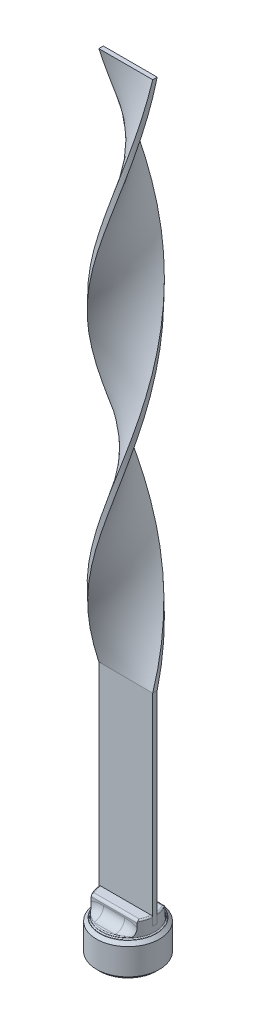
ISO-10303-21;
HEADER;
FILE_DESCRIPTION(('STEP AP214'),'2;1');
FILE_NAME('part.step','',(''),(''),'','','');
FILE_SCHEMA(('AUTOMOTIVE_DESIGN { 1 0 10303 214 1 1 1 1 }'));
ENDSEC;
DATA;
#1=APPLICATION_CONTEXT('core data for automotive mechanical design processes');
#2=APPLICATION_PROTOCOL_DEFINITION('international standard','automotive_design',2000,#1);
#3=PRODUCT_CONTEXT('',#1,'mechanical');
#4=PRODUCT('Part','Part','',(#3));
#5=PRODUCT_RELATED_PRODUCT_CATEGORY('part','',(#4));
#6=PRODUCT_DEFINITION_FORMATION('','',#4);
#7=PRODUCT_DEFINITION_CONTEXT('part definition',#1,'design');
#8=PRODUCT_DEFINITION('design','',#6,#7);
#9=PRODUCT_DEFINITION_SHAPE('','',#8);
#10=(LENGTH_UNIT() NAMED_UNIT(*) SI_UNIT(.MILLI.,.METRE.));
#11=(NAMED_UNIT(*) PLANE_ANGLE_UNIT() SI_UNIT($,.RADIAN.));
#12=(NAMED_UNIT(*) SI_UNIT($,.STERADIAN.) SOLID_ANGLE_UNIT());
#13=UNCERTAINTY_MEASURE_WITH_UNIT(LENGTH_MEASURE(1.E-05),#10,'distance_accuracy_value','');
#14=(GEOMETRIC_REPRESENTATION_CONTEXT(3) GLOBAL_UNCERTAINTY_ASSIGNED_CONTEXT((#13)) GLOBAL_UNIT_ASSIGNED_CONTEXT((#10,
#11,#12)) REPRESENTATION_CONTEXT('',''));
#15=CARTESIAN_POINT('',(0.,0.,0.));
#16=DIRECTION('',(0.,0.,1.));
#17=DIRECTION('',(1.,0.,0.));
#18=AXIS2_PLACEMENT_3D('',#15,#16,#17);
#19=CARTESIAN_POINT('',(0.,16.256,0.));
#20=DIRECTION('',(0.,-1.,0.));
#21=DIRECTION('',(0.,0.,-1.));
#22=AXIS2_PLACEMENT_3D('',#19,#20,#21);
#23=PLANE('',#22);
#24=DIRECTION('',(0.866025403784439,0.,0.5));
#25=VECTOR('',#24,1.);
#26=CARTESIAN_POINT('',(-7.9248,16.256,4.57538541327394));
#27=LINE('',#26,#25);
#28=CARTESIAN_POINT('',(0.,16.256,9.1507708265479));
#29=VERTEX_POINT('',#28);
#30=CARTESIAN_POINT('',(-7.9248,16.256,4.57538541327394));
#31=VERTEX_POINT('',#30);
#32=EDGE_CURVE('E519',#29,#31,#27,.F.);
#33=ORIENTED_EDGE('',*,*,#32,.T.);
#34=DIRECTION('',(0.,0.,1.));
#35=VECTOR('',#34,1.);
#36=CARTESIAN_POINT('',(-7.9248,16.256,-4.57538541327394));
#37=LINE('',#36,#35);
#38=CARTESIAN_POINT('',(-7.92480001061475,16.256,-4.57538540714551));
#39=VERTEX_POINT('',#38);
#40=EDGE_CURVE('E249',#31,#39,#37,.F.);
#41=ORIENTED_EDGE('',*,*,#40,.T.);
#42=DIRECTION('',(-0.866025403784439,0.,0.5));
#43=VECTOR('',#42,1.);
#44=CARTESIAN_POINT('',(0.,16.256,-9.15077082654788));
#45=LINE('',#44,#43);
#46=CARTESIAN_POINT('',(3.06196110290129E-09,16.256,-9.15077082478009));
#47=VERTEX_POINT('',#46);
#48=EDGE_CURVE('E248',#39,#47,#45,.F.);
#49=ORIENTED_EDGE('',*,*,#48,.T.);
#50=DIRECTION('',(-0.866025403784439,0.,-0.5));
#51=VECTOR('',#50,1.);
#52=CARTESIAN_POINT('',(7.9248,16.256,-4.57538541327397));
#53=LINE('',#52,#51);
#54=CARTESIAN_POINT('',(7.9248,16.256,-4.57538540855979));
#55=VERTEX_POINT('',#54);
#56=EDGE_CURVE('E516',#47,#55,#53,.F.);
#57=ORIENTED_EDGE('',*,*,#56,.T.);
#58=DIRECTION('',(0.,0.,-1.));
#59=VECTOR('',#58,1.);
#60=CARTESIAN_POINT('',(7.9248,16.256,4.57538541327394));
#61=LINE('',#60,#59);
#62=CARTESIAN_POINT('',(7.92480001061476,16.256,4.57538540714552));
#63=VERTEX_POINT('',#62);
#64=EDGE_CURVE('E512',#55,#63,#61,.F.);
#65=ORIENTED_EDGE('',*,*,#64,.T.);
#66=DIRECTION('',(0.866025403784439,0.,-0.5));
#67=VECTOR('',#66,1.);
#68=CARTESIAN_POINT('',(0.,16.256,9.15077082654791));
#69=LINE('',#68,#67);
#70=EDGE_CURVE('E508',#63,#29,#69,.F.);
#71=ORIENTED_EDGE('',*,*,#70,.T.);
#72=EDGE_LOOP('',(#33,#41,#49,#57,#65,#71));
#73=FACE_BOUND('',#72,.T.);
#74=ADVANCED_FACE('F15',(#73),#23,.T.);
#75=CARTESIAN_POINT('',(-7.9248,0.,-4.57538541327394));
#76=DIRECTION('',(-1.,0.,0.));
#77=DIRECTION('',(0.,0.,1.));
#78=AXIS2_PLACEMENT_3D('',#75,#76,#77);
#79=PLANE('',#78);
#80=ORIENTED_EDGE('',*,*,#40,.F.);
#81=DIRECTION('',(0.,1.,0.));
#82=VECTOR('',#81,1.);
#83=CARTESIAN_POINT('',(-7.9248,0.,4.57538541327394));
#84=LINE('',#83,#82);
#85=CARTESIAN_POINT('',(-7.92479999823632,0.272629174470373,4.5753854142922));
#86=VERTEX_POINT('',#85);
#87=EDGE_CURVE('E229',#31,#86,#84,.F.);
#88=ORIENTED_EDGE('',*,*,#87,.T.);
#89=CARTESIAN_POINT('',(-7.92479999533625,0.272629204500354,4.57538534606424));
#90=CARTESIAN_POINT('',(-7.92479999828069,0.351283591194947,4.41805296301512));
#91=CARTESIAN_POINT('',(-7.92479999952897,0.427524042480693,4.25951129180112));
#92=CARTESIAN_POINT('',(-7.92480000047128,0.574442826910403,3.93977217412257));
#93=CARTESIAN_POINT('',(-7.92480000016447,0.645118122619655,3.77857333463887));
#94=CARTESIAN_POINT('',(-7.92479999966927,0.848297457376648,3.28913802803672));
#95=CARTESIAN_POINT('',(-7.92479999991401,0.971088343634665,2.95675852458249));
#96=CARTESIAN_POINT('',(-7.92480000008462,1.18135858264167,2.28648889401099));
#97=CARTESIAN_POINT('',(-7.92480000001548,1.26936761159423,1.94877003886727));
#98=CARTESIAN_POINT('',(-7.92479999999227,1.37117191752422,1.43664022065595));
#99=CARTESIAN_POINT('',(-7.9247999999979,1.4000582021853,1.26517636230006));
#100=CARTESIAN_POINT('',(-7.92480000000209,1.44710743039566,0.9207970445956));
#101=CARTESIAN_POINT('',(-7.92480000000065,1.46527197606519,0.747881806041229));
#102=CARTESIAN_POINT('',(-7.92479999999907,1.49572824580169,0.326496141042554));
#103=CARTESIAN_POINT('',(-7.92479999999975,1.5021176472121,0.0775716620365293));
#104=CARTESIAN_POINT('',(-7.92480000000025,1.49138743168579,-0.41982848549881));
#105=CARTESIAN_POINT('',(-7.92480000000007,1.47425957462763,-0.668303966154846));
#106=CARTESIAN_POINT('',(-7.92479999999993,1.41750446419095,-1.16291216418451));
#107=CARTESIAN_POINT('',(-7.92479999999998,1.37785205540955,-1.40904194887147));
#108=CARTESIAN_POINT('',(-7.92480000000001,1.27820356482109,-1.89707108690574));
#109=CARTESIAN_POINT('',(-7.9248,1.21820904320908,-2.1389707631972));
#110=CARTESIAN_POINT('',(-7.9248,1.09479084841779,-2.56835659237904));
#111=CARTESIAN_POINT('',(-7.9248,1.03461488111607,-2.75679411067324));
#112=CARTESIAN_POINT('',(-7.9248,0.904567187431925,-3.13028699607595));
#113=CARTESIAN_POINT('',(-7.9248,0.834695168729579,-3.31534226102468));
#114=CARTESIAN_POINT('',(-7.9248,0.686821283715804,-3.6814877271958));
#115=CARTESIAN_POINT('',(-7.9248,0.60884498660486,-3.86258834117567));
#116=CARTESIAN_POINT('',(-7.9248,0.445785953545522,-4.22143663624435));
#117=CARTESIAN_POINT('',(-7.9248,0.360707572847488,-4.39918629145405));
#118=CARTESIAN_POINT('',(-7.9248,0.27262922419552,-4.57538531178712));
#119=B_SPLINE_CURVE_WITH_KNOTS('',3,(#89,#90,#91,#92,#93,#94,#95,#96,#97,#98,#99,#100,#101,#102,
#103,#104,#105,#106,#107,#108,#109,#110,#111,#112,#113,#114,#115,#116,#117,#118),.UNSPECIFIED.,
.F.,.F.,(4,2,2,2,2,2,2,2,2,2,2,2,2,2,4),(0.,0.527662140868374,1.05561030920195,2.11720536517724,
3.16194588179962,3.68329175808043,4.20455971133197,4.95041842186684,5.69653853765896,
6.44349356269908,7.19039131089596,7.78355094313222,8.3767284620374,8.96808825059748,
9.55908802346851),.UNSPECIFIED.);
#120=CARTESIAN_POINT('',(-7.92480000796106,0.272629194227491,-4.57538535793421));
#121=VERTEX_POINT('',#120);
#122=EDGE_CURVE('E233',#86,#121,#119,.T.);
#123=ORIENTED_EDGE('',*,*,#122,.T.);
#124=DIRECTION('',(0.,1.,0.));
#125=VECTOR('',#124,1.);
#126=CARTESIAN_POINT('',(-7.92480001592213,0.,-4.57538540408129));
#127=LINE('',#126,#125);
#128=EDGE_CURVE('E236',#121,#39,#127,.T.);
#129=ORIENTED_EDGE('',*,*,#128,.T.);
#130=EDGE_LOOP('',(#80,#88,#123,#129));
#131=FACE_BOUND('',#130,.T.);
#132=ADVANCED_FACE('F235',(#131),#79,.F.);
#133=CARTESIAN_POINT('',(0.,0.,-9.15077082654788));
#134=DIRECTION('',(-0.5,0.,-0.866025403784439));
#135=DIRECTION('',(-0.866025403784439,0.,0.5));
#136=AXIS2_PLACEMENT_3D('',#133,#134,#135);
#137=PLANE('',#136);
#138=ORIENTED_EDGE('',*,*,#48,.F.);
#139=ORIENTED_EDGE('',*,*,#128,.F.);
#140=CARTESIAN_POINT('',(-7.92480000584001,0.272629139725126,-4.57538536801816));
#141=CARTESIAN_POINT('',(-7.78854617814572,0.351283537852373,-4.65405157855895));
#142=CARTESIAN_POINT('',(-7.65124506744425,0.4275239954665,-4.73332242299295));
#143=CARTESIAN_POINT('',(-7.37434286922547,0.574442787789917,-4.89319199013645));
#144=CARTESIAN_POINT('',(-7.23474057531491,0.645118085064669,-4.97379140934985));
#145=CARTESIAN_POINT('',(-6.81087715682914,0.848297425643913,-5.21850906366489));
#146=CARTESIAN_POINT('',(-6.52302805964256,0.971088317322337,-5.38469881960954));
#147=CARTESIAN_POINT('',(-5.94255752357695,1.18135856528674,-5.71983364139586));
#148=CARTESIAN_POINT('',(-5.65008441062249,1.26936759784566,-5.88869307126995));
#149=CARTESIAN_POINT('',(-5.20656697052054,1.37117190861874,-6.14475798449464));
#150=CARTESIAN_POINT('',(-5.05807491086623,1.40005819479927,-6.23048991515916));
#151=CARTESIAN_POINT('',(-4.75983366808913,1.4471074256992,-6.40267957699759));
#152=CARTESIAN_POINT('',(-4.6100846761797,1.46527197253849,-6.48913719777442));
#153=CARTESIAN_POINT('',(-4.2451539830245,1.49572824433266,-6.69983003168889));
#154=CARTESIAN_POINT('',(-4.02957906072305,1.5021176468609,-6.8242922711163));
#155=CARTESIAN_POINT('',(-3.59881789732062,1.49138743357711,-7.07299234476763));
#156=CARTESIAN_POINT('',(-3.38363181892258,1.47425957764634,-7.19723008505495));
#157=CARTESIAN_POINT('',(-2.95528855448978,1.41750446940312,-7.44453418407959));
#158=CARTESIAN_POINT('',(-2.74213390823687,1.37785206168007,-7.56759907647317));
#159=CARTESIAN_POINT('',(-2.31948827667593,1.27820357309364,-7.81161364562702));
#160=CARTESIAN_POINT('',(-2.10999701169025,1.21820905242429,-7.93256348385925));
#161=CARTESIAN_POINT('',(-1.73813796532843,1.0947908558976,-8.14725640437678));
#162=CARTESIAN_POINT('',(-1.57494627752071,1.03461488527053,-8.2414751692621));
#163=CARTESIAN_POINT('',(-1.25149193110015,0.904567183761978,-8.42822162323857));
#164=CARTESIAN_POINT('',(-1.09122936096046,0.834695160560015,-8.52074926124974));
#165=CARTESIAN_POINT('',(-0.774138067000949,0.68682126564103,-8.70382200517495));
#166=CARTESIAN_POINT('',(-0.617300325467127,0.608844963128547,-8.79437231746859));
#167=CARTESIAN_POINT('',(-0.306528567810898,0.445785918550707,-8.97379647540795));
#168=CARTESIAN_POINT('',(-0.152592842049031,0.360707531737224,-9.06267130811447));
#169=CARTESIAN_POINT('',(-5.62836076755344E-09,0.272629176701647,-9.15077082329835));
#170=B_SPLINE_CURVE_WITH_KNOTS('',3,(#140,#141,#142,#143,#144,#145,#146,#147,#148,#149,#150,
#151,#152,#153,#154,#155,#156,#157,#158,#159,#160,#161,#162,#163,#164,#165,#166,#167,#168,#169),
.UNSPECIFIED.,.F.,.F.,(4,2,2,2,2,2,2,2,2,2,2,2,2,2,4),(0.,0.52766215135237,1.05561032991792,
2.11720540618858,3.16194594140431,3.68329182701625,4.204559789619,4.95041849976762,
5.69653861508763,6.44349363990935,7.19039138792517,7.78355105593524,8.37672861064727,
8.96808843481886,9.55908824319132),.UNSPECIFIED.);
#171=CARTESIAN_POINT('',(-4.59281121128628E-10,0.272629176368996,-9.150770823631));
#172=VERTEX_POINT('',#171);
#173=EDGE_CURVE('E241',#121,#172,#170,.T.);
#174=ORIENTED_EDGE('',*,*,#173,.T.);
#175=DIRECTION('',(0.,1.,0.));
#176=VECTOR('',#175,1.);
#177=CARTESIAN_POINT('',(4.59293540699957E-09,0.,-9.15077082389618));
#178=LINE('',#177,#176);
#179=EDGE_CURVE('E517',#172,#47,#178,.T.);
#180=ORIENTED_EDGE('',*,*,#179,.T.);
#181=EDGE_LOOP('',(#138,#139,#174,#180));
#182=FACE_BOUND('',#181,.T.);
#183=ADVANCED_FACE('F245',(#182),#137,.F.);
#184=CARTESIAN_POINT('',(-7.9248,0.,4.57538541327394));
#185=DIRECTION('',(-0.5,0.,0.866025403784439));
#186=DIRECTION('',(0.866025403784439,0.,0.5));
#187=AXIS2_PLACEMENT_3D('',#184,#185,#186);
#188=PLANE('',#187);
#189=ORIENTED_EDGE('',*,*,#32,.F.);
#190=DIRECTION('',(0.,1.,0.));
#191=VECTOR('',#190,1.);
#192=CARTESIAN_POINT('',(0.,0.,9.1507708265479));
#193=LINE('',#192,#191);
#194=CARTESIAN_POINT('',(1.5922146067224E-08,0.272629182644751,9.15077081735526));
#195=VERTEX_POINT('',#194);
#196=EDGE_CURVE('E242',#29,#195,#193,.F.);
#197=ORIENTED_EDGE('',*,*,#196,.T.);
#198=CARTESIAN_POINT('',(9.97951211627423E-09,0.272629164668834,9.15077081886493));
#199=CARTESIAN_POINT('',(-0.136253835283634,0.351283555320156,9.07210463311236));
#200=CARTESIAN_POINT('',(-0.27355495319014,0.427524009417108,8.99283379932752));
#201=CARTESIAN_POINT('',(-0.550457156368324,0.574442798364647,8.83296424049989));
#202=CARTESIAN_POINT('',(-0.690059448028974,0.645118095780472,8.75236481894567));
#203=CARTESIAN_POINT('',(-1.11392286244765,0.848297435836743,8.50764716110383));
#204=CARTESIAN_POINT('',(-1.40177196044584,0.971088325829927,8.34145740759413));
#205=CARTESIAN_POINT('',(-1.98224249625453,1.18135857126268,8.00632258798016));
#206=CARTESIAN_POINT('',(-2.27471560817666,1.2693676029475,7.83746315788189));
#207=CARTESIAN_POINT('',(-2.7182330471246,1.37117191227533,7.58139824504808));
#208=CARTESIAN_POINT('',(-2.86672510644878,1.40005819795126,7.49566631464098));
#209=CARTESIAN_POINT('',(-3.16496634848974,1.44710742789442,7.32347665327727));
#210=CARTESIAN_POINT('',(-3.31471533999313,1.46527197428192,7.23701903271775));
#211=CARTESIAN_POINT('',(-3.67964603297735,1.49572824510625,7.02632619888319));
#212=CARTESIAN_POINT('',(-3.89522095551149,1.50211764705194,6.90186395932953));
#213=CARTESIAN_POINT('',(-4.32598211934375,1.49138743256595,6.65316388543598));
#214=CARTESIAN_POINT('',(-4.54116819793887,1.47425957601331,6.52892614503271));
#215=CARTESIAN_POINT('',(-4.96951146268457,1.41750446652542,6.28162204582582));
#216=CARTESIAN_POINT('',(-5.18266610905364,1.37785205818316,6.15855715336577));
#217=CARTESIAN_POINT('',(-5.60531174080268,1.27820356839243,5.91454258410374));
#218=CARTESIAN_POINT('',(-5.81480300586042,1.21820904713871,5.79359274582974));
#219=CARTESIAN_POINT('',(-6.18666205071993,1.09479085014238,5.57889982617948));
#220=CARTESIAN_POINT('',(-6.34985373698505,1.03461487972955,5.48468106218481));
#221=CARTESIAN_POINT('',(-6.67330808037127,0.904567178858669,5.29793460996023));
#222=CARTESIAN_POINT('',(-6.83357064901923,0.834695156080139,5.20540697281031));
#223=CARTESIAN_POINT('',(-7.15066194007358,0.686821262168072,5.02233423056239));
#224=CARTESIAN_POINT('',(-7.30749968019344,0.608844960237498,4.9317839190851));
#225=CARTESIAN_POINT('',(-7.61827143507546,0.445785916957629,4.75235976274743));
#226=CARTESIAN_POINT('',(-7.77220715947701,0.360707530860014,4.66348493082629));
#227=CARTESIAN_POINT('',(-7.92479999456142,0.272629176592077,4.5753854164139));
#228=B_SPLINE_CURVE_WITH_KNOTS('',3,(#198,#199,#200,#201,#202,#203,#204,#205,#206,#207,#208,
#209,#210,#211,#212,#213,#214,#215,#216,#217,#218,#219,#220,#221,#222,#223,#224,#225,#226,#227),
.UNSPECIFIED.,.F.,.F.,(4,2,2,2,2,2,2,2,2,2,2,2,2,2,4),(0.,0.527662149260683,1.05561032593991,
2.1172053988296,3.16194593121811,3.68329181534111,4.20455977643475,4.95041848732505,
5.69653860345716,6.44349362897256,7.19039137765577,7.78355104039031,8.37672858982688,
8.96808840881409,9.55908821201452),.UNSPECIFIED.);
#229=EDGE_CURVE('E256',#195,#86,#228,.T.);
#230=ORIENTED_EDGE('',*,*,#229,.T.);
#231=ORIENTED_EDGE('',*,*,#87,.F.);
#232=EDGE_LOOP('',(#189,#197,#230,#231));
#233=FACE_BOUND('',#232,.T.);
#234=ADVANCED_FACE('F1498',(#233),#188,.F.);
#235=CARTESIAN_POINT('',(7.9248,0.,-4.57538541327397));
#236=DIRECTION('',(0.5,0.,-0.866025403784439));
#237=DIRECTION('',(-0.866025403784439,0.,-0.5));
#238=AXIS2_PLACEMENT_3D('',#235,#236,#237);
#239=PLANE('',#238);
#240=ORIENTED_EDGE('',*,*,#56,.F.);
#241=ORIENTED_EDGE('',*,*,#179,.F.);
#242=CARTESIAN_POINT('',(6.03537479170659E-09,0.272629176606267,-9.15077082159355));
#243=CARTESIAN_POINT('',(0.136253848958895,0.351283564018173,-9.07210462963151));
#244=CARTESIAN_POINT('',(0.273554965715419,0.427524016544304,-8.99283379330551));
#245=CARTESIAN_POINT('',(0.550457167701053,0.574442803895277,-8.83296423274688));
#246=CARTESIAN_POINT('',(0.690059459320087,0.64511810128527,-8.75236481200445));
#247=CARTESIAN_POINT('',(1.11392287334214,0.848297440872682,-8.50764715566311));
#248=CARTESIAN_POINT('',(1.40177197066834,0.971088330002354,-8.34145740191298));
#249=CARTESIAN_POINT('',(1.9822425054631,1.18135857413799,-8.00632258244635));
#250=CARTESIAN_POINT('',(2.27471561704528,1.26936760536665,-7.83746315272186));
#251=CARTESIAN_POINT('',(2.71823305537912,1.37117191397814,-7.5813982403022));
#252=CARTESIAN_POINT('',(2.86672511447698,1.40005819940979,-7.49566631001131));
#253=CARTESIAN_POINT('',(3.16496635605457,1.44710742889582,-7.32347664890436));
#254=CARTESIAN_POINT('',(3.31471534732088,1.46527197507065,-7.23701902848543));
#255=CARTESIAN_POINT('',(3.67964604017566,1.49572824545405,-7.02632619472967));
#256=CARTESIAN_POINT('',(3.89522096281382,1.50211764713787,-6.90186395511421));
#257=CARTESIAN_POINT('',(4.32598212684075,1.49138743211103,-6.65316388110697));
#258=CARTESIAN_POINT('',(4.54116820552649,1.47425957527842,-6.52892614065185));
#259=CARTESIAN_POINT('',(4.96951147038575,1.41750446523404,-6.28162204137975));
#260=CARTESIAN_POINT('',(5.18266611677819,1.37785205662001,-6.15855714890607));
#261=CARTESIAN_POINT('',(5.60531174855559,1.27820356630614,-5.91454257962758));
#262=CARTESIAN_POINT('',(5.81480301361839,1.21820904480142,-5.7935927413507));
#263=CARTESIAN_POINT('',(6.18666205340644,1.09479084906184,-5.57889982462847));
#264=CARTESIAN_POINT('',(6.34985373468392,1.03461488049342,-5.48468106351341));
#265=CARTESIAN_POINT('',(6.67330806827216,0.904567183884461,-5.29793461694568));
#266=CARTESIAN_POINT('',(6.8335706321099,0.834695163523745,-5.20540698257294));
#267=CARTESIAN_POINT('',(7.15066191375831,0.686821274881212,-5.02233424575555));
#268=CARTESIAN_POINT('',(7.30749964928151,0.608844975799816,-4.93178393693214));
#269=CARTESIAN_POINT('',(7.61827139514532,0.445785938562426,-4.75235978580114));
#270=CARTESIAN_POINT('',(7.77220711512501,0.360707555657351,-4.66348495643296));
#271=CARTESIAN_POINT('',(7.92479994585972,0.272629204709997,-4.57538544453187));
#272=B_SPLINE_CURVE_WITH_KNOTS('',3,(#242,#243,#244,#245,#246,#247,#248,#249,#250,#251,#252,
#253,#254,#255,#256,#257,#258,#259,#260,#261,#262,#263,#264,#265,#266,#267,#268,#269,#270,#271),
.UNSPECIFIED.,.F.,.F.,(4,2,2,2,2,2,2,2,2,2,2,2,2,2,4),(0.,0.527662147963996,1.05561032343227,
2.11720539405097,3.16194592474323,3.68329180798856,4.20455976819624,4.95041847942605,
5.69653859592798,6.443493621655,7.19039137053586,7.78355101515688,8.37672854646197,
8.96808834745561,9.55908813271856),.UNSPECIFIED.);
#273=CARTESIAN_POINT('',(7.9247999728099,0.272629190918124,-4.57538542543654));
#274=VERTEX_POINT('',#273);
#275=EDGE_CURVE('E255',#172,#274,#272,.T.);
#276=ORIENTED_EDGE('',*,*,#275,.T.);
#277=DIRECTION('',(0.,1.,0.));
#278=VECTOR('',#277,1.);
#279=CARTESIAN_POINT('',(7.9248,0.,-4.5753854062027));
#280=LINE('',#279,#278);
#281=EDGE_CURVE('E513',#274,#55,#280,.T.);
#282=ORIENTED_EDGE('',*,*,#281,.T.);
#283=EDGE_LOOP('',(#240,#241,#276,#282));
#284=FACE_BOUND('',#283,.T.);
#285=ADVANCED_FACE('F1490',(#284),#239,.F.);
#286=CARTESIAN_POINT('',(7.9248,0.,4.57538541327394));
#287=DIRECTION('',(1.,0.,0.));
#288=DIRECTION('',(0.,0.,-1.));
#289=AXIS2_PLACEMENT_3D('',#286,#287,#288);
#290=PLANE('',#289);
#291=ORIENTED_EDGE('',*,*,#64,.F.);
#292=ORIENTED_EDGE('',*,*,#281,.F.);
#293=CARTESIAN_POINT('',(7.9248,0.272629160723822,-4.57538543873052));
#294=CARTESIAN_POINT('',(7.9248,0.351283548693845,-4.4180530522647));
#295=CARTESIAN_POINT('',(7.9248,0.427524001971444,-4.25951137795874));
#296=CARTESIAN_POINT('',(7.9248,0.57444279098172,-3.93977225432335));
#297=CARTESIAN_POINT('',(7.9248,0.645118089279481,-3.77857341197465));
#298=CARTESIAN_POINT('',(7.9248,0.848297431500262,-3.28913809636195));
#299=CARTESIAN_POINT('',(7.9248,0.97108832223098,-2.95675858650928));
#300=CARTESIAN_POINT('',(7.9248,1.18135856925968,-2.28648894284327));
#301=CARTESIAN_POINT('',(7.9248,1.26936760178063,-1.94877008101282));
#302=CARTESIAN_POINT('',(7.9248,1.37117191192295,-1.43664025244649));
#303=CARTESIAN_POINT('',(7.9248,1.40005819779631,-1.26517639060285));
#304=CARTESIAN_POINT('',(7.9248,1.44710742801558,-0.920797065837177));
#305=CARTESIAN_POINT('',(7.9248,1.46527197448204,-0.747881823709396));
#306=CARTESIAN_POINT('',(7.9248,1.49572824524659,-0.326496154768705));
#307=CARTESIAN_POINT('',(7.9248,1.50211764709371,-0.0775716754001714));
#308=CARTESIAN_POINT('',(7.9248,1.49138743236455,0.419828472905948));
#309=CARTESIAN_POINT('',(7.9248,1.4742595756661,0.668303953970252));
#310=CARTESIAN_POINT('',(7.9248,1.41750446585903,1.16291215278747));
#311=CARTESIAN_POINT('',(7.9248,1.37785205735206,1.40904193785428));
#312=CARTESIAN_POINT('',(7.9248,1.27820356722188,1.89707107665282));
#313=CARTESIAN_POINT('',(7.9248,1.21820904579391,2.13897075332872));
#314=CARTESIAN_POINT('',(7.9248,1.09479085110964,2.56835658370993));
#315=CARTESIAN_POINT('',(7.9248,1.03461488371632,2.75679410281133));
#316=CARTESIAN_POINT('',(7.9248,0.904567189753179,3.13028698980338));
#317=CARTESIAN_POINT('',(7.9248,0.834695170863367,3.31534225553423));
#318=CARTESIAN_POINT('',(7.9248,0.686821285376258,3.68148772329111));
#319=CARTESIAN_POINT('',(7.9248,0.608844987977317,3.86258833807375));
#320=CARTESIAN_POINT('',(7.9248,0.445785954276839,4.22143663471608));
#321=CARTESIAN_POINT('',(7.9248,0.36070757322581,4.39918629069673));
#322=CARTESIAN_POINT('',(7.9248,0.272629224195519,4.57538531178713));
#323=B_SPLINE_CURVE_WITH_KNOTS('',3,(#293,#294,#295,#296,#297,#298,#299,#300,#301,#302,#303,
#304,#305,#306,#307,#308,#309,#310,#311,#312,#313,#314,#315,#316,#317,#318,#319,#320,#321,#322),
.UNSPECIFIED.,.F.,.F.,(4,2,2,2,2,2,2,2,2,2,2,2,2,2,4),(0.,0.527662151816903,1.05561033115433,
2.1172054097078,3.16194594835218,3.68329183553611,4.2045597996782,4.95041851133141,
5.69653862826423,6.44349365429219,7.19039140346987,7.78355103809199,8.37672855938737,
8.96808835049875,9.55908812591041),.UNSPECIFIED.);
#324=CARTESIAN_POINT('',(7.92480000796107,0.272629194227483,4.57538535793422));
#325=VERTEX_POINT('',#324);
#326=EDGE_CURVE('E290',#274,#325,#323,.T.);
#327=ORIENTED_EDGE('',*,*,#326,.T.);
#328=DIRECTION('',(0.,1.,0.));
#329=VECTOR('',#328,1.);
#330=CARTESIAN_POINT('',(7.92480001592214,0.,4.57538540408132));
#331=LINE('',#330,#329);
#332=EDGE_CURVE('E509',#325,#63,#331,.T.);
#333=ORIENTED_EDGE('',*,*,#332,.T.);
#334=EDGE_LOOP('',(#291,#292,#327,#333));
#335=FACE_BOUND('',#334,.T.);
#336=ADVANCED_FACE('F1485',(#335),#290,.F.);
#337=CARTESIAN_POINT('',(0.,0.,9.15077082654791));
#338=DIRECTION('',(0.5,0.,0.866025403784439));
#339=DIRECTION('',(0.866025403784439,0.,-0.5));
#340=AXIS2_PLACEMENT_3D('',#337,#338,#339);
#341=PLANE('',#340);
#342=ORIENTED_EDGE('',*,*,#70,.F.);
#343=ORIENTED_EDGE('',*,*,#332,.F.);
#344=CARTESIAN_POINT('',(7.92480000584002,0.272629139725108,4.57538536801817));
#345=CARTESIAN_POINT('',(7.78854617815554,0.3512835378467,4.65405157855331));
#346=CARTESIAN_POINT('',(7.65124506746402,0.427523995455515,4.73332242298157));
#347=CARTESIAN_POINT('',(7.3743428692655,0.574442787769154,4.89319199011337));
#348=CARTESIAN_POINT('',(7.23474057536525,0.645118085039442,4.97379140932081));
#349=CARTESIAN_POINT('',(6.81087715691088,0.848297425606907,5.21850906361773));
#350=CARTESIAN_POINT('',(6.52302805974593,0.971088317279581,5.38469881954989));
#351=CARTESIAN_POINT('',(5.9425575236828,1.18135856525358,5.71983364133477));
#352=CARTESIAN_POINT('',(5.65008441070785,1.26936759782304,5.8886930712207));
#353=CARTESIAN_POINT('',(5.20656697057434,1.37117190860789,6.1447579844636));
#354=CARTESIAN_POINT('',(5.05807491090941,1.40005819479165,6.23048991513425));
#355=CARTESIAN_POINT('',(4.75983366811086,1.44710742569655,6.40267957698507));
#356=CARTESIAN_POINT('',(4.61008467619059,1.46527197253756,6.48913719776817));
#357=CARTESIAN_POINT('',(4.24515398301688,1.49572824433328,6.69983003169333));
#358=CARTESIAN_POINT('',(4.02957906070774,1.50211764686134,6.82429227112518));
#359=CARTESIAN_POINT('',(3.59881789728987,1.49138743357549,7.07299234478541));
#360=CARTESIAN_POINT('',(3.38363181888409,1.47425957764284,7.1972300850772));
#361=CARTESIAN_POINT('',(2.9552885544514,1.4175044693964,7.44453418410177));
#362=CARTESIAN_POINT('',(2.74213390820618,1.3778520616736,7.56759907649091));
#363=CARTESIAN_POINT('',(2.31948827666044,1.27820357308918,7.81161364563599));
#364=CARTESIAN_POINT('',(2.10999701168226,1.21820905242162,7.93256348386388));
#365=CARTESIAN_POINT('',(1.73813796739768,1.09479085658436,8.14725640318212));
#366=CARTESIAN_POINT('',(1.57494628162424,1.03461488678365,8.24147516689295));
#367=CARTESIAN_POINT('',(1.25149193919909,0.904567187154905,8.42822161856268));
#368=CARTESIAN_POINT('',(1.09122937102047,0.834695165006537,8.52074925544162));
#369=CARTESIAN_POINT('',(0.774138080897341,0.686821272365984,8.70382199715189));
#370=CARTESIAN_POINT('',(0.617300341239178,0.608844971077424,8.79437230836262));
#371=CARTESIAN_POINT('',(0.306528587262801,0.445785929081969,8.97379646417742));
#372=CARTESIAN_POINT('',(0.152592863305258,0.360707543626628,9.06267129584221));
#373=CARTESIAN_POINT('',(2.86598519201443E-08,0.272629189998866,9.15077081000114));
#374=B_SPLINE_CURVE_WITH_KNOTS('',3,(#344,#345,#346,#347,#348,#349,#350,#351,#352,#353,#354,
#355,#356,#357,#358,#359,#360,#361,#362,#363,#364,#365,#366,#367,#368,#369,#370,#371,#372,#373),
.UNSPECIFIED.,.F.,.F.,(4,2,2,2,2,2,2,2,2,2,2,2,2,2,4),(0.,0.52766215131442,1.05561032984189,
2.11720540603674,3.16194594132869,3.68329182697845,4.20455978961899,4.95041849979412,
5.69653861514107,6.44349363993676,7.19039138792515,7.78355104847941,8.37672859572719,
8.96808841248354,9.55908821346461),.UNSPECIFIED.);
#375=EDGE_CURVE('E299',#325,#195,#374,.T.);
#376=ORIENTED_EDGE('',*,*,#375,.T.);
#377=ORIENTED_EDGE('',*,*,#196,.F.);
#378=EDGE_LOOP('',(#342,#343,#376,#377));
#379=FACE_BOUND('',#378,.T.);
#380=ADVANCED_FACE('F283',(#379),#341,.F.);
#381=CARTESIAN_POINT('',(0.,0.,0.));
#382=DIRECTION('',(0.,-1.,0.));
#383=DIRECTION('',(0.,0.,-1.));
#384=AXIS2_PLACEMENT_3D('',#381,#382,#383);
#385=CONICAL_SURFACE('',#384,9.4234,0.78539816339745);
#386=ORIENTED_EDGE('',*,*,#275,.F.);
#387=ORIENTED_EDGE('',*,*,#173,.F.);
#388=ORIENTED_EDGE('',*,*,#122,.F.);
#389=ORIENTED_EDGE('',*,*,#229,.F.);
#390=ORIENTED_EDGE('',*,*,#375,.F.);
#391=ORIENTED_EDGE('',*,*,#326,.F.);
#392=EDGE_LOOP('',(#386,#387,#388,#389,#390,#391));
#393=FACE_BOUND('',#392,.T.);
#394=CARTESIAN_POINT('',(0.,0.,0.));
#395=DIRECTION('',(0.,-1.,0.));
#396=DIRECTION('',(0.,0.,-1.));
#397=AXIS2_PLACEMENT_3D('',#394,#395,#396);
#398=CIRCLE('',#397,9.4234);
#399=CARTESIAN_POINT('',(0.,0.,-9.4234));
#400=VERTEX_POINT('',#399);
#401=EDGE_CURVE('E306',#400,#400,#398,.F.);
#402=ORIENTED_EDGE('',*,*,#401,.F.);
#403=EDGE_LOOP('',(#402));
#404=FACE_BOUND('',#403,.T.);
#405=ADVANCED_FACE('F252',(#393,#404),#385,.F.);
#406=CARTESIAN_POINT('',(0.,0.,-7.8994));
#407=DIRECTION('',(0.,-1.,0.));
#408=DIRECTION('',(0.,0.,-1.));
#409=AXIS2_PLACEMENT_3D('',#406,#407,#408);
#410=PLANE('',#409);
#411=CARTESIAN_POINT('',(0.,0.,0.));
#412=DIRECTION('',(0.,1.,0.));
#413=DIRECTION('',(0.,0.,1.));
#414=AXIS2_PLACEMENT_3D('',#411,#412,#413);
#415=CIRCLE('',#414,14.859);
#416=CARTESIAN_POINT('',(0.,0.,14.859));
#417=VERTEX_POINT('',#416);
#418=EDGE_CURVE('E309',#417,#417,#415,.T.);
#419=ORIENTED_EDGE('',*,*,#418,.F.);
#420=EDGE_LOOP('',(#419));
#421=FACE_BOUND('',#420,.T.);
#422=ORIENTED_EDGE('',*,*,#401,.T.);
#423=EDGE_LOOP('',(#422));
#424=FACE_BOUND('',#423,.T.);
#425=ADVANCED_FACE('F282',(#421,#424),#410,.T.);
#426=CARTESIAN_POINT('',(0.,1.6755,0.));
#427=DIRECTION('',(0.,1.,0.));
#428=DIRECTION('',(0.,0.,1.));
#429=AXIS2_PLACEMENT_3D('',#426,#427,#428);
#430=CONICAL_SURFACE('',#429,16.5345,0.785398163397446);
#431=CARTESIAN_POINT('',(0.,1.6755,0.));
#432=DIRECTION('',(0.,-1.,0.));
#433=DIRECTION('',(0.,0.,-1.));
#434=AXIS2_PLACEMENT_3D('',#431,#432,#433);
#435=CIRCLE('',#434,16.5345);
#436=CARTESIAN_POINT('',(0.,1.6755,-16.5345));
#437=VERTEX_POINT('',#436);
#438=EDGE_CURVE('E312',#437,#437,#435,.F.);
#439=ORIENTED_EDGE('',*,*,#438,.F.);
#440=EDGE_LOOP('',(#439));
#441=FACE_BOUND('',#440,.T.);
#442=ORIENTED_EDGE('',*,*,#418,.T.);
#443=EDGE_LOOP('',(#442));
#444=FACE_BOUND('',#443,.T.);
#445=ADVANCED_FACE('F1260',(#441,#444),#430,.T.);
#446=CARTESIAN_POINT('',(0.,8.5725,0.));
#447=DIRECTION('',(0.,-1.,0.));
#448=DIRECTION('',(0.,0.,-1.));
#449=AXIS2_PLACEMENT_3D('',#446,#447,#448);
#450=CYLINDRICAL_SURFACE('',#449,16.5345);
#451=ORIENTED_EDGE('',*,*,#438,.T.);
#452=EDGE_LOOP('',(#451));
#453=FACE_BOUND('',#452,.T.);
#454=CARTESIAN_POINT('',(0.,15.4695,0.));
#455=DIRECTION('',(0.,-1.,0.));
#456=DIRECTION('',(0.,0.,-1.));
#457=AXIS2_PLACEMENT_3D('',#454,#455,#456);
#458=CIRCLE('',#457,16.5345);
#459=CARTESIAN_POINT('',(0.,15.4695,-16.5345));
#460=VERTEX_POINT('',#459);
#461=EDGE_CURVE('E317',#460,#460,#458,.F.);
#462=ORIENTED_EDGE('',*,*,#461,.F.);
#463=EDGE_LOOP('',(#462));
#464=FACE_BOUND('',#463,.T.);
#465=ADVANCED_FACE('F1269',(#453,#464),#450,.T.);
#466=CARTESIAN_POINT('',(0.,15.4695,0.));
#467=DIRECTION('',(0.,-1.,0.));
#468=DIRECTION('',(0.,0.,-1.));
#469=AXIS2_PLACEMENT_3D('',#466,#467,#468);
#470=CONICAL_SURFACE('',#469,16.5345,0.785398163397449);
#471=ORIENTED_EDGE('',*,*,#461,.T.);
#472=EDGE_LOOP('',(#471));
#473=FACE_BOUND('',#472,.T.);
#474=CARTESIAN_POINT('',(0.,17.145,0.));
#475=DIRECTION('',(0.,-1.,0.));
#476=DIRECTION('',(0.,0.,-1.));
#477=AXIS2_PLACEMENT_3D('',#474,#475,#476);
#478=CIRCLE('',#477,14.859);
#479=CARTESIAN_POINT('',(0.,17.145,-14.859));
#480=VERTEX_POINT('',#479);
#481=EDGE_CURVE('E313',#480,#480,#478,.F.);
#482=ORIENTED_EDGE('',*,*,#481,.F.);
#483=EDGE_LOOP('',(#482));
#484=FACE_BOUND('',#483,.T.);
#485=ADVANCED_FACE('F1278',(#473,#484),#470,.T.);
#486=CARTESIAN_POINT('',(0.,18.288,17.2746734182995));
#487=DIRECTION('',(0.,-1.,0.));
#488=DIRECTION('',(0.,0.,-1.));
#489=AXIS2_PLACEMENT_3D('',#486,#487,#488);
#490=PLANE('',#489);
#491=DIRECTION('',(1.,0.,0.));
#492=VECTOR('',#491,1.);
#493=CARTESIAN_POINT('',(0.,18.288,12.3825));
#494=LINE('',#493,#492);
#495=CARTESIAN_POINT('',(5.5668317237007,18.288,12.3825));
#496=VERTEX_POINT('',#495);
#497=CARTESIAN_POINT('',(-5.56683172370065,18.288,12.3825));
#498=VERTEX_POINT('',#497);
#499=EDGE_CURVE('E477',#496,#498,#494,.F.);
#500=ORIENTED_EDGE('',*,*,#499,.T.);
#501=CARTESIAN_POINT('',(0.,18.288,0.));
#502=DIRECTION('',(0.,-1.,0.));
#503=DIRECTION('',(0.,0.,-1.));
#504=AXIS2_PLACEMENT_3D('',#501,#502,#503);
#505=CIRCLE('',#504,13.5763);
#506=EDGE_CURVE('E579',#496,#498,#505,.T.);
#507=ORIENTED_EDGE('',*,*,#506,.F.);
#508=EDGE_LOOP('',(#500,#507));
#509=FACE_BOUND('',#508,.T.);
#510=ADVANCED_FACE('F1288',(#509),#490,.F.);
#511=CARTESIAN_POINT('',(0.,17.145,-17.145));
#512=DIRECTION('',(0.,1.,0.));
#513=DIRECTION('',(0.,0.,1.));
#514=AXIS2_PLACEMENT_3D('',#511,#512,#513);
#515=PLANE('',#514);
#516=ORIENTED_EDGE('',*,*,#481,.T.);
#517=EDGE_LOOP('',(#516));
#518=FACE_BOUND('',#517,.T.);
#519=CARTESIAN_POINT('',(0.,17.145,0.));
#520=DIRECTION('',(0.,-1.,0.));
#521=DIRECTION('',(0.,0.,-1.));
#522=AXIS2_PLACEMENT_3D('',#519,#520,#521);
#523=CIRCLE('',#522,14.5923);
#524=CARTESIAN_POINT('',(0.,17.145,-14.5923));
#525=VERTEX_POINT('',#524);
#526=EDGE_CURVE('E1131',#525,#525,#523,.T.);
#527=ORIENTED_EDGE('',*,*,#526,.T.);
#528=EDGE_LOOP('',(#527));
#529=FACE_BOUND('',#528,.T.);
#530=ADVANCED_FACE('F1298',(#518,#529),#515,.T.);
#531=CARTESIAN_POINT('',(0.,18.288,-7.3025));
#532=DIRECTION('',(0.,-1.,0.));
#533=DIRECTION('',(0.,0.,-1.));
#534=AXIS2_PLACEMENT_3D('',#531,#532,#533);
#535=PLANE('',#534);
#536=DIRECTION('',(1.,0.,0.));
#537=VECTOR('',#536,1.);
#538=CARTESIAN_POINT('',(0.,18.288,-12.3825));
#539=LINE('',#538,#537);
#540=CARTESIAN_POINT('',(-5.56683172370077,18.288,-12.3825));
#541=VERTEX_POINT('',#540);
#542=CARTESIAN_POINT('',(5.56683172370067,18.288,-12.3825));
#543=VERTEX_POINT('',#542);
#544=EDGE_CURVE('E802',#541,#543,#539,.T.);
#545=ORIENTED_EDGE('',*,*,#544,.T.);
#546=CARTESIAN_POINT('',(0.,18.288,0.));
#547=DIRECTION('',(0.,-1.,0.));
#548=DIRECTION('',(0.,0.,-1.));
#549=AXIS2_PLACEMENT_3D('',#546,#547,#548);
#550=CIRCLE('',#549,13.5763);
#551=EDGE_CURVE('E1130',#541,#543,#550,.T.);
#552=ORIENTED_EDGE('',*,*,#551,.F.);
#553=EDGE_LOOP('',(#545,#552));
#554=FACE_BOUND('',#553,.T.);
#555=ADVANCED_FACE('F1308',(#554),#535,.F.);
#556=CARTESIAN_POINT('',(0.,24.13,-6.0325));
#557=DIRECTION('',(-1.,0.,0.));
#558=DIRECTION('',(0.,0.,1.));
#559=AXIS2_PLACEMENT_3D('',#556,#557,#558);
#560=CYLINDRICAL_SURFACE('',#559,1.27);
#561=CARTESIAN_POINT('',(12.1069511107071,24.638,-7.19647422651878));
#562=CARTESIAN_POINT('',(12.0995747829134,24.6095634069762,-7.20888336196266));
#563=CARTESIAN_POINT('',(12.0927638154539,24.5805645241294,-7.22029884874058));
#564=CARTESIAN_POINT('',(12.080355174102,24.5215496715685,-7.24104079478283));
#565=CARTESIAN_POINT('',(12.0747585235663,24.4915328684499,-7.25036549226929));
#566=CARTESIAN_POINT('',(12.060138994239,24.4014692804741,-7.27467641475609));
#567=CARTESIAN_POINT('',(12.0529701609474,24.3402019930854,-7.28652856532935));
#568=CARTESIAN_POINT('',(12.04681706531,24.2538196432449,-7.29669190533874));
#569=CARTESIAN_POINT('',(12.0455049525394,24.2292455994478,-7.29885744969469));
#570=CARTESIAN_POINT('',(12.0437416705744,24.1797866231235,-7.30176661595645));
#571=CARTESIAN_POINT('',(12.0432974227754,24.1549007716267,-7.30249880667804));
#572=CARTESIAN_POINT('',(12.0432969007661,24.13,-7.3025));
#573=B_SPLINE_CURVE_WITH_KNOTS('',3,(#561,#562,#563,#564,#565,#566,#567,#568,#569,#570,#571,
#572),.UNSPECIFIED.,.F.,.F.,(4,2,2,2,2,4),(0.,0.0956120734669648,0.191304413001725,
0.378669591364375,0.452739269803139,0.527397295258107),.UNSPECIFIED.);
#574=CARTESIAN_POINT('',(12.1069511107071,24.638,-7.19647422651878));
#575=VERTEX_POINT('',#574);
#576=CARTESIAN_POINT('',(12.0432972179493,24.13,-7.30249973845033));
#577=VERTEX_POINT('',#576);
#578=EDGE_CURVE('E895',#575,#577,#573,.T.);
#579=ORIENTED_EDGE('',*,*,#578,.T.);
#580=DIRECTION('',(1.,0.,0.));
#581=VECTOR('',#580,1.);
#582=CARTESIAN_POINT('',(0.,24.13,-7.3025));
#583=LINE('',#582,#581);
#584=CARTESIAN_POINT('',(-12.043296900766,24.13,-7.3025));
#585=VERTEX_POINT('',#584);
#586=EDGE_CURVE('E709',#577,#585,#583,.F.);
#587=ORIENTED_EDGE('',*,*,#586,.T.);
#588=CARTESIAN_POINT('',(-12.043296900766,24.13,-7.3025));
#589=CARTESIAN_POINT('',(-12.0432955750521,24.1618969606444,-7.30250082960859));
#590=CARTESIAN_POINT('',(-12.0440263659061,24.1937716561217,-7.30129708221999));
#591=CARTESIAN_POINT('',(-12.0469288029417,24.2572776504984,-7.29650771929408));
#592=CARTESIAN_POINT('',(-12.0491005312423,24.2889089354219,-7.29292196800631));
#593=CARTESIAN_POINT('',(-12.0576257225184,24.3818668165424,-7.27882499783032));
#594=CARTESIAN_POINT('',(-12.0659921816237,24.4425601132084,-7.26496997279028));
#595=CARTESIAN_POINT('',(-12.0810632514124,24.5247084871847,-7.23985376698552));
#596=CARTESIAN_POINT('',(-12.0857147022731,24.5477025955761,-7.23208830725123));
#597=CARTESIAN_POINT('',(-12.0957760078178,24.5932472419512,-7.2152482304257));
#598=CARTESIAN_POINT('',(-12.101191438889,24.6157929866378,-7.20616397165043));
#599=CARTESIAN_POINT('',(-12.1069511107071,24.638,-7.1964742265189));
#600=B_SPLINE_CURVE_WITH_KNOTS('',3,(#588,#589,#590,#591,#592,#593,#594,#595,#596,#597,#598,
#599),.UNSPECIFIED.,.F.,.F.,(4,2,2,2,2,4),(0.,0.095616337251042,0.191238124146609,
0.378624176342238,0.452724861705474,0.527397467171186),.UNSPECIFIED.);
#601=CARTESIAN_POINT('',(-12.1069511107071,24.638,-7.19647422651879));
#602=VERTEX_POINT('',#601);
#603=EDGE_CURVE('E316',#585,#602,#600,.T.);
#604=ORIENTED_EDGE('',*,*,#603,.T.);
#605=CARTESIAN_POINT('',(-11.8782414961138,25.4,-6.0325));
#606=CARTESIAN_POINT('',(-11.8791086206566,25.4000000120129,-6.0349026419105));
#607=CARTESIAN_POINT('',(-11.8799754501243,25.3999931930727,-6.0373055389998));
#608=CARTESIAN_POINT('',(-11.9026075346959,25.3996366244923,-6.10007211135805));
#609=CARTESIAN_POINT('',(-11.924168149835,25.394982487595,-6.16057370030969));
#610=CARTESIAN_POINT('',(-11.9659905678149,25.3769682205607,-6.28086180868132));
#611=CARTESIAN_POINT('',(-11.9862488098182,25.3635852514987,-6.34064603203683));
#612=CARTESIAN_POINT('',(-12.0288185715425,25.3240292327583,-6.47166792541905));
#613=CARTESIAN_POINT('',(-12.050561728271,25.295651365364,-6.54244558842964));
#614=CARTESIAN_POINT('',(-12.0886297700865,25.2258956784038,-6.67884374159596));
#615=CARTESIAN_POINT('',(-12.1049625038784,25.1845368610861,-6.74447159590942));
#616=CARTESIAN_POINT('',(-12.1267898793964,25.1015757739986,-6.85246962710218));
#617=CARTESIAN_POINT('',(-12.1339746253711,25.0626301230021,-6.89654752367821));
#618=CARTESIAN_POINT('',(-12.1429182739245,24.9786673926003,-6.97913720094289));
#619=CARTESIAN_POINT('',(-12.1446808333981,24.9336544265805,-7.01765271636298));
#620=CARTESIAN_POINT('',(-12.1416340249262,24.838538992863,-7.08814887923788));
#621=CARTESIAN_POINT('',(-12.1367879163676,24.7884095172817,-7.12009184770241));
#622=CARTESIAN_POINT('',(-12.1193615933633,24.6851939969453,-7.17622312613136));
#623=CARTESIAN_POINT('',(-12.1067824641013,24.6321083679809,-7.20041252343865));
#624=CARTESIAN_POINT('',(-12.0748438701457,24.5311307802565,-7.23856983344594));
#625=CARTESIAN_POINT('',(-12.0563261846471,24.4832732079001,-7.25333946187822));
#626=CARTESIAN_POINT('',(-12.0121614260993,24.3894600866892,-7.27664694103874));
#627=CARTESIAN_POINT('',(-11.98653108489,24.3435003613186,-7.28519924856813));
#628=CARTESIAN_POINT('',(-11.9457909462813,24.2820045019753,-7.29349947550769));
#629=CARTESIAN_POINT('',(-11.9336037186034,24.2647694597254,-7.29545062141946));
#630=CARTESIAN_POINT('',(-11.9208672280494,24.247929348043,-7.29701281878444));
#631=B_SPLINE_CURVE_WITH_KNOTS('',3,(#605,#606,#607,#608,#609,#610,#611,#612,#613,#614,#615,
#616,#617,#618,#619,#620,#621,#622,#623,#624,#625,#626,#627,#628,#629,#630),.UNSPECIFIED.,.F.,
.F.,(4,2,2,2,2,2,2,2,2,2,2,2,4),(0.,0.00766338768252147,0.200158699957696,0.393159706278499,
0.629716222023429,0.865928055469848,1.04296479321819,1.21988210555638,1.39778700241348,
1.57566693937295,1.73503660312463,1.89403449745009,1.95757103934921),.UNSPECIFIED.);
#632=CARTESIAN_POINT('',(-11.8782414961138,25.4,-6.0325));
#633=VERTEX_POINT('',#632);
#634=EDGE_CURVE('E1454',#633,#602,#631,.T.);
#635=ORIENTED_EDGE('',*,*,#634,.F.);
#636=DIRECTION('',(1.,0.,0.));
#637=VECTOR('',#636,1.);
#638=CARTESIAN_POINT('',(0.,25.4,-6.0325));
#639=LINE('',#638,#637);
#640=CARTESIAN_POINT('',(11.8782414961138,25.4,-6.0325));
#641=VERTEX_POINT('',#640);
#642=EDGE_CURVE('E602',#641,#633,#639,.F.);
#643=ORIENTED_EDGE('',*,*,#642,.F.);
#644=CARTESIAN_POINT('',(11.8782414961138,25.4,-6.0325));
#645=CARTESIAN_POINT('',(11.8791086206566,25.4000000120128,-6.03490264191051));
#646=CARTESIAN_POINT('',(11.8799754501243,25.3999931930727,-6.03730553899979));
#647=CARTESIAN_POINT('',(11.9026075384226,25.3996366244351,-6.10007212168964));
#648=CARTESIAN_POINT('',(11.9241681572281,25.3949824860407,-6.1605737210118));
#649=CARTESIAN_POINT('',(11.9659905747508,25.3769682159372,-6.28086182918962));
#650=CARTESIAN_POINT('',(11.986248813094,25.3635852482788,-6.3406460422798));
#651=CARTESIAN_POINT('',(12.0288185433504,25.3240292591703,-6.47166783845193));
#652=CARTESIAN_POINT('',(12.0505616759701,25.2956514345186,-6.5424454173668));
#653=CARTESIAN_POINT('',(12.0886297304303,25.2258957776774,-6.67884358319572));
#654=CARTESIAN_POINT('',(12.1049624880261,25.1845369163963,-6.74447152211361));
#655=CARTESIAN_POINT('',(12.1267899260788,25.1015756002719,-6.85246985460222));
#656=CARTESIAN_POINT('',(12.1339746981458,25.0626297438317,-6.89654795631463));
#657=CARTESIAN_POINT('',(12.1429182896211,24.9786669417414,-6.97913758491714));
#658=CARTESIAN_POINT('',(12.1446808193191,24.9336541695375,-7.01765290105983));
#659=CARTESIAN_POINT('',(12.141634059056,24.8385398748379,-7.08814823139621));
#660=CARTESIAN_POINT('',(12.1367881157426,24.78841140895,-7.12009065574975));
#661=CARTESIAN_POINT('',(12.1193620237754,24.6851958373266,-7.17622228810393));
#662=CARTESIAN_POINT('',(12.1067826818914,24.6321090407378,-7.20041230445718));
#663=CARTESIAN_POINT('',(12.0748430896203,24.5311283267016,-7.23857072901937));
#664=CARTESIAN_POINT('',(12.0563243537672,24.4832686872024,-7.25334067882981));
#665=CARTESIAN_POINT('',(12.0121582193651,24.3894539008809,-7.27664838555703));
#666=CARTESIAN_POINT('',(11.9865283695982,24.3434943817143,-7.28520129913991));
#667=CARTESIAN_POINT('',(11.947178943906,24.2841002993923,-7.29321616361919));
#668=CARTESIAN_POINT('',(11.9365045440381,24.2688893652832,-7.29497756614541));
#669=CARTESIAN_POINT('',(11.9254038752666,24.2539791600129,-7.29643400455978));
#670=B_SPLINE_CURVE_WITH_KNOTS('',3,(#644,#645,#646,#647,#648,#649,#650,#651,#652,#653,#654,
#655,#656,#657,#658,#659,#660,#661,#662,#663,#664,#665,#666,#667,#668,#669),.UNSPECIFIED.,.F.,
.F.,(4,2,2,2,2,2,2,2,2,2,2,2,4),(0.,0.00766338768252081,0.200158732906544,0.393159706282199,
0.629715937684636,0.8659280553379,1.04296566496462,1.21988210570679,1.39778380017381,
1.5756669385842,1.73504565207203,1.89403449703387,1.94999142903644),.UNSPECIFIED.);
#671=EDGE_CURVE('E325',#641,#575,#670,.T.);
#672=ORIENTED_EDGE('',*,*,#671,.T.);
#673=EDGE_LOOP('',(#579,#587,#604,#635,#643,#672));
#674=FACE_BOUND('',#673,.T.);
#675=ADVANCED_FACE('F332',(#674),#560,.T.);
#676=CARTESIAN_POINT('',(0.,23.368,-12.3825));
#677=DIRECTION('',(1.,0.,0.));
#678=DIRECTION('',(0.,0.,-1.));
#679=AXIS2_PLACEMENT_3D('',#676,#677,#678);
#680=CYLINDRICAL_SURFACE('',#679,5.08);
#681=CARTESIAN_POINT('',(-5.56683172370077,23.4477964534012,-7.3025));
#682=CARTESIAN_POINT('',(-5.56683172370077,23.4211976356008,-7.3025));
#683=CARTESIAN_POINT('',(-5.56683172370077,23.3945988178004,-7.3025));
#684=CARTESIAN_POINT('',(-5.56683172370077,23.368,-7.3025));
#685=CARTESIAN_POINT('',(-5.56683172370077,22.2280506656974,-7.3025));
#686=CARTESIAN_POINT('',(-5.56683172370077,20.3350764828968,-7.96873316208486));
#687=CARTESIAN_POINT('',(-5.56683172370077,18.6357012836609,-10.1056244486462));
#688=CARTESIAN_POINT('',(-5.56683172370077,18.288,-11.6225337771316));
#689=CARTESIAN_POINT('',(-5.56683172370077,18.288,-12.3825));
#690=B_SPLINE_CURVE_WITH_KNOTS('',3,(#681,#682,#683,#684,#685,#686,#687,#688,#689),
.UNSPECIFIED.,.F.,.F.,(4,3,1,1,4),(0.,0.01,0.438571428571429,0.724285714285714,1.01),.UNSPECIFIED.);
#691=CARTESIAN_POINT('',(-5.56683172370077,23.368,-7.3025));
#692=VERTEX_POINT('',#691);
#693=EDGE_CURVE('E783',#692,#541,#690,.T.);
#694=ORIENTED_EDGE('',*,*,#693,.F.);
#695=DIRECTION('',(1.,0.,0.));
#696=VECTOR('',#695,1.);
#697=CARTESIAN_POINT('',(0.,23.368,-7.3025));
#698=LINE('',#697,#696);
#699=CARTESIAN_POINT('',(5.56683172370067,23.368,-7.3025));
#700=VERTEX_POINT('',#699);
#701=EDGE_CURVE('E699',#692,#700,#698,.T.);
#702=ORIENTED_EDGE('',*,*,#701,.T.);
#703=CARTESIAN_POINT('',(5.56683172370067,18.288,-12.3825));
#704=CARTESIAN_POINT('',(5.56683172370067,18.288,-11.6225337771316));
#705=CARTESIAN_POINT('',(5.56683172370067,18.6357012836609,-10.1056244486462));
#706=CARTESIAN_POINT('',(5.56683172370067,20.3350764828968,-7.96873316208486));
#707=CARTESIAN_POINT('',(5.56683172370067,22.2280506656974,-7.3025));
#708=CARTESIAN_POINT('',(5.56683172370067,23.368,-7.3025));
#709=CARTESIAN_POINT('',(5.56683172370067,23.3945988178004,-7.3025));
#710=CARTESIAN_POINT('',(5.56683172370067,23.4211976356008,-7.3025));
#711=CARTESIAN_POINT('',(5.56683172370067,23.4477964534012,-7.3025));
#712=B_SPLINE_CURVE_WITH_KNOTS('',3,(#703,#704,#705,#706,#707,#708,#709,#710,#711),
.UNSPECIFIED.,.F.,.F.,(4,1,1,3,4),(0.,0.285714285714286,0.571428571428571,1.,1.01),.UNSPECIFIED.);
#713=EDGE_CURVE('E1109',#543,#700,#712,.T.);
#714=ORIENTED_EDGE('',*,*,#713,.F.);
#715=ORIENTED_EDGE('',*,*,#544,.F.);
#716=EDGE_LOOP('',(#694,#702,#714,#715));
#717=FACE_BOUND('',#716,.T.);
#718=ADVANCED_FACE('F488',(#717),#680,.F.);
#719=CARTESIAN_POINT('',(0.,23.368,12.3825));
#720=DIRECTION('',(1.,0.,0.));
#721=DIRECTION('',(0.,0.,-1.));
#722=AXIS2_PLACEMENT_3D('',#719,#720,#721);
#723=CYLINDRICAL_SURFACE('',#722,5.08);
#724=CARTESIAN_POINT('',(5.56683172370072,23.4477964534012,7.3025));
#725=CARTESIAN_POINT('',(5.56683172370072,23.4211976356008,7.3025));
#726=CARTESIAN_POINT('',(5.56683172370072,23.3945988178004,7.3025));
#727=CARTESIAN_POINT('',(5.56683172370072,23.368,7.3025));
#728=CARTESIAN_POINT('',(5.56683172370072,22.2280506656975,7.3025));
#729=CARTESIAN_POINT('',(5.5668317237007,20.3350764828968,7.96873316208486));
#730=CARTESIAN_POINT('',(5.5668317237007,18.6357012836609,10.1056244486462));
#731=CARTESIAN_POINT('',(5.5668317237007,18.288,11.6225337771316));
#732=CARTESIAN_POINT('',(5.5668317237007,18.288,12.3825));
#733=B_SPLINE_CURVE_WITH_KNOTS('',3,(#724,#725,#726,#727,#728,#729,#730,#731,#732),
.UNSPECIFIED.,.F.,.F.,(4,3,1,1,4),(0.,0.01,0.438571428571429,0.724285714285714,1.01),.UNSPECIFIED.);
#734=CARTESIAN_POINT('',(5.56683172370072,23.368,7.3025));
#735=VERTEX_POINT('',#734);
#736=EDGE_CURVE('E460',#735,#496,#733,.T.);
#737=ORIENTED_EDGE('',*,*,#736,.F.);
#738=DIRECTION('',(1.,0.,0.));
#739=VECTOR('',#738,1.);
#740=CARTESIAN_POINT('',(0.,23.368,7.3025));
#741=LINE('',#740,#739);
#742=CARTESIAN_POINT('',(-5.56683172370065,23.368,7.3025));
#743=VERTEX_POINT('',#742);
#744=EDGE_CURVE('E641',#735,#743,#741,.F.);
#745=ORIENTED_EDGE('',*,*,#744,.T.);
#746=CARTESIAN_POINT('',(-5.56683172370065,18.288,12.3825));
#747=CARTESIAN_POINT('',(-5.56683172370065,18.288,11.6225337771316));
#748=CARTESIAN_POINT('',(-5.56683172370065,18.6357012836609,10.1056244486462));
#749=CARTESIAN_POINT('',(-5.56683172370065,20.3350764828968,7.96873316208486));
#750=CARTESIAN_POINT('',(-5.56683172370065,22.2280506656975,7.3025));
#751=CARTESIAN_POINT('',(-5.56683172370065,23.368,7.3025));
#752=CARTESIAN_POINT('',(-5.56683172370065,23.3945988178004,7.3025));
#753=CARTESIAN_POINT('',(-5.56683172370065,23.4211976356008,7.3025));
#754=CARTESIAN_POINT('',(-5.56683172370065,23.4477964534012,7.3025));
#755=B_SPLINE_CURVE_WITH_KNOTS('',3,(#746,#747,#748,#749,#750,#751,#752,#753,#754),
.UNSPECIFIED.,.F.,.F.,(4,1,1,3,4),(0.,0.285714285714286,0.571428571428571,1.,1.01),.UNSPECIFIED.);
#756=EDGE_CURVE('E584',#498,#743,#755,.T.);
#757=ORIENTED_EDGE('',*,*,#756,.F.);
#758=ORIENTED_EDGE('',*,*,#499,.F.);
#759=EDGE_LOOP('',(#737,#745,#757,#758));
#760=FACE_BOUND('',#759,.T.);
#761=ADVANCED_FACE('F479',(#760),#723,.F.);
#762=CARTESIAN_POINT('',(0.,25.4,-14.0843));
#763=DIRECTION('',(0.,1.,0.));
#764=DIRECTION('',(0.,0.,1.));
#765=AXIS2_PLACEMENT_3D('',#762,#763,#764);
#766=PLANE('',#765);
#767=DIRECTION('',(1.,0.,0.));
#768=VECTOR('',#767,1.);
#769=CARTESIAN_POINT('',(14.1748784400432,25.4,-1.1811));
#770=LINE('',#769,#768);
#771=CARTESIAN_POINT('',(13.2698409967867,25.4,-1.1811));
#772=VERTEX_POINT('',#771);
#773=CARTESIAN_POINT('',(-13.2698409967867,25.4,-1.1811));
#774=VERTEX_POINT('',#773);
#775=EDGE_CURVE('E1061',#772,#774,#770,.F.);
#776=ORIENTED_EDGE('',*,*,#775,.F.);
#777=CARTESIAN_POINT('',(0.,25.4,0.));
#778=DIRECTION('',(0.,-1.,0.));
#779=DIRECTION('',(1.,0.,0.));
#780=AXIS2_PLACEMENT_3D('',#777,#778,#779);
#781=CIRCLE('',#780,13.3223);
#782=EDGE_CURVE('E397',#641,#772,#781,.T.);
#783=ORIENTED_EDGE('',*,*,#782,.F.);
#784=ORIENTED_EDGE('',*,*,#642,.T.);
#785=CARTESIAN_POINT('',(0.,25.4,0.));
#786=DIRECTION('',(0.,-1.,0.));
#787=DIRECTION('',(1.,0.,0.));
#788=AXIS2_PLACEMENT_3D('',#785,#786,#787);
#789=CIRCLE('',#788,13.3223);
#790=EDGE_CURVE('E804',#774,#633,#789,.T.);
#791=ORIENTED_EDGE('',*,*,#790,.F.);
#792=EDGE_LOOP('',(#776,#783,#784,#791));
#793=FACE_BOUND('',#792,.T.);
#794=ADVANCED_FACE('F487',(#793),#766,.T.);
#795=CARTESIAN_POINT('',(-5.56683172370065,18.288,12.3825));
#796=CARTESIAN_POINT('',(-6.52360274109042,18.288,11.998520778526));
#797=CARTESIAN_POINT('',(-8.16672945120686,18.2780446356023,11.1186459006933));
#798=CARTESIAN_POINT('',(-9.56966396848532,18.195628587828,10.0892684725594));
#799=CARTESIAN_POINT('',(-10.5018759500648,18.0325066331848,9.325015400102));
#800=CARTESIAN_POINT('',(-10.7496036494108,17.8826829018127,9.10019383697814));
#801=CARTESIAN_POINT('',(-10.7496036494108,17.78,9.10019383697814));
#802=CARTESIAN_POINT('',(-5.56683172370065,18.288,11.6225337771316));
#803=CARTESIAN_POINT('',(-6.52357481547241,18.3456004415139,11.2751366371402));
#804=CARTESIAN_POINT('',(-8.1799743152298,18.4504771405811,10.493904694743));
#805=CARTESIAN_POINT('',(-9.67651758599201,18.4235394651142,9.61154927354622));
#806=CARTESIAN_POINT('',(-10.7248413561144,18.2067244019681,8.96668831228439));
#807=CARTESIAN_POINT('',(-11.0210354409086,17.9545522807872,8.77956504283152));
#808=CARTESIAN_POINT('',(-11.0210354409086,17.78,8.77956504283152));
#809=CARTESIAN_POINT('',(-5.56683172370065,18.6357012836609,10.1056244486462));
#810=CARTESIAN_POINT('',(-6.53539326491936,18.7740271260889,9.85731325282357));
#811=CARTESIAN_POINT('',(-8.25318859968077,19.0282146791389,9.31474023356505));
#812=CARTESIAN_POINT('',(-9.96522450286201,19.0129788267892,8.73584830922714));
#813=CARTESIAN_POINT('',(-11.2530352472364,18.6092549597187,8.32339068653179));
#814=CARTESIAN_POINT('',(-11.6438825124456,18.1195098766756,8.20626242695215));
#815=CARTESIAN_POINT('',(-11.6438825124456,17.78,8.20626242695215));
#816=CARTESIAN_POINT('',(-5.56683172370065,20.3350764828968,7.96873316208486));
#817=CARTESIAN_POINT('',(-6.59315923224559,20.479729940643,7.90208102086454));
#818=CARTESIAN_POINT('',(-8.51982340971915,20.7078809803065,7.76204265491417));
#819=CARTESIAN_POINT('',(-10.6783278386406,20.4131299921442,7.62276674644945));
#820=CARTESIAN_POINT('',(-12.3982577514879,19.4580884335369,7.52678344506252));
#821=CARTESIAN_POINT('',(-12.9468195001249,18.4645810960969,7.50047228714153));
#822=CARTESIAN_POINT('',(-12.9468195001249,17.78,7.5004722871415));
#823=CARTESIAN_POINT('',(-5.56683172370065,22.2280506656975,7.3025));
#824=CARTESIAN_POINT('',(-6.65743787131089,22.2832908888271,7.30364339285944));
#825=CARTESIAN_POINT('',(-8.79345202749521,22.3013000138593,7.30313543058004));
#826=CARTESIAN_POINT('',(-11.3072386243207,21.6247636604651,7.30335721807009));
#827=CARTESIAN_POINT('',(-13.3406357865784,20.1454006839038,7.3033711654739));
#828=CARTESIAN_POINT('',(-13.9966883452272,18.7426068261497,7.3025));
#829=CARTESIAN_POINT('',(-13.9966883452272,17.78,7.3025));
#830=CARTESIAN_POINT('',(-5.56683172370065,23.368,7.3025));
#831=CARTESIAN_POINT('',(-6.69622924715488,23.368,7.3025));
#832=CARTESIAN_POINT('',(-8.95813161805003,23.2584909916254,7.3025));
#833=CARTESIAN_POINT('',(-11.6850204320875,22.3519144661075,7.3025));
#834=CARTESIAN_POINT('',(-13.9063306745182,20.5575729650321,7.3025));
#835=CARTESIAN_POINT('',(-14.6268276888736,18.90951191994,7.3025));
#836=CARTESIAN_POINT('',(-14.6268276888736,17.78,7.3025));
#837=CARTESIAN_POINT('',(-5.56683172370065,23.3945988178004,7.3025));
#838=CARTESIAN_POINT('',(-6.6971343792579,23.3933098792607,7.30247332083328));
#839=CARTESIAN_POINT('',(-8.96197414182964,23.2808254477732,7.30248517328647));
#840=CARTESIAN_POINT('',(-11.6938353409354,22.3688813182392,7.30247999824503));
#841=CARTESIAN_POINT('',(-13.9195302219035,20.5671903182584,7.30247967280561));
#842=CARTESIAN_POINT('',(-14.6415309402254,18.9134063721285,7.3025));
#843=CARTESIAN_POINT('',(-14.6415309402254,17.78,7.3025));
#844=CARTESIAN_POINT('',(-5.56683172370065,23.4211976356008,7.3025));
#845=CARTESIAN_POINT('',(-6.69803951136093,23.4186197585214,7.30244664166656));
#846=CARTESIAN_POINT('',(-8.96581666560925,23.3031599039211,7.30247034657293));
#847=CARTESIAN_POINT('',(-11.7026502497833,22.3858481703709,7.30245999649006));
#848=CARTESIAN_POINT('',(-13.9327297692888,20.5768076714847,7.30245934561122));
#849=CARTESIAN_POINT('',(-14.6562341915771,18.9173008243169,7.3025));
#850=CARTESIAN_POINT('',(-14.6562341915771,17.78,7.3025));
#851=CARTESIAN_POINT('',(-5.56683172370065,23.4477964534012,7.3025));
#852=CARTESIAN_POINT('',(-6.69894464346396,23.4439296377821,7.30241996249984));
#853=CARTESIAN_POINT('',(-8.96965918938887,23.325494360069,7.3024555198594));
#854=CARTESIAN_POINT('',(-11.7114651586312,22.4028150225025,7.30243999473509));
#855=CARTESIAN_POINT('',(-13.945929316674,20.5864250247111,7.30243901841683));
#856=CARTESIAN_POINT('',(-14.6709374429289,18.9211952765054,7.3025));
#857=CARTESIAN_POINT('',(-14.6709374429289,17.78,7.3025));
#858=B_SPLINE_SURFACE_WITH_KNOTS('',3,3,((#795,#796,#797,#798,#799,#800,#801),(#802,#803,#804,
#805,#806,#807,#808),(#809,#810,#811,#812,#813,#814,#815),(#816,#817,#818,#819,#820,#821,#822),
(#823,#824,#825,#826,#827,#828,#829),(#830,#831,#832,#833,#834,#835,#836),(#837,#838,#839,#840,
#841,#842,#843),(#844,#845,#846,#847,#848,#849,#850),(#851,#852,#853,#854,#855,#856,#857)),
.UNSPECIFIED.,.F.,.F.,.F.,(4,1,1,3,4),(4,1,1,1,4),(0.,0.285714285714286,0.571428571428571,1.,
1.01),(6.97095293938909,7.30977219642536,7.64859145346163,7.81800108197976,8.15682033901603),.UNSPECIFIED.);
#859=CARTESIAN_POINT('',(-12.0432968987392,21.9702084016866,7.30249642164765));
#860=CARTESIAN_POINT('',(-12.0432967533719,21.8630754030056,7.30253686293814));
#861=CARTESIAN_POINT('',(-12.041838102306,21.7559421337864,7.30507083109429));
#862=CARTESIAN_POINT('',(-12.0361304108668,21.5496907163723,7.31473913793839));
#863=CARTESIAN_POINT('',(-12.0320897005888,21.4505505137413,7.32152934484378));
#864=CARTESIAN_POINT('',(-12.0217488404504,21.2600981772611,7.33870374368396));
#865=CARTESIAN_POINT('',(-12.0156375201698,21.1687484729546,7.34878559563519));
#866=CARTESIAN_POINT('',(-12.0016438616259,20.9936165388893,7.37168300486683));
#867=CARTESIAN_POINT('',(-11.9939310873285,20.9097860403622,7.38423309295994));
#868=CARTESIAN_POINT('',(-11.9771892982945,20.7493813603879,7.41132817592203));
#869=CARTESIAN_POINT('',(-11.9683102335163,20.6727520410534,7.4256406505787));
#870=CARTESIAN_POINT('',(-11.9463728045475,20.5009808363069,7.46084122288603));
#871=CARTESIAN_POINT('',(-11.9328253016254,20.4060526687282,7.48247707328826));
#872=CARTESIAN_POINT('',(-11.9038636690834,20.2238119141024,7.52833857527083));
#873=CARTESIAN_POINT('',(-11.8886281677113,20.1364054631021,7.55230438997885));
#874=CARTESIAN_POINT('',(-11.8566755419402,19.9688943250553,7.60215456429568));
#875=CARTESIAN_POINT('',(-11.8401232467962,19.8886892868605,7.62780692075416));
#876=CARTESIAN_POINT('',(-11.8058795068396,19.7352364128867,7.68045322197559));
#877=CARTESIAN_POINT('',(-11.788339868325,19.6618838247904,7.70724044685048));
#878=CARTESIAN_POINT('',(-11.7524380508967,19.5217645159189,7.76166684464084));
#879=CARTESIAN_POINT('',(-11.7342145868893,19.4548909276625,7.78912186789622));
#880=CARTESIAN_POINT('',(-11.7021863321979,19.3444844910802,7.83698508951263));
#881=CARTESIAN_POINT('',(-11.6889017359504,19.3005148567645,7.85673787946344));
#882=CARTESIAN_POINT('',(-11.6621062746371,19.2154352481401,7.89634309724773));
#883=CARTESIAN_POINT('',(-11.6486366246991,19.1742890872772,7.91614556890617));
#884=CARTESIAN_POINT('',(-11.6215495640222,19.0947445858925,7.95573386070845));
#885=CARTESIAN_POINT('',(-11.6079712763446,19.0563099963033,7.97547355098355));
#886=CARTESIAN_POINT('',(-11.5807389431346,18.9820765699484,8.01483350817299));
#887=CARTESIAN_POINT('',(-11.5671219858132,18.9462414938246,8.03441123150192));
#888=CARTESIAN_POINT('',(-11.5272901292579,18.8451366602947,8.0913555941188));
#889=CARTESIAN_POINT('',(-11.5002081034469,18.7807468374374,8.1296936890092));
#890=CARTESIAN_POINT('',(-11.4463473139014,18.6612709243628,8.20510188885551));
#891=CARTESIAN_POINT('',(-11.4198175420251,18.6059044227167,8.24190476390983));
#892=CARTESIAN_POINT('',(-11.3794934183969,18.5270445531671,8.29728774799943));
#893=CARTESIAN_POINT('',(-11.3665566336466,18.502482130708,8.31497830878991));
#894=CARTESIAN_POINT('',(-11.3409375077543,18.4553078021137,8.34985335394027));
#895=CARTESIAN_POINT('',(-11.3282804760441,18.4326630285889,8.36701194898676));
#896=CARTESIAN_POINT('',(-11.295878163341,18.3763742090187,8.41075551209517));
#897=CARTESIAN_POINT('',(-11.2758559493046,18.3431057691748,8.43762122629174));
#898=CARTESIAN_POINT('',(-11.2365071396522,18.2807674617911,8.49005494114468));
#899=CARTESIAN_POINT('',(-11.2172624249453,18.2515791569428,8.51554354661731));
#900=CARTESIAN_POINT('',(-11.1795656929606,18.1970349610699,8.56512800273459));
#901=CARTESIAN_POINT('',(-11.1611879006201,18.1715653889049,8.58915504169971));
#902=CARTESIAN_POINT('',(-11.125317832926,18.1240997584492,8.63574193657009));
#903=CARTESIAN_POINT('',(-11.1078916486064,18.1019960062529,8.65824284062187));
#904=CARTESIAN_POINT('',(-11.0739997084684,18.0609259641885,8.70172633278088));
#905=CARTESIAN_POINT('',(-11.0575927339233,18.0418579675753,8.72265857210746));
#906=CARTESIAN_POINT('',(-11.0293999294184,18.0104734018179,8.75842615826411));
#907=CARTESIAN_POINT('',(-11.017755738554,17.9978940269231,8.77314307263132));
#908=CARTESIAN_POINT('',(-10.9949034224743,17.9739725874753,8.8019077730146));
#909=CARTESIAN_POINT('',(-10.9837104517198,17.9626014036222,8.8159434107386));
#910=CARTESIAN_POINT('',(-10.9517472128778,17.9311864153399,8.85584781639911));
#911=CARTESIAN_POINT('',(-10.9306838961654,17.911715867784,8.88193864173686));
#912=CARTESIAN_POINT('',(-10.8901641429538,17.8768603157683,8.93167251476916));
#913=CARTESIAN_POINT('',(-10.8708060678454,17.8612635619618,8.95524696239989));
#914=CARTESIAN_POINT('',(-10.8336548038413,17.8334921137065,9.00012580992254));
#915=CARTESIAN_POINT('',(-10.8159388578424,17.8211302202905,9.02137818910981));
#916=CARTESIAN_POINT('',(-10.7820387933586,17.7990933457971,9.06180292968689));
#917=CARTESIAN_POINT('',(-10.7659070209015,17.7892725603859,9.08093981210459));
#918=CARTESIAN_POINT('',(-10.7496036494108,17.78,9.10019383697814));
#919=B_SPLINE_CURVE_WITH_KNOTS('',3,(#859,#860,#861,#862,#863,#864,#865,#866,#867,#868,#869,
#870,#871,#872,#873,#874,#875,#876,#877,#878,#879,#880,#881,#882,#883,#884,#885,#886,#887,#888,
#889,#890,#891,#892,#893,#894,#895,#896,#897,#898,#899,#900,#901,#902,#903,#904,#905,#906,#907,
#908,#909,#910,#911,#912,#913,#914,#915,#916,#917,#918),.UNSPECIFIED.,.F.,.F.,(4,2,2,2,2,2,2,2,
2,2,2,2,2,2,2,2,2,2,2,2,2,2,2,2,2,2,2,2,2,4),(0.,0.321360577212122,0.619598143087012,
0.895817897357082,1.15107896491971,1.38639334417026,1.68115423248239,1.95675084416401,
2.21410476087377,2.45412566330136,2.67769988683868,2.82767652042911,2.97047963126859,
3.10633006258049,3.23544939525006,3.47435529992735,3.68897699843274,3.7877216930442,
3.88102108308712,4.02262778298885,4.15239081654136,4.27099098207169,4.37906903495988,
4.47722098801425,4.54499038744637,4.60873629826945,4.72500083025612,4.82773159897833,
4.91860595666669,4.99923996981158),.UNSPECIFIED.);
#920=CARTESIAN_POINT('',(-10.7496036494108,17.78,9.10019383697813));
#921=VERTEX_POINT('',#920);
#922=CARTESIAN_POINT('',(-12.0432971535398,21.970208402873,7.30249815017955));
#923=VERTEX_POINT('',#922);
#924=EDGE_CURVE('E586',#921,#923,#919,.F.);
#925=CARTESIAN_POINT('',(-10.7496036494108,17.78,9.10019383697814));
#926=CARTESIAN_POINT('',(-10.7496036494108,17.8826829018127,9.10019383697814));
#927=CARTESIAN_POINT('',(-10.5018759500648,18.0325066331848,9.325015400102));
#928=CARTESIAN_POINT('',(-9.56966396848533,18.195628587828,10.0892684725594));
#929=CARTESIAN_POINT('',(-8.16672945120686,18.2780446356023,11.1186459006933));
#930=CARTESIAN_POINT('',(-6.52360274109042,18.288,11.998520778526));
#931=CARTESIAN_POINT('',(-5.56683172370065,18.288,12.3825));
#932=B_SPLINE_CURVE_WITH_KNOTS('',3,(#925,#926,#927,#928,#929,#930,#931),.UNSPECIFIED.,.F.,.F.,
(4,1,1,1,4),(6.97095293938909,7.30977219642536,7.47918182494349,7.81800108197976,
8.15682033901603),.UNSPECIFIED.);
#933=EDGE_CURVE('E576',#921,#498,#932,.T.);
#934=CARTESIAN_POINT('',(-5.56683172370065,23.368,7.3025));
#935=CARTESIAN_POINT('',(-5.79734560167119,23.367996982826,7.30250000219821));
#936=CARTESIAN_POINT('',(-6.02790623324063,23.3657245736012,7.30249999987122));
#937=CARTESIAN_POINT('',(-6.47671082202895,23.3552238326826,7.3024999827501));
#938=CARTESIAN_POINT('',(-6.69496272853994,23.3473161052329,7.30249996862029));
#939=CARTESIAN_POINT('',(-7.11891154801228,23.3250948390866,7.30249992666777));
#940=CARTESIAN_POINT('',(-7.32462749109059,23.3111645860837,7.30249989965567));
#941=CARTESIAN_POINT('',(-7.72331829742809,23.2768471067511,7.30249983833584));
#942=CARTESIAN_POINT('',(-7.91632942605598,23.2568888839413,7.302499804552));
#943=CARTESIAN_POINT('',(-8.28950970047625,23.2108065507,7.30249973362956));
#944=CARTESIAN_POINT('',(-8.46973468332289,23.1851402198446,7.30249969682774));
#945=CARTESIAN_POINT('',(-8.81729749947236,23.128217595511,7.30249961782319));
#946=CARTESIAN_POINT('',(-8.98471198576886,23.0974327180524,7.30249957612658));
#947=CARTESIAN_POINT('',(-9.30643598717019,23.0311150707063,7.30249948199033));
#948=CARTESIAN_POINT('',(-9.46084429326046,22.9960639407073,7.30249943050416));
#949=CARTESIAN_POINT('',(-9.75623557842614,22.9222250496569,7.30249931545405));
#950=CARTESIAN_POINT('',(-9.89734103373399,22.8839290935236,7.30249925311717));
#951=CARTESIAN_POINT('',(-10.1660258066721,22.8047038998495,7.30249911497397));
#952=CARTESIAN_POINT('',(-10.2937488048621,22.7642632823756,7.30249904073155));
#953=CARTESIAN_POINT('',(-10.5357591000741,22.6819048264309,7.30249887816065));
#954=CARTESIAN_POINT('',(-10.650207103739,22.6404601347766,7.30249879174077));
#955=CARTESIAN_POINT('',(-10.8659036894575,22.5572657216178,7.30249860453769));
#956=CARTESIAN_POINT('',(-10.9673247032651,22.5159636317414,7.3024985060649));
#957=CARTESIAN_POINT('',(-11.1573073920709,22.4342093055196,7.30249829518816));
#958=CARTESIAN_POINT('',(-11.2460472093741,22.3941713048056,7.30249818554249));
#959=CARTESIAN_POINT('',(-11.4110746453,22.316054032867,7.30249795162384));
#960=CARTESIAN_POINT('',(-11.4875395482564,22.2783494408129,7.30249783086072));
#961=CARTESIAN_POINT('',(-11.6284534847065,22.205931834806,7.30249757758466));
#962=CARTESIAN_POINT('',(-11.6930726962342,22.1715496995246,7.30249744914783));
#963=CARTESIAN_POINT('',(-11.853760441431,22.0830219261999,7.302497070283));
#964=CARTESIAN_POINT('',(-11.9491757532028,22.0276886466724,7.30249679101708));
#965=CARTESIAN_POINT('',(-12.0432968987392,21.9702084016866,7.30249642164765));
#966=B_SPLINE_CURVE_WITH_KNOTS('',3,(#934,#935,#936,#937,#938,#939,#940,#941,#942,#943,#944,
#945,#946,#947,#948,#949,#950,#951,#952,#953,#954,#955,#956,#957,#958,#959,#960,#961,#962,#963,
#964,#965),.UNSPECIFIED.,.F.,.F.,(4,2,2,2,2,2,2,2,2,2,2,2,2,2,2,4),(0.,0.691600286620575,
1.34670680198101,1.96514876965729,2.54713695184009,3.09312439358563,3.60364539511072,
4.07851781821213,4.51701947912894,4.91882219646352,5.28388703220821,5.61233163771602,
5.90433127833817,6.16005207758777,6.3796131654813,6.71041257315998),.UNSPECIFIED.);
#967=EDGE_CURVE('E590',#743,#923,#966,.T.);
#968=ORIENTED_EDGE('',*,*,#924,.F.);
#969=ORIENTED_EDGE('',*,*,#933,.T.);
#970=ORIENTED_EDGE('',*,*,#756,.T.);
#971=ORIENTED_EDGE('',*,*,#967,.T.);
#972=EDGE_LOOP('',(#968,#969,#970,#971));
#973=FACE_BOUND('',#972,.T.);
#974=ADVANCED_FACE('F588',(#973),#858,.T.);
#975=CARTESIAN_POINT('',(0.,20.828,0.));
#976=DIRECTION('',(0.,1.,0.));
#977=DIRECTION('',(0.,0.,1.));
#978=AXIS2_PLACEMENT_3D('',#975,#976,#977);
#979=PLANE('',#978);
#980=CARTESIAN_POINT('',(0.,20.828,0.));
#981=DIRECTION('',(0.,1.,0.));
#982=DIRECTION('',(0.,0.,1.));
#983=AXIS2_PLACEMENT_3D('',#980,#981,#982);
#984=CIRCLE('',#983,14.224);
#985=CARTESIAN_POINT('',(-14.1748784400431,20.828,-1.1811));
#986=VERTEX_POINT('',#985);
#987=CARTESIAN_POINT('',(-14.1748784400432,20.828,1.18109999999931));
#988=VERTEX_POINT('',#987);
#989=EDGE_CURVE('E359',#986,#988,#984,.T.);
#990=ORIENTED_EDGE('',*,*,#989,.F.);
#991=DIRECTION('',(1.,0.,0.));
#992=VECTOR('',#991,1.);
#993=CARTESIAN_POINT('',(14.1748784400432,20.828,-1.1811));
#994=LINE('',#993,#992);
#995=CARTESIAN_POINT('',(-14.0346894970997,20.828,-1.1811));
#996=VERTEX_POINT('',#995);
#997=EDGE_CURVE('E1068',#996,#986,#994,.F.);
#998=ORIENTED_EDGE('',*,*,#997,.F.);
#999=CARTESIAN_POINT('',(0.,20.828,0.));
#1000=DIRECTION('',(0.,-1.,0.));
#1001=DIRECTION('',(0.,0.,-1.));
#1002=AXIS2_PLACEMENT_3D('',#999,#1000,#1001);
#1003=CIRCLE('',#1002,14.0843);
#1004=CARTESIAN_POINT('',(-14.0346894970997,20.828,1.18109999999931));
#1005=VERTEX_POINT('',#1004);
#1006=EDGE_CURVE('E357',#1005,#996,#1003,.T.);
#1007=ORIENTED_EDGE('',*,*,#1006,.F.);
#1008=DIRECTION('',(1.,0.,0.));
#1009=VECTOR('',#1008,1.);
#1010=CARTESIAN_POINT('',(0.,20.828,1.18109999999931));
#1011=LINE('',#1010,#1009);
#1012=EDGE_CURVE('E583',#988,#1005,#1011,.T.);
#1013=ORIENTED_EDGE('',*,*,#1012,.F.);
#1014=EDGE_LOOP('',(#990,#998,#1007,#1013));
#1015=FACE_BOUND('',#1014,.T.);
#1016=ADVANCED_FACE('F372',(#1015),#979,.F.);
#1017=CARTESIAN_POINT('',(0.,24.638,0.));
#1018=DIRECTION('',(0.,-1.,0.));
#1019=DIRECTION('',(1.,0.,0.));
#1020=AXIS2_PLACEMENT_3D('',#1017,#1018,#1019);
#1021=TOROIDAL_SURFACE('',#1020,13.3223,0.762);
#1022=CARTESIAN_POINT('',(-13.2698409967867,25.4,-1.1811));
#1023=CARTESIAN_POINT('',(-13.3129907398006,25.4000359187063,-1.1811));
#1024=CARTESIAN_POINT('',(-13.3561308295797,25.3963657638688,-1.1811));
#1025=CARTESIAN_POINT('',(-13.4411648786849,25.3818751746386,-1.1811));
#1026=CARTESIAN_POINT('',(-13.4830596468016,25.3710594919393,-1.1811));
#1027=CARTESIAN_POINT('',(-13.5644582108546,25.3425315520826,-1.1811));
#1028=CARTESIAN_POINT('',(-13.6039607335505,25.3248156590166,-1.1811));
#1029=CARTESIAN_POINT('',(-13.6794155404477,25.2829967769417,-1.1811));
#1030=CARTESIAN_POINT('',(-13.7153685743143,25.2588951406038,-1.1811));
#1031=CARTESIAN_POINT('',(-13.7826346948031,25.2050295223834,-1.1811));
#1032=CARTESIAN_POINT('',(-13.8139565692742,25.1752765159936,-1.1811));
#1033=CARTESIAN_POINT('',(-13.8711454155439,25.1109104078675,-1.1811));
#1034=CARTESIAN_POINT('',(-13.8970113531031,25.0762963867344,-1.1811));
#1035=CARTESIAN_POINT('',(-13.9424518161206,25.0033255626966,-1.1811));
#1036=CARTESIAN_POINT('',(-13.9620471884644,24.964981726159,-1.1811));
#1037=CARTESIAN_POINT('',(-13.994488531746,24.885549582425,-1.1811));
#1038=CARTESIAN_POINT('',(-14.0073388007,24.8444630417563,-1.1811));
#1039=CARTESIAN_POINT('',(-14.0226338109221,24.7755918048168,-1.1811));
#1040=CARTESIAN_POINT('',(-14.0271519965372,24.7482498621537,-1.1811));
#1041=CARTESIAN_POINT('',(-14.0331793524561,24.6932758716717,-1.1811));
#1042=CARTESIAN_POINT('',(-14.0346928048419,24.6656442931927,-1.1811));
#1043=CARTESIAN_POINT('',(-14.0346894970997,24.638,-1.1811));
#1044=B_SPLINE_CURVE_WITH_KNOTS('',3,(#1022,#1023,#1024,#1025,#1026,#1027,#1028,#1029,#1030,
#1031,#1032,#1033,#1034,#1035,#1036,#1037,#1038,#1039,#1040,#1041,#1042,#1043),.UNSPECIFIED.,
.F.,.F.,(4,2,2,2,2,2,2,2,2,2,4),(0.,0.129279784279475,0.258473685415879,0.387735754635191,
0.516970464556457,0.645956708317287,0.774967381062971,0.90354458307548,1.03203975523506,
1.11502481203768,1.19789152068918),.UNSPECIFIED.);
#1045=CARTESIAN_POINT('',(-14.0346894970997,24.638,-1.1811));
#1046=VERTEX_POINT('',#1045);
#1047=EDGE_CURVE('E1064',#774,#1046,#1044,.T.);
#1048=ORIENTED_EDGE('',*,*,#1047,.F.);
#1049=ORIENTED_EDGE('',*,*,#790,.T.);
#1050=ORIENTED_EDGE('',*,*,#634,.T.);
#1051=CARTESIAN_POINT('',(0.,24.638,0.));
#1052=DIRECTION('',(0.,-1.,0.));
#1053=DIRECTION('',(0.,0.,-1.));
#1054=AXIS2_PLACEMENT_3D('',#1051,#1052,#1053);
#1055=CIRCLE('',#1054,14.0843);
#1056=EDGE_CURVE('E923',#1046,#602,#1055,.T.);
#1057=ORIENTED_EDGE('',*,*,#1056,.F.);
#1058=EDGE_LOOP('',(#1048,#1049,#1050,#1057));
#1059=FACE_BOUND('',#1058,.T.);
#1060=ADVANCED_FACE('F614',(#1059),#1021,.T.);
#1061=CARTESIAN_POINT('',(-10.7496036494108,17.78,-9.10019383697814));
#1062=CARTESIAN_POINT('',(-10.7496036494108,17.8826829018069,-9.10019383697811));
#1063=CARTESIAN_POINT('',(-10.5018759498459,18.0325066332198,-9.32501540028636));
#1064=CARTESIAN_POINT('',(-9.56966396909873,18.1956285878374,-10.0892684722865));
#1065=CARTESIAN_POINT('',(-8.1667294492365,18.2780446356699,-11.1186459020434));
#1066=CARTESIAN_POINT('',(-6.52360274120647,18.288,-11.9985207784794));
#1067=CARTESIAN_POINT('',(-5.56683172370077,18.288,-12.3825));
#1068=CARTESIAN_POINT('',(-11.0210354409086,17.78,-8.77956504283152));
#1069=CARTESIAN_POINT('',(-11.0210354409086,17.9545522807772,-8.77956504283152));
#1070=CARTESIAN_POINT('',(-10.7248413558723,18.2067244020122,-8.9666883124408));
#1071=CARTESIAN_POINT('',(-9.67651758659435,18.4235394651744,-9.61154927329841));
#1072=CARTESIAN_POINT('',(-8.17997431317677,18.4504771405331,-10.4939046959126));
#1073=CARTESIAN_POINT('',(-6.52357481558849,18.3456004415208,-11.275136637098));
#1074=CARTESIAN_POINT('',(-5.56683172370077,18.288,-11.6225337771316));
#1075=CARTESIAN_POINT('',(-11.6438825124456,17.78,-8.20626242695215));
#1076=CARTESIAN_POINT('',(-11.6438825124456,18.1195098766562,-8.20626242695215));
#1077=CARTESIAN_POINT('',(-11.2530352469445,18.6092549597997,-8.32339068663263));
#1078=CARTESIAN_POINT('',(-9.96522450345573,19.0129788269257,-8.73584830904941));
#1079=CARTESIAN_POINT('',(-8.25318859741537,19.0282146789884,-9.31474023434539));
#1080=CARTESIAN_POINT('',(-6.53539326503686,18.7740271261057,-9.85731325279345));
#1081=CARTESIAN_POINT('',(-5.56683172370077,18.6357012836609,-10.1056244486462));
#1082=CARTESIAN_POINT('',(-12.9468195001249,17.78,-7.5004722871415));
#1083=CARTESIAN_POINT('',(-12.946819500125,18.4645810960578,-7.5004722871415));
#1084=CARTESIAN_POINT('',(-12.3982577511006,19.4580884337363,-7.52678344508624));
#1085=CARTESIAN_POINT('',(-10.67832783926,20.4131299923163,-7.62276674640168));
#1086=CARTESIAN_POINT('',(-8.5198234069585,20.707880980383,-7.7620426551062));
#1087=CARTESIAN_POINT('',(-6.5931592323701,20.4797299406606,-7.90208102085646));
#1088=CARTESIAN_POINT('',(-5.56683172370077,20.3350764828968,-7.96873316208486));
#1089=CARTESIAN_POINT('',(-13.9966883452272,17.78,-7.3025));
#1090=CARTESIAN_POINT('',(-13.9966883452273,18.7426068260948,-7.3025));
#1091=CARTESIAN_POINT('',(-13.3406357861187,20.1454006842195,-7.30337116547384));
#1092=CARTESIAN_POINT('',(-11.307238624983,21.6247636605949,-7.30335721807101));
#1093=CARTESIAN_POINT('',(-8.79345202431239,22.301300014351,-7.30313543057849));
#1094=CARTESIAN_POINT('',(-6.65743787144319,22.2832908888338,-7.30364339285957));
#1095=CARTESIAN_POINT('',(-5.56683172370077,22.2280506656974,-7.3025));
#1096=CARTESIAN_POINT('',(-14.6268276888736,17.78,-7.3025));
#1097=CARTESIAN_POINT('',(-14.6268276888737,18.9095119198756,-7.3025));
#1098=CARTESIAN_POINT('',(-13.9063306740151,20.5575729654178,-7.3025));
#1099=CARTESIAN_POINT('',(-11.6850204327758,22.3519144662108,-7.3025));
#1100=CARTESIAN_POINT('',(-8.95813161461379,23.2584909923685,-7.3025));
#1101=CARTESIAN_POINT('',(-6.69622924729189,23.368,-7.3025));
#1102=CARTESIAN_POINT('',(-5.56683172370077,23.368,-7.3025));
#1103=CARTESIAN_POINT('',(-14.6415309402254,17.78,-7.3025));
#1104=CARTESIAN_POINT('',(-14.6415309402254,18.9134063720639,-7.3025));
#1105=CARTESIAN_POINT('',(-13.9195302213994,20.5671903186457,-7.30247967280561));
#1106=CARTESIAN_POINT('',(-11.6938353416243,22.3688813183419,-7.30247999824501));
#1107=CARTESIAN_POINT('',(-8.96197413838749,23.2808254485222,-7.3024851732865));
#1108=CARTESIAN_POINT('',(-6.69713437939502,23.3933098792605,-7.30247332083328));
#1109=CARTESIAN_POINT('',(-5.56683172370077,23.3945988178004,-7.3025));
#1110=CARTESIAN_POINT('',(-14.6562341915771,17.78,-7.3025));
#1111=CARTESIAN_POINT('',(-14.6562341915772,18.9173008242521,-7.3025));
#1112=CARTESIAN_POINT('',(-13.9327297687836,20.5768076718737,-7.30245934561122));
#1113=CARTESIAN_POINT('',(-11.7026502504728,22.385848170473,-7.30245999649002));
#1114=CARTESIAN_POINT('',(-8.96581666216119,23.3031599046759,-7.302470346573));
#1115=CARTESIAN_POINT('',(-6.69803951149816,23.4186197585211,-7.30244664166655));
#1116=CARTESIAN_POINT('',(-5.56683172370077,23.4211976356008,-7.3025));
#1117=CARTESIAN_POINT('',(-14.6709374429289,17.78,-7.3025));
#1118=CARTESIAN_POINT('',(-14.6709374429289,18.9211952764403,-7.3025));
#1119=CARTESIAN_POINT('',(-13.9459293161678,20.5864250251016,-7.30243901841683));
#1120=CARTESIAN_POINT('',(-11.7114651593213,22.402815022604,-7.30243999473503));
#1121=CARTESIAN_POINT('',(-8.96965918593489,23.3254943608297,-7.3024555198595));
#1122=CARTESIAN_POINT('',(-6.6989446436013,23.4439296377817,-7.30241996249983));
#1123=CARTESIAN_POINT('',(-5.56683172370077,23.4477964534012,-7.3025));
#1124=B_SPLINE_SURFACE_WITH_KNOTS('',3,3,((#1061,#1062,#1063,#1064,#1065,#1066,#1067),(#1068,
#1069,#1070,#1071,#1072,#1073,#1074),(#1075,#1076,#1077,#1078,#1079,#1080,#1081),(#1082,#1083,
#1084,#1085,#1086,#1087,#1088),(#1089,#1090,#1091,#1092,#1093,#1094,#1095),(#1096,#1097,#1098,
#1099,#1100,#1101,#1102),(#1103,#1104,#1105,#1106,#1107,#1108,#1109),(#1110,#1111,#1112,#1113,
#1114,#1115,#1116),(#1117,#1118,#1119,#1120,#1121,#1122,#1123)),.UNSPECIFIED.,.F.,.F.,.F.,(4,1,
1,3,4),(4,1,1,1,4),(0.,0.285714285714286,0.571428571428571,1.,1.01),(0.740627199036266,
1.0794464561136,1.24885608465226,1.5876753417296,1.92649459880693),.UNSPECIFIED.);
#1125=CARTESIAN_POINT('',(-5.56683172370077,18.288,-12.3825));
#1126=CARTESIAN_POINT('',(-6.52360274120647,18.288,-11.9985207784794));
#1127=CARTESIAN_POINT('',(-8.1667294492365,18.2780446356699,-11.1186459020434));
#1128=CARTESIAN_POINT('',(-9.56966396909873,18.1956285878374,-10.0892684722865));
#1129=CARTESIAN_POINT('',(-10.5018759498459,18.0325066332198,-9.32501540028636));
#1130=CARTESIAN_POINT('',(-10.7496036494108,17.8826829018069,-9.10019383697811));
#1131=CARTESIAN_POINT('',(-10.7496036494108,17.78,-9.10019383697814));
#1132=B_SPLINE_CURVE_WITH_KNOTS('',3,(#1125,#1126,#1127,#1128,#1129,#1130,#1131),.UNSPECIFIED.,
.F.,.F.,(4,1,1,1,4),(0.740627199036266,1.0794464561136,1.41826571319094,1.5876753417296,
1.92649459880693),.UNSPECIFIED.);
#1133=CARTESIAN_POINT('',(-10.7496036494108,17.78,-9.10019383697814));
#1134=VERTEX_POINT('',#1133);
#1135=EDGE_CURVE('E803',#1134,#541,#1132,.F.);
#1136=CARTESIAN_POINT('',(-10.7496036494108,17.78,-9.10019383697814));
#1137=CARTESIAN_POINT('',(-10.7634998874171,17.7879135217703,-9.08378115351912));
#1138=CARTESIAN_POINT('',(-10.7772737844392,17.7962186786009,-9.06745227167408));
#1139=CARTESIAN_POINT('',(-10.8059922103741,17.8145336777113,-9.03325941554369));
#1140=CARTESIAN_POINT('',(-10.8209059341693,17.8246308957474,-9.01541633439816));
#1141=CARTESIAN_POINT('',(-10.8519656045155,17.8469384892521,-8.97804615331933));
#1142=CARTESIAN_POINT('',(-10.8680677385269,17.8592591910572,-8.95854851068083));
#1143=CARTESIAN_POINT('',(-10.9015659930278,17.8863972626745,-8.91772545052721));
#1144=CARTESIAN_POINT('',(-10.9189067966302,17.9013399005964,-8.89643798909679));
#1145=CARTESIAN_POINT('',(-10.9452002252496,17.9252614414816,-8.86394497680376));
#1146=CARTESIAN_POINT('',(-10.9543508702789,17.9338308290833,-8.85259515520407));
#1147=CARTESIAN_POINT('',(-10.9729899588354,17.951754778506,-8.82940048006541));
#1148=CARTESIAN_POINT('',(-10.9824698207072,17.9611267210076,-8.81756214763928));
#1149=CARTESIAN_POINT('',(-11.0059592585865,17.984981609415,-8.78812849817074));
#1150=CARTESIAN_POINT('',(-11.0198612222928,17.9996749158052,-8.77061734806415));
#1151=CARTESIAN_POINT('',(-11.048439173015,18.0310641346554,-8.73443327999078));
#1152=CARTESIAN_POINT('',(-11.0630802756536,18.0478240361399,-8.71578839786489));
#1153=CARTESIAN_POINT('',(-11.0931156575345,18.0835371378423,-8.67733945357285));
#1154=CARTESIAN_POINT('',(-11.1084717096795,18.1025569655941,-8.65756748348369));
#1155=CARTESIAN_POINT('',(-11.1399073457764,18.1429943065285,-8.61687879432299));
#1156=CARTESIAN_POINT('',(-11.1559449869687,18.1644813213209,-8.59599883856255));
#1157=CARTESIAN_POINT('',(-11.1887152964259,18.2100583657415,-8.55311728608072));
#1158=CARTESIAN_POINT('',(-11.2054028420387,18.2342199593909,-8.53115731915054));
#1159=CARTESIAN_POINT('',(-11.235218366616,18.2790407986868,-8.49172555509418));
#1160=CARTESIAN_POINT('',(-11.2484467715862,18.2995484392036,-8.47415685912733));
#1161=CARTESIAN_POINT('',(-11.2753793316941,18.3425812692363,-8.43823552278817));
#1162=CARTESIAN_POINT('',(-11.2890542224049,18.3651485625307,-8.41991135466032));
#1163=CARTESIAN_POINT('',(-11.3168378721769,18.412442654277,-8.38251811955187));
#1164=CARTESIAN_POINT('',(-11.3309148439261,18.4372131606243,-8.36348075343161));
#1165=CARTESIAN_POINT('',(-11.3594537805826,18.4890625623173,-8.32470807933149));
#1166=CARTESIAN_POINT('',(-11.3738811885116,18.5161867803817,-8.30500796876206));
#1167=CARTESIAN_POINT('',(-11.4030657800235,18.5728939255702,-8.26496259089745));
#1168=CARTESIAN_POINT('',(-11.4177855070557,18.6025234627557,-8.24465606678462));
#1169=CARTESIAN_POINT('',(-11.4474938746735,18.6643946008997,-8.20346072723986));
#1170=CARTESIAN_POINT('',(-11.4624421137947,18.6966839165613,-8.18261447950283));
#1171=CARTESIAN_POINT('',(-11.4925405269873,18.7640299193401,-8.14041376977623));
#1172=CARTESIAN_POINT('',(-11.5076473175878,18.7991352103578,-8.11910597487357));
#1173=CARTESIAN_POINT('',(-11.5379892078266,18.8722697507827,-8.07606957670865));
#1174=CARTESIAN_POINT('',(-11.5531779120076,18.9103482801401,-8.05439206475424));
#1175=CARTESIAN_POINT('',(-11.5836031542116,18.9895863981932,-8.01071866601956));
#1176=CARTESIAN_POINT('',(-11.5987902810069,19.030795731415,-7.9887786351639));
#1177=CARTESIAN_POINT('',(-11.6291233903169,19.1164512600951,-7.94470158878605));
#1178=CARTESIAN_POINT('',(-11.6442168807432,19.1609473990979,-7.92262567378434));
#1179=CARTESIAN_POINT('',(-11.680918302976,19.273772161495,-7.86863217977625));
#1180=CARTESIAN_POINT('',(-11.7019120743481,19.3426559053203,-7.83745258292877));
#1181=CARTESIAN_POINT('',(-11.74344780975,19.4878884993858,-7.77528903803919));
#1182=CARTESIAN_POINT('',(-11.7638106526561,19.5643854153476,-7.74453202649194));
#1183=CARTESIAN_POINT('',(-11.8037342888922,19.7253727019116,-7.68379935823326));
#1184=CARTESIAN_POINT('',(-11.8230984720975,19.8100107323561,-7.65408603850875));
#1185=CARTESIAN_POINT('',(-11.8606222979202,19.9877702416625,-7.59607984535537));
#1186=CARTESIAN_POINT('',(-11.8785662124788,20.08103401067,-7.56808422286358));
#1187=CARTESIAN_POINT('',(-11.9127934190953,20.2765081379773,-7.51428796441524));
#1188=CARTESIAN_POINT('',(-11.9288410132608,20.3788526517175,-7.48882444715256));
#1189=CARTESIAN_POINT('',(-11.9546941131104,20.5634611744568,-7.44757948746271));
#1190=CARTESIAN_POINT('',(-11.9651030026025,20.645440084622,-7.43088725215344));
#1191=CARTESIAN_POINT('',(-11.984788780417,20.8175987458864,-7.39917445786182));
#1192=CARTESIAN_POINT('',(-11.9938795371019,20.9078526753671,-7.38443946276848));
#1193=CARTESIAN_POINT('',(-12.0104205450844,21.0969715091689,-7.35746156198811));
#1194=CARTESIAN_POINT('',(-12.0176589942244,21.1959018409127,-7.34554742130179));
#1195=CARTESIAN_POINT('',(-12.0299412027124,21.402726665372,-7.32518097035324));
#1196=CARTESIAN_POINT('',(-12.0347479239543,21.510672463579,-7.31710609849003));
#1197=CARTESIAN_POINT('',(-12.041557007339,21.7357950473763,-7.30556965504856));
#1198=CARTESIAN_POINT('',(-12.0432967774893,21.8530022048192,-7.30254118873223));
#1199=CARTESIAN_POINT('',(-12.0432968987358,21.9702084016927,-7.30249642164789));
#1200=B_SPLINE_CURVE_WITH_KNOTS('',3,(#1136,#1137,#1138,#1139,#1140,#1141,#1142,#1143,#1144,
#1145,#1146,#1147,#1148,#1149,#1150,#1151,#1152,#1153,#1154,#1155,#1156,#1157,#1158,#1159,#1160,
#1161,#1162,#1163,#1164,#1165,#1166,#1167,#1168,#1169,#1170,#1171,#1172,#1173,#1174,#1175,#1176,
#1177,#1178,#1179,#1180,#1181,#1182,#1183,#1184,#1185,#1186,#1187,#1188,#1189,#1190,#1191,#1192,
#1193,#1194,#1195,#1196,#1197,#1198,#1199),.UNSPECIFIED.,.F.,.F.,(4,2,2,2,2,2,2,2,2,2,2,2,2,2,2,
2,2,2,2,2,2,2,2,2,2,2,2,2,2,2,2,4),(0.,0.0687436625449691,0.144779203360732,0.229137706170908,
0.322880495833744,0.373610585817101,0.427090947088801,0.507338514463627,0.594418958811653,
0.688720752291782,0.790650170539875,0.900628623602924,0.990828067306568,1.08719145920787,
1.18997453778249,1.29944607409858,1.41588523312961,1.53958028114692,1.67082675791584,
1.80992535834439,1.95717970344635,2.11289407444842,2.34821015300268,2.60287710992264,
2.87805029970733,3.17494393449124,3.49479492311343,3.74763659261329,4.0232289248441,
4.32282089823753,4.6477198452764,4.99928891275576),.UNSPECIFIED.);
#1201=CARTESIAN_POINT('',(-12.0432971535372,21.9702084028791,-7.30249815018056));
#1202=VERTEX_POINT('',#1201);
#1203=EDGE_CURVE('E744',#1202,#1134,#1200,.F.);
#1204=CARTESIAN_POINT('',(-12.0432968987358,21.9702084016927,-7.30249642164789));
#1205=CARTESIAN_POINT('',(-11.9816562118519,22.007840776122,-7.30249667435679));
#1206=CARTESIAN_POINT('',(-11.919453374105,22.0445506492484,-7.30249689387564));
#1207=CARTESIAN_POINT('',(-11.777756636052,22.12540616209,-7.30249733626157));
#1208=CARTESIAN_POINT('',(-11.6979562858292,22.1690156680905,-7.30249754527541));
#1209=CARTESIAN_POINT('',(-11.5202522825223,22.2620406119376,-7.30249796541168));
#1210=CARTESIAN_POINT('',(-11.4220059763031,22.3108012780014,-7.30249816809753));
#1211=CARTESIAN_POINT('',(-11.2065679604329,22.412255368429,-7.30249857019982));
#1212=CARTESIAN_POINT('',(-11.0890177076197,22.4641882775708,-7.30249876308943));
#1213=CARTESIAN_POINT('',(-10.8815441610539,22.5502894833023,-7.30249906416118));
#1214=CARTESIAN_POINT('',(-10.7921076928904,22.5856407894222,-7.30249918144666));
#1215=CARTESIAN_POINT('',(-10.6042210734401,22.6563908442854,-7.30249943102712));
#1216=CARTESIAN_POINT('',(-10.5056693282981,22.6915209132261,-7.3024995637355));
#1217=CARTESIAN_POINT('',(-10.3879001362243,22.7313605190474,-7.30249966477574));
#1218=CARTESIAN_POINT('',(-10.3691983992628,22.7376233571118,-7.30249967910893));
#1219=CARTESIAN_POINT('',(-10.2316057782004,22.7832381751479,-7.30249977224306));
#1220=CARTESIAN_POINT('',(-10.111965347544,22.8203685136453,-7.30249978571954));
#1221=CARTESIAN_POINT('',(-9.89579821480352,22.8830864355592,-7.30249981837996));
#1222=CARTESIAN_POINT('',(-9.79950465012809,22.9094877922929,-7.30249983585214));
#1223=CARTESIAN_POINT('',(-9.5822036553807,22.9658248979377,-7.30249986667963));
#1224=CARTESIAN_POINT('',(-9.46100065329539,22.9950088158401,-7.30249987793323));
#1225=CARTESIAN_POINT('',(-9.19362055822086,23.0548037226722,-7.30249990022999));
#1226=CARTESIAN_POINT('',(-9.04725120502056,23.0845527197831,-7.3024999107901));
#1227=CARTESIAN_POINT('',(-8.7294700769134,23.1432116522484,-7.30249993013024));
#1228=CARTESIAN_POINT('',(-8.55788596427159,23.1711848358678,-7.30249993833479));
#1229=CARTESIAN_POINT('',(-8.18949706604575,23.2241132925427,-7.30249995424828));
#1230=CARTESIAN_POINT('',(-7.99255214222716,23.2480846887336,-7.30249996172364));
#1231=CARTESIAN_POINT('',(-7.57331116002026,23.2911207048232,-7.30249997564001));
#1232=CARTESIAN_POINT('',(-7.35091550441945,23.3092010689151,-7.30249998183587));
#1233=CARTESIAN_POINT('',(-6.88082008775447,23.3390778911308,-7.3024999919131));
#1234=CARTESIAN_POINT('',(-6.63306464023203,23.3499485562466,-7.30249999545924));
#1235=CARTESIAN_POINT('',(-6.11246853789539,23.3648067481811,-7.30249999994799));
#1236=CARTESIAN_POINT('',(-5.83960339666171,23.3679948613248,-7.3025000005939));
#1237=CARTESIAN_POINT('',(-5.56683172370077,23.368,-7.3025));
#1238=B_SPLINE_CURVE_WITH_KNOTS('',3,(#1204,#1205,#1206,#1207,#1208,#1209,#1210,#1211,#1212,
#1213,#1214,#1215,#1216,#1217,#1218,#1219,#1220,#1221,#1222,#1223,#1224,#1225,#1226,#1227,#1228,
#1229,#1230,#1231,#1232,#1233,#1234,#1235,#1236,#1237),.UNSPECIFIED.,.F.,.F.,(4,2,2,2,2,2,2,2,2,
2,2,2,2,2,2,2,4),(0.,0.216652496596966,0.489407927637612,0.818355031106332,1.20373770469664,
1.49220045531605,1.80600557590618,1.86517344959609,2.24087282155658,2.54037963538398,
2.91430715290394,3.36228802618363,3.88369617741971,4.4787287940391,5.14794139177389,
5.89179440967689,6.71022921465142),.UNSPECIFIED.);
#1239=EDGE_CURVE('E694',#1202,#692,#1238,.T.);
#1240=ORIENTED_EDGE('',*,*,#693,.T.);
#1241=ORIENTED_EDGE('',*,*,#1135,.F.);
#1242=ORIENTED_EDGE('',*,*,#1203,.F.);
#1243=ORIENTED_EDGE('',*,*,#1239,.T.);
#1244=EDGE_LOOP('',(#1240,#1241,#1242,#1243));
#1245=FACE_BOUND('',#1244,.T.);
#1246=ADVANCED_FACE('F367',(#1245),#1124,.T.);
#1247=CARTESIAN_POINT('',(0.,24.13,6.0325));
#1248=DIRECTION('',(1.,0.,0.));
#1249=DIRECTION('',(0.,0.,-1.));
#1250=AXIS2_PLACEMENT_3D('',#1247,#1248,#1249);
#1251=CYLINDRICAL_SURFACE('',#1250,1.27);
#1252=CARTESIAN_POINT('',(-12.043296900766,24.13,7.3025));
#1253=CARTESIAN_POINT('',(-12.0432955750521,24.1618969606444,7.30250082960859));
#1254=CARTESIAN_POINT('',(-12.0440263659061,24.1937716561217,7.30129708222));
#1255=CARTESIAN_POINT('',(-12.0469288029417,24.2572776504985,7.29650771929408));
#1256=CARTESIAN_POINT('',(-12.0491005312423,24.2889089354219,7.29292196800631));
#1257=CARTESIAN_POINT('',(-12.0576257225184,24.3818668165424,7.27882499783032));
#1258=CARTESIAN_POINT('',(-12.0659921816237,24.4425601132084,7.26496997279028));
#1259=CARTESIAN_POINT('',(-12.0810632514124,24.5247084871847,7.23985376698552));
#1260=CARTESIAN_POINT('',(-12.0857147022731,24.5477025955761,7.23208830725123));
#1261=CARTESIAN_POINT('',(-12.0957760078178,24.5932472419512,7.2152482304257));
#1262=CARTESIAN_POINT('',(-12.101191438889,24.6157929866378,7.20616397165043));
#1263=CARTESIAN_POINT('',(-12.1069511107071,24.638,7.19647422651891));
#1264=B_SPLINE_CURVE_WITH_KNOTS('',3,(#1252,#1253,#1254,#1255,#1256,#1257,#1258,#1259,#1260,
#1261,#1262,#1263),.UNSPECIFIED.,.F.,.F.,(4,2,2,2,2,4),(0.,0.0956163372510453,0.191238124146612,
0.378624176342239,0.452724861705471,0.527397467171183),.UNSPECIFIED.);
#1265=CARTESIAN_POINT('',(-12.0432972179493,24.13,7.30249973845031));
#1266=VERTEX_POINT('',#1265);
#1267=CARTESIAN_POINT('',(-12.106951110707,24.638,7.1964742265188));
#1268=VERTEX_POINT('',#1267);
#1269=EDGE_CURVE('E346',#1266,#1268,#1264,.T.);
#1270=ORIENTED_EDGE('',*,*,#1269,.F.);
#1271=DIRECTION('',(1.,0.,0.));
#1272=VECTOR('',#1271,1.);
#1273=CARTESIAN_POINT('',(0.,24.13,7.3025));
#1274=LINE('',#1273,#1272);
#1275=CARTESIAN_POINT('',(12.043296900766,24.13,7.3025));
#1276=VERTEX_POINT('',#1275);
#1277=EDGE_CURVE('E644',#1266,#1276,#1274,.T.);
#1278=ORIENTED_EDGE('',*,*,#1277,.T.);
#1279=CARTESIAN_POINT('',(12.043296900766,24.13,7.3025));
#1280=CARTESIAN_POINT('',(12.0432955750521,24.1618969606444,7.30250082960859));
#1281=CARTESIAN_POINT('',(12.0440263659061,24.1937716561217,7.30129708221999));
#1282=CARTESIAN_POINT('',(12.0469288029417,24.2572776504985,7.29650771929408));
#1283=CARTESIAN_POINT('',(12.0491005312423,24.2889089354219,7.29292196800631));
#1284=CARTESIAN_POINT('',(12.0576257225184,24.3818668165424,7.27882499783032));
#1285=CARTESIAN_POINT('',(12.0659921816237,24.4425601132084,7.26496997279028));
#1286=CARTESIAN_POINT('',(12.0810632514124,24.5247084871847,7.23985376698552));
#1287=CARTESIAN_POINT('',(12.0857147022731,24.5477025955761,7.23208830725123));
#1288=CARTESIAN_POINT('',(12.0957760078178,24.5932472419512,7.2152482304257));
#1289=CARTESIAN_POINT('',(12.101191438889,24.6157929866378,7.20616397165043));
#1290=CARTESIAN_POINT('',(12.1069511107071,24.638,7.1964742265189));
#1291=B_SPLINE_CURVE_WITH_KNOTS('',3,(#1279,#1280,#1281,#1282,#1283,#1284,#1285,#1286,#1287,
#1288,#1289,#1290),.UNSPECIFIED.,.F.,.F.,(4,2,2,2,2,4),(0.,0.0956163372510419,0.191238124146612,
0.378624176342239,0.452724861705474,0.527397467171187),.UNSPECIFIED.);
#1292=CARTESIAN_POINT('',(12.1069511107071,24.638,7.19647422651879));
#1293=VERTEX_POINT('',#1292);
#1294=EDGE_CURVE('E889',#1276,#1293,#1291,.T.);
#1295=ORIENTED_EDGE('',*,*,#1294,.T.);
#1296=CARTESIAN_POINT('',(11.8782414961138,25.4,6.0325));
#1297=CARTESIAN_POINT('',(11.8791086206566,25.4000000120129,6.03490264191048));
#1298=CARTESIAN_POINT('',(11.8799754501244,25.3999931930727,6.03730553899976));
#1299=CARTESIAN_POINT('',(11.9026075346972,25.3996366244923,6.10007211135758));
#1300=CARTESIAN_POINT('',(11.9241681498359,25.394982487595,6.16057370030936));
#1301=CARTESIAN_POINT('',(11.9659905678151,25.3769682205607,6.28086180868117));
#1302=CARTESIAN_POINT('',(11.9862488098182,25.3635852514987,6.34064603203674));
#1303=CARTESIAN_POINT('',(12.0288185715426,25.3240292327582,6.47166792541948));
#1304=CARTESIAN_POINT('',(12.0505617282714,25.2956513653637,6.54244558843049));
#1305=CARTESIAN_POINT('',(12.0886297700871,25.2258956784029,6.67884374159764));
#1306=CARTESIAN_POINT('',(12.1049625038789,25.1845368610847,6.74447159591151));
#1307=CARTESIAN_POINT('',(12.1267898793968,25.1015757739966,6.85246962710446));
#1308=CARTESIAN_POINT('',(12.1339746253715,25.0626301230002,6.89654752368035));
#1309=CARTESIAN_POINT('',(12.1429182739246,24.9786673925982,6.97913720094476));
#1310=CARTESIAN_POINT('',(12.1446808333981,24.9336544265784,7.01765271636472));
#1311=CARTESIAN_POINT('',(12.1416340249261,24.8385389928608,7.08814887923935));
#1312=CARTESIAN_POINT('',(12.1367879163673,24.7884095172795,7.12009184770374));
#1313=CARTESIAN_POINT('',(12.1193615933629,24.6851939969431,7.17622312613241));
#1314=CARTESIAN_POINT('',(12.1067824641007,24.6321083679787,7.20041252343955));
#1315=CARTESIAN_POINT('',(12.074843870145,24.5311307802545,7.2385698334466));
#1316=CARTESIAN_POINT('',(12.0563261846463,24.4832732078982,7.25333946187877));
#1317=CARTESIAN_POINT('',(12.0121614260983,24.3894600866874,7.2766469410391));
#1318=CARTESIAN_POINT('',(11.9865310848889,24.3435003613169,7.2851992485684));
#1319=CARTESIAN_POINT('',(11.945790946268,24.2820045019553,7.29349947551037));
#1320=CARTESIAN_POINT('',(11.9336037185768,24.2647694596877,7.29545062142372));
#1321=CARTESIAN_POINT('',(11.9208672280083,24.2479293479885,7.29701281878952));
#1322=B_SPLINE_CURVE_WITH_KNOTS('',3,(#1296,#1297,#1298,#1299,#1300,#1301,#1302,#1303,#1304,
#1305,#1306,#1307,#1308,#1309,#1310,#1311,#1312,#1313,#1314,#1315,#1316,#1317,#1318,#1319,#1320,
#1321),.UNSPECIFIED.,.F.,.F.,(4,2,2,2,2,2,2,2,2,2,2,2,4),(0.,0.00766338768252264,
0.200158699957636,0.393159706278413,0.629716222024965,0.865928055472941,1.04296479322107,
1.21988210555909,1.39778700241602,1.57566693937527,1.73503660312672,1.89403449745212,
1.95757103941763),.UNSPECIFIED.);
#1323=CARTESIAN_POINT('',(11.8782414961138,25.4,6.0325));
#1324=VERTEX_POINT('',#1323);
#1325=EDGE_CURVE('E387',#1324,#1293,#1322,.T.);
#1326=ORIENTED_EDGE('',*,*,#1325,.F.);
#1327=DIRECTION('',(1.,0.,0.));
#1328=VECTOR('',#1327,1.);
#1329=CARTESIAN_POINT('',(0.,25.4,6.0325));
#1330=LINE('',#1329,#1328);
#1331=CARTESIAN_POINT('',(-11.8782414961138,25.4,6.0325));
#1332=VERTEX_POINT('',#1331);
#1333=EDGE_CURVE('E919',#1332,#1324,#1330,.T.);
#1334=ORIENTED_EDGE('',*,*,#1333,.F.);
#1335=CARTESIAN_POINT('',(-12.106951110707,24.638,7.19647422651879));
#1336=CARTESIAN_POINT('',(-12.1132544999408,24.6622991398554,7.18587297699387));
#1337=CARTESIAN_POINT('',(-12.1186842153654,24.6864376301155,7.17442771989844));
#1338=CARTESIAN_POINT('',(-12.1278868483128,24.7341768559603,7.14990271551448));
#1339=CARTESIAN_POINT('',(-12.1316607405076,24.757777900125,7.13682393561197));
#1340=CARTESIAN_POINT('',(-12.1406092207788,24.8272245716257,7.09535775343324));
#1341=CARTESIAN_POINT('',(-12.1434812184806,24.8719992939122,7.06461675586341));
#1342=CARTESIAN_POINT('',(-12.1438885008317,24.9571317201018,6.99773845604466));
#1343=CARTESIAN_POINT('',(-12.1414338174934,24.9974975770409,6.96161141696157));
#1344=CARTESIAN_POINT('',(-12.1320894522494,25.0730866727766,6.88478822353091));
#1345=CARTESIAN_POINT('',(-12.1251949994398,25.1083043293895,6.84408719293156));
#1346=CARTESIAN_POINT('',(-12.1068509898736,25.1765384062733,6.75442057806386));
#1347=CARTESIAN_POINT('',(-12.0949857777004,25.2088930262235,6.70503794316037));
#1348=CARTESIAN_POINT('',(-12.067852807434,25.266166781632,6.60298661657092));
#1349=CARTESIAN_POINT('',(-12.0525820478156,25.291079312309,6.55031505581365));
#1350=CARTESIAN_POINT('',(-12.0171879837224,25.3363256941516,6.43504478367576));
#1351=CARTESIAN_POINT('',(-11.9966828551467,25.3554909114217,6.37210552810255));
#1352=CARTESIAN_POINT('',(-11.9536605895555,25.3838249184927,6.24479394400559));
#1353=CARTESIAN_POINT('',(-11.931146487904,25.393008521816,6.18042388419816));
#1354=CARTESIAN_POINT('',(-11.8991278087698,25.3989286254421,6.0905467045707));
#1355=CARTESIAN_POINT('',(-11.8900054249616,25.3998353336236,6.06512209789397));
#1356=CARTESIAN_POINT('',(-11.8799754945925,25.3999931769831,6.03730566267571));
#1357=CARTESIAN_POINT('',(-11.8791086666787,25.3999999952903,6.03490277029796));
#1358=CARTESIAN_POINT('',(-11.8782414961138,25.4,6.0325));
#1359=B_SPLINE_CURVE_WITH_KNOTS('',3,(#1335,#1336,#1337,#1338,#1339,#1340,#1341,#1342,#1343,
#1344,#1345,#1346,#1347,#1348,#1349,#1350,#1351,#1352,#1353,#1354,#1355,#1356,#1357,#1358),
.UNSPECIFIED.,.F.,.F.,(4,2,2,2,2,2,2,2,2,2,2,4),(0.,0.0816919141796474,0.163335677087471,
0.325678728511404,0.487716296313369,0.649928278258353,0.829877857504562,1.0099866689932,
1.21591941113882,1.42154611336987,1.5025921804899,1.51025556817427),.UNSPECIFIED.);
#1360=EDGE_CURVE('E377',#1268,#1332,#1359,.T.);
#1361=ORIENTED_EDGE('',*,*,#1360,.F.);
#1362=EDGE_LOOP('',(#1270,#1278,#1295,#1326,#1334,#1361));
#1363=FACE_BOUND('',#1362,.T.);
#1364=ADVANCED_FACE('F361',(#1363),#1251,.T.);
#1365=CARTESIAN_POINT('',(0.,24.638,0.));
#1366=DIRECTION('',(0.,-1.,0.));
#1367=DIRECTION('',(1.,0.,0.));
#1368=AXIS2_PLACEMENT_3D('',#1365,#1366,#1367);
#1369=TOROIDAL_SURFACE('',#1368,13.3223,0.762);
#1370=CARTESIAN_POINT('',(-13.2698409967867,25.4,1.18109999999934));
#1371=CARTESIAN_POINT('',(-13.3129907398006,25.4000359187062,1.18109999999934));
#1372=CARTESIAN_POINT('',(-13.3561308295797,25.3963657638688,1.18109999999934));
#1373=CARTESIAN_POINT('',(-13.4411648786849,25.3818751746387,1.18109999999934));
#1374=CARTESIAN_POINT('',(-13.4830596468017,25.3710594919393,1.18109999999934));
#1375=CARTESIAN_POINT('',(-13.5644582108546,25.3425315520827,1.18109999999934));
#1376=CARTESIAN_POINT('',(-13.6039607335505,25.3248156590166,1.18109999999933));
#1377=CARTESIAN_POINT('',(-13.6794155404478,25.2829967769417,1.18109999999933));
#1378=CARTESIAN_POINT('',(-13.7153685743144,25.2588951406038,1.18109999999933));
#1379=CARTESIAN_POINT('',(-13.7826346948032,25.2050295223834,1.18109999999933));
#1380=CARTESIAN_POINT('',(-13.8139565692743,25.1752765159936,1.18109999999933));
#1381=CARTESIAN_POINT('',(-13.871145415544,25.1109104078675,1.18109999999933));
#1382=CARTESIAN_POINT('',(-13.8970113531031,25.0762963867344,1.18109999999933));
#1383=CARTESIAN_POINT('',(-13.9424518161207,25.0033255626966,1.18109999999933));
#1384=CARTESIAN_POINT('',(-13.9620471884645,24.964981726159,1.18109999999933));
#1385=CARTESIAN_POINT('',(-13.994488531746,24.885549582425,1.18109999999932));
#1386=CARTESIAN_POINT('',(-14.0073388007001,24.8444630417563,1.18109999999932));
#1387=CARTESIAN_POINT('',(-14.0226338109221,24.7755918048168,1.18109999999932));
#1388=CARTESIAN_POINT('',(-14.0271519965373,24.7482498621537,1.18109999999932));
#1389=CARTESIAN_POINT('',(-14.0331793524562,24.6932758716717,1.18109999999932));
#1390=CARTESIAN_POINT('',(-14.034692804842,24.6656442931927,1.18109999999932));
#1391=CARTESIAN_POINT('',(-14.0346894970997,24.638,1.18109999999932));
#1392=B_SPLINE_CURVE_WITH_KNOTS('',3,(#1370,#1371,#1372,#1373,#1374,#1375,#1376,#1377,#1378,
#1379,#1380,#1381,#1382,#1383,#1384,#1385,#1386,#1387,#1388,#1389,#1390,#1391),.UNSPECIFIED.,
.F.,.F.,(4,2,2,2,2,2,2,2,2,2,4),(0.,0.129279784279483,0.258473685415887,0.38773575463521,
0.516970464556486,0.645956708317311,0.77496738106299,0.903544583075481,1.03203975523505,
1.11502481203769,1.19789152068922),.UNSPECIFIED.);
#1393=CARTESIAN_POINT('',(-13.2698409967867,25.4,1.18109999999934));
#1394=VERTEX_POINT('',#1393);
#1395=CARTESIAN_POINT('',(-14.0346894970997,24.638,1.18109999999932));
#1396=VERTEX_POINT('',#1395);
#1397=EDGE_CURVE('E998',#1394,#1396,#1392,.T.);
#1398=ORIENTED_EDGE('',*,*,#1397,.T.);
#1399=CARTESIAN_POINT('',(0.,24.638,0.));
#1400=DIRECTION('',(0.,-1.,0.));
#1401=DIRECTION('',(0.,0.,-1.));
#1402=AXIS2_PLACEMENT_3D('',#1399,#1400,#1401);
#1403=CIRCLE('',#1402,14.0843);
#1404=EDGE_CURVE('E355',#1268,#1396,#1403,.T.);
#1405=ORIENTED_EDGE('',*,*,#1404,.F.);
#1406=ORIENTED_EDGE('',*,*,#1360,.T.);
#1407=CARTESIAN_POINT('',(0.,25.4,0.));
#1408=DIRECTION('',(0.,-1.,0.));
#1409=DIRECTION('',(1.,0.,0.));
#1410=AXIS2_PLACEMENT_3D('',#1407,#1408,#1409);
#1411=CIRCLE('',#1410,13.3223);
#1412=EDGE_CURVE('E987',#1394,#1332,#1411,.F.);
#1413=ORIENTED_EDGE('',*,*,#1412,.F.);
#1414=EDGE_LOOP('',(#1398,#1405,#1406,#1413));
#1415=FACE_BOUND('',#1414,.T.);
#1416=ADVANCED_FACE('F366',(#1415),#1369,.T.);
#1417=CARTESIAN_POINT('',(0.,17.78,0.));
#1418=DIRECTION('',(0.,-1.,0.));
#1419=DIRECTION('',(0.,0.,-1.));
#1420=AXIS2_PLACEMENT_3D('',#1417,#1418,#1419);
#1421=TOROIDAL_SURFACE('',#1420,13.5763,0.508);
#1422=CARTESIAN_POINT('',(5.5668317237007,18.288,12.3825));
#1423=CARTESIAN_POINT('',(6.52360274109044,18.288,11.998520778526));
#1424=CARTESIAN_POINT('',(8.16672945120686,18.2780446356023,11.1186459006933));
#1425=CARTESIAN_POINT('',(9.56966396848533,18.195628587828,10.0892684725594));
#1426=CARTESIAN_POINT('',(10.5018759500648,18.0325066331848,9.32501540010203));
#1427=CARTESIAN_POINT('',(10.7496036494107,17.8826829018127,9.10019383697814));
#1428=CARTESIAN_POINT('',(10.7496036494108,17.78,9.10019383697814));
#1429=B_SPLINE_CURVE_WITH_KNOTS('',3,(#1422,#1423,#1424,#1425,#1426,#1427,#1428),.UNSPECIFIED.,
.F.,.F.,(4,1,1,1,4),(0.740646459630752,1.07946571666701,1.41828497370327,1.58769460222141,
1.92651385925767),.UNSPECIFIED.);
#1430=CARTESIAN_POINT('',(10.7496036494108,17.78,9.10019383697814));
#1431=VERTEX_POINT('',#1430);
#1432=EDGE_CURVE('E530',#496,#1431,#1429,.T.);
#1433=ORIENTED_EDGE('',*,*,#1432,.F.);
#1434=ORIENTED_EDGE('',*,*,#506,.T.);
#1435=ORIENTED_EDGE('',*,*,#933,.F.);
#1436=CARTESIAN_POINT('',(0.,17.78,0.));
#1437=DIRECTION('',(0.,-1.,0.));
#1438=DIRECTION('',(0.,0.,-1.));
#1439=AXIS2_PLACEMENT_3D('',#1436,#1437,#1438);
#1440=CIRCLE('',#1439,14.0843);
#1441=EDGE_CURVE('E578',#1431,#921,#1440,.T.);
#1442=ORIENTED_EDGE('',*,*,#1441,.F.);
#1443=EDGE_LOOP('',(#1433,#1434,#1435,#1442));
#1444=FACE_BOUND('',#1443,.T.);
#1445=ADVANCED_FACE('F535',(#1444),#1421,.T.);
#1446=CARTESIAN_POINT('',(0.,17.653,0.));
#1447=DIRECTION('',(0.,-1.,0.));
#1448=DIRECTION('',(0.,0.,-1.));
#1449=AXIS2_PLACEMENT_3D('',#1446,#1447,#1448);
#1450=TOROIDAL_SURFACE('',#1449,14.5923,0.508);
#1451=ORIENTED_EDGE('',*,*,#526,.F.);
#1452=EDGE_LOOP('',(#1451));
#1453=FACE_BOUND('',#1452,.T.);
#1454=CARTESIAN_POINT('',(0.,17.653,0.));
#1455=DIRECTION('',(0.,-1.,0.));
#1456=DIRECTION('',(0.,0.,-1.));
#1457=AXIS2_PLACEMENT_3D('',#1454,#1455,#1456);
#1458=CIRCLE('',#1457,14.0843);
#1459=CARTESIAN_POINT('',(0.,17.653,-14.0843));
#1460=VERTEX_POINT('',#1459);
#1461=EDGE_CURVE('E731',#1460,#1460,#1458,.F.);
#1462=ORIENTED_EDGE('',*,*,#1461,.F.);
#1463=EDGE_LOOP('',(#1462));
#1464=FACE_BOUND('',#1463,.T.);
#1465=ADVANCED_FACE('F544',(#1453,#1464),#1450,.F.);
#1466=CARTESIAN_POINT('',(0.,17.78,0.));
#1467=DIRECTION('',(0.,-1.,0.));
#1468=DIRECTION('',(0.,0.,-1.));
#1469=AXIS2_PLACEMENT_3D('',#1466,#1467,#1468);
#1470=TOROIDAL_SURFACE('',#1469,13.5763,0.508);
#1471=ORIENTED_EDGE('',*,*,#551,.T.);
#1472=CARTESIAN_POINT('',(10.7496036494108,17.78,-9.10019383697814));
#1473=CARTESIAN_POINT('',(10.7496036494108,17.8826829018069,-9.10019383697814));
#1474=CARTESIAN_POINT('',(10.5018759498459,18.0325066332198,-9.32501540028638));
#1475=CARTESIAN_POINT('',(9.56966396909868,18.1956285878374,-10.0892684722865));
#1476=CARTESIAN_POINT('',(8.16672944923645,18.2780446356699,-11.1186459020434));
#1477=CARTESIAN_POINT('',(6.5236027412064,18.288,-11.9985207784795));
#1478=CARTESIAN_POINT('',(5.56683172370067,18.288,-12.3825));
#1479=B_SPLINE_CURVE_WITH_KNOTS('',3,(#1472,#1473,#1474,#1475,#1476,#1477,#1478),.UNSPECIFIED.,
.F.,.F.,(4,1,1,1,4),(6.97095033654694,7.30976959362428,7.47917922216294,7.81799847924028,
8.15681773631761),.UNSPECIFIED.);
#1480=CARTESIAN_POINT('',(10.7496036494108,17.78,-9.10019383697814));
#1481=VERTEX_POINT('',#1480);
#1482=EDGE_CURVE('E1128',#1481,#543,#1479,.T.);
#1483=ORIENTED_EDGE('',*,*,#1482,.F.);
#1484=CARTESIAN_POINT('',(0.,17.78,0.));
#1485=DIRECTION('',(0.,-1.,0.));
#1486=DIRECTION('',(0.,0.,-1.));
#1487=AXIS2_PLACEMENT_3D('',#1484,#1485,#1486);
#1488=CIRCLE('',#1487,14.0843);
#1489=EDGE_CURVE('E739',#1134,#1481,#1488,.T.);
#1490=ORIENTED_EDGE('',*,*,#1489,.F.);
#1491=ORIENTED_EDGE('',*,*,#1135,.T.);
#1492=EDGE_LOOP('',(#1471,#1483,#1490,#1491));
#1493=FACE_BOUND('',#1492,.T.);
#1494=ADVANCED_FACE('F550',(#1493),#1470,.T.);
#1495=CARTESIAN_POINT('',(5.56683172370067,18.288,-12.3825));
#1496=CARTESIAN_POINT('',(6.5236027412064,18.288,-11.9985207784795));
#1497=CARTESIAN_POINT('',(8.16672944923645,18.2780446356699,-11.1186459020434));
#1498=CARTESIAN_POINT('',(9.56966396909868,18.1956285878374,-10.0892684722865));
#1499=CARTESIAN_POINT('',(10.5018759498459,18.0325066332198,-9.32501540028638));
#1500=CARTESIAN_POINT('',(10.7496036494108,17.8826829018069,-9.10019383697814));
#1501=CARTESIAN_POINT('',(10.7496036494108,17.78,-9.10019383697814));
#1502=CARTESIAN_POINT('',(5.56683172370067,18.288,-11.6225337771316));
#1503=CARTESIAN_POINT('',(6.52357481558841,18.3456004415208,-11.2751366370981));
#1504=CARTESIAN_POINT('',(8.17997431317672,18.4504771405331,-10.4939046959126));
#1505=CARTESIAN_POINT('',(9.67651758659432,18.4235394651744,-9.61154927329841));
#1506=CARTESIAN_POINT('',(10.7248413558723,18.2067244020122,-8.9666883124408));
#1507=CARTESIAN_POINT('',(11.0210354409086,17.9545522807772,-8.77956504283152));
#1508=CARTESIAN_POINT('',(11.0210354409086,17.78,-8.77956504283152));
#1509=CARTESIAN_POINT('',(5.56683172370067,18.6357012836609,-10.1056244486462));
#1510=CARTESIAN_POINT('',(6.53539326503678,18.7740271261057,-9.85731325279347));
#1511=CARTESIAN_POINT('',(8.25318859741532,19.0282146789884,-9.31474023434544));
#1512=CARTESIAN_POINT('',(9.96522450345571,19.0129788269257,-8.73584830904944));
#1513=CARTESIAN_POINT('',(11.2530352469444,18.6092549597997,-8.32339068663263));
#1514=CARTESIAN_POINT('',(11.6438825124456,18.1195098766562,-8.20626242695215));
#1515=CARTESIAN_POINT('',(11.6438825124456,17.78,-8.20626242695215));
#1516=CARTESIAN_POINT('',(5.56683172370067,20.3350764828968,-7.96873316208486));
#1517=CARTESIAN_POINT('',(6.59315923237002,20.4797299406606,-7.90208102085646));
#1518=CARTESIAN_POINT('',(8.51982340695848,20.707880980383,-7.76204265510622));
#1519=CARTESIAN_POINT('',(10.67832783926,20.4131299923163,-7.62276674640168));
#1520=CARTESIAN_POINT('',(12.3982577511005,19.4580884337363,-7.52678344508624));
#1521=CARTESIAN_POINT('',(12.946819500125,18.4645810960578,-7.5004722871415));
#1522=CARTESIAN_POINT('',(12.9468195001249,17.78,-7.5004722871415));
#1523=CARTESIAN_POINT('',(5.56683172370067,22.2280506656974,-7.3025));
#1524=CARTESIAN_POINT('',(6.65743787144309,22.2832908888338,-7.30364339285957));
#1525=CARTESIAN_POINT('',(8.79345202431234,22.301300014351,-7.30313543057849));
#1526=CARTESIAN_POINT('',(11.307238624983,21.6247636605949,-7.30335721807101));
#1527=CARTESIAN_POINT('',(13.3406357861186,20.1454006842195,-7.30337116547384));
#1528=CARTESIAN_POINT('',(13.9966883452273,18.7426068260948,-7.3025));
#1529=CARTESIAN_POINT('',(13.9966883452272,17.78,-7.3025));
#1530=CARTESIAN_POINT('',(5.56683172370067,23.368,-7.3025));
#1531=CARTESIAN_POINT('',(6.69622924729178,23.368,-7.3025));
#1532=CARTESIAN_POINT('',(8.95813161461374,23.2584909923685,-7.3025));
#1533=CARTESIAN_POINT('',(11.6850204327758,22.3519144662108,-7.3025));
#1534=CARTESIAN_POINT('',(13.906330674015,20.5575729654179,-7.3025));
#1535=CARTESIAN_POINT('',(14.6268276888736,18.9095119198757,-7.3025));
#1536=CARTESIAN_POINT('',(14.6268276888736,17.78,-7.3025));
#1537=CARTESIAN_POINT('',(5.56683172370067,23.3945988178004,-7.3025));
#1538=CARTESIAN_POINT('',(6.69713437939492,23.3933098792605,-7.30247332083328));
#1539=CARTESIAN_POINT('',(8.96197413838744,23.2808254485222,-7.3024851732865));
#1540=CARTESIAN_POINT('',(11.6938353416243,22.3688813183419,-7.30247999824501));
#1541=CARTESIAN_POINT('',(13.9195302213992,20.5671903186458,-7.30247967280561));
#1542=CARTESIAN_POINT('',(14.6415309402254,18.9134063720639,-7.3025));
#1543=CARTESIAN_POINT('',(14.6415309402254,17.78,-7.3025));
#1544=CARTESIAN_POINT('',(5.56683172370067,23.4211976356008,-7.3025));
#1545=CARTESIAN_POINT('',(6.69803951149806,23.4186197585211,-7.30244664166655));
#1546=CARTESIAN_POINT('',(8.96581666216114,23.3031599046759,-7.302470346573));
#1547=CARTESIAN_POINT('',(11.7026502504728,22.385848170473,-7.30245999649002));
#1548=CARTESIAN_POINT('',(13.9327297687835,20.5768076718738,-7.30245934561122));
#1549=CARTESIAN_POINT('',(14.6562341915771,18.9173008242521,-7.3025));
#1550=CARTESIAN_POINT('',(14.6562341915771,17.78,-7.3025));
#1551=CARTESIAN_POINT('',(5.56683172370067,23.4477964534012,-7.3025));
#1552=CARTESIAN_POINT('',(6.69894464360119,23.4439296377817,-7.30241996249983));
#1553=CARTESIAN_POINT('',(8.96965918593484,23.3254943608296,-7.3024555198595));
#1554=CARTESIAN_POINT('',(11.7114651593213,22.4028150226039,-7.30243999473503));
#1555=CARTESIAN_POINT('',(13.9459293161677,20.5864250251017,-7.30243901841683));
#1556=CARTESIAN_POINT('',(14.6709374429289,18.9211952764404,-7.3025));
#1557=CARTESIAN_POINT('',(14.6709374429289,17.78,-7.3025));
#1558=B_SPLINE_SURFACE_WITH_KNOTS('',3,3,((#1495,#1496,#1497,#1498,#1499,#1500,#1501),(#1502,
#1503,#1504,#1505,#1506,#1507,#1508),(#1509,#1510,#1511,#1512,#1513,#1514,#1515),(#1516,#1517,
#1518,#1519,#1520,#1521,#1522),(#1523,#1524,#1525,#1526,#1527,#1528,#1529),(#1530,#1531,#1532,
#1533,#1534,#1535,#1536),(#1537,#1538,#1539,#1540,#1541,#1542,#1543),(#1544,#1545,#1546,#1547,
#1548,#1549,#1550),(#1551,#1552,#1553,#1554,#1555,#1556,#1557)),.UNSPECIFIED.,.F.,.F.,.F.,(4,1,
1,3,4),(4,1,1,1,4),(0.,0.285714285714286,0.571428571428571,1.,1.01),(6.97095033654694,
7.30976959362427,7.64858885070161,7.81799847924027,8.15681773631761),.UNSPECIFIED.);
#1559=CARTESIAN_POINT('',(12.0432968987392,21.9702084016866,-7.3024964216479));
#1560=CARTESIAN_POINT('',(12.043296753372,21.8630754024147,-7.30253686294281));
#1561=CARTESIAN_POINT('',(12.0418381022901,21.7559421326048,-7.30507083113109));
#1562=CARTESIAN_POINT('',(12.0361304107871,21.5496907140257,-7.3147391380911));
#1563=CARTESIAN_POINT('',(12.0320897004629,21.4505505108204,-7.32152934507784));
#1564=CARTESIAN_POINT('',(12.0217488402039,21.2600981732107,-7.33870374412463));
#1565=CARTESIAN_POINT('',(12.0156375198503,21.1687484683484,-7.34878559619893));
#1566=CARTESIAN_POINT('',(12.0016438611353,20.9936165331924,-7.37168300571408));
#1567=CARTESIAN_POINT('',(11.993931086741,20.9097860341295,-7.38423309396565));
#1568=CARTESIAN_POINT('',(11.9771892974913,20.7493813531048,-7.4113281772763));
#1569=CARTESIAN_POINT('',(11.9683102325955,20.6727520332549,-7.42564065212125));
#1570=CARTESIAN_POINT('',(11.9463728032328,20.5009808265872,-7.46084122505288));
#1571=CARTESIAN_POINT('',(11.9328253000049,20.4060526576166,-7.48247707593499));
#1572=CARTESIAN_POINT('',(11.9038636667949,20.2238119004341,-7.52833857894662));
#1573=CARTESIAN_POINT('',(11.8886281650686,20.1364054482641,-7.55230439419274));
#1574=CARTESIAN_POINT('',(11.8566755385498,19.96889430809,-7.60215456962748));
#1575=CARTESIAN_POINT('',(11.8401232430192,19.8886892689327,-7.62780692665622));
#1576=CARTESIAN_POINT('',(11.8058795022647,19.7352363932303,-7.68045322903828));
#1577=CARTESIAN_POINT('',(11.788339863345,19.6618838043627,-7.70724045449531));
#1578=CARTESIAN_POINT('',(11.7524380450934,19.5217644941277,-7.76166685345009));
#1579=CARTESIAN_POINT('',(11.7342145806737,19.4548909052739,-7.78912187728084));
#1580=CARTESIAN_POINT('',(11.7021863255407,19.3444844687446,-7.83698509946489));
#1581=CARTESIAN_POINT('',(11.6889017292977,19.3005148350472,-7.85673788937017));
#1582=CARTESIAN_POINT('',(11.6621062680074,19.2154352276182,-7.89634310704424));
#1583=CARTESIAN_POINT('',(11.6486366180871,19.1742890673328,-7.91614557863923));
#1584=CARTESIAN_POINT('',(11.6215495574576,19.0947445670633,-7.95573387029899));
#1585=CARTESIAN_POINT('',(11.6079712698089,19.0563099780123,-7.97547356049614));
#1586=CARTESIAN_POINT('',(11.5807389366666,18.9820765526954,-8.01483351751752));
#1587=CARTESIAN_POINT('',(11.5671219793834,18.9462414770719,-8.03441124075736));
#1588=CARTESIAN_POINT('',(11.5272901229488,18.8451366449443,-8.09135560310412));
#1589=CARTESIAN_POINT('',(11.5002080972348,18.7807468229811,-8.12969369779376));
#1590=CARTESIAN_POINT('',(11.4463473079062,18.6612709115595,-8.20510189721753));
#1591=CARTESIAN_POINT('',(11.419817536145,18.6059044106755,-8.2419047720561));
#1592=CARTESIAN_POINT('',(11.3794934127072,18.5270445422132,-8.29728775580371));
#1593=CARTESIAN_POINT('',(11.3665566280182,18.5024821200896,-8.3149783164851));
#1594=CARTESIAN_POINT('',(11.3409375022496,18.4553077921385,-8.34985336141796));
#1595=CARTESIAN_POINT('',(11.3282804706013,18.4326630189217,-8.36701195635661));
#1596=CARTESIAN_POINT('',(11.2958781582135,18.3763742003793,-8.41075551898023));
#1597=CARTESIAN_POINT('',(11.2758559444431,18.3431057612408,-8.43762123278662));
#1598=CARTESIAN_POINT('',(11.2365071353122,18.2807674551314,-8.49005494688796));
#1599=CARTESIAN_POINT('',(11.217262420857,18.2515791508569,-8.51554355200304));
#1600=CARTESIAN_POINT('',(11.1795656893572,18.1970349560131,-8.56512800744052));
#1601=CARTESIAN_POINT('',(11.1611878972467,18.1715653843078,-8.58915504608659));
#1602=CARTESIAN_POINT('',(11.1253178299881,18.1240997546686,-8.63574194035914));
#1603=CARTESIAN_POINT('',(11.1078916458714,18.1019960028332,-8.65824284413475));
#1604=CARTESIAN_POINT('',(11.0739997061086,18.0609259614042,-8.70172633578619));
#1605=CARTESIAN_POINT('',(11.0575927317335,18.041857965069,-8.72265857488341));
#1606=CARTESIAN_POINT('',(11.0293999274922,18.0104733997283,-8.7584261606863));
#1607=CARTESIAN_POINT('',(11.0177557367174,17.9978940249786,-8.77314307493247));
#1608=CARTESIAN_POINT('',(10.9949034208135,17.9739725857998,-8.80190777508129));
#1609=CARTESIAN_POINT('',(10.9837104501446,17.9626014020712,-8.81594341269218));
#1610=CARTESIAN_POINT('',(10.9517472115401,17.9311864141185,-8.85584781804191));
#1611=CARTESIAN_POINT('',(10.9306838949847,17.9117158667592,-8.88193864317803));
#1612=CARTESIAN_POINT('',(10.8901641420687,17.8768603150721,-8.93167251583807));
#1613=CARTESIAN_POINT('',(10.8708060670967,17.8612635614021,-8.95524696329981));
#1614=CARTESIAN_POINT('',(10.8336548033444,17.8334921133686,-9.00012581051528));
#1615=CARTESIAN_POINT('',(10.8159388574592,17.8211302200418,-9.02137818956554));
#1616=CARTESIAN_POINT('',(10.7820387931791,17.7990933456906,-9.06180292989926));
#1617=CARTESIAN_POINT('',(10.7659070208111,17.7892725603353,-9.08093981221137));
#1618=CARTESIAN_POINT('',(10.7496036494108,17.78,-9.10019383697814));
#1619=B_SPLINE_CURVE_WITH_KNOTS('',3,(#1559,#1560,#1561,#1562,#1563,#1564,#1565,#1566,#1567,
#1568,#1569,#1570,#1571,#1572,#1573,#1574,#1575,#1576,#1577,#1578,#1579,#1580,#1581,#1582,#1583,
#1584,#1585,#1586,#1587,#1588,#1589,#1590,#1591,#1592,#1593,#1594,#1595,#1596,#1597,#1598,#1599,
#1600,#1601,#1602,#1603,#1604,#1605,#1606,#1607,#1608,#1609,#1610,#1611,#1612,#1613,#1614,#1615,
#1616,#1617,#1618),.UNSPECIFIED.,.F.,.F.,(4,2,2,2,2,2,2,2,2,2,2,2,2,2,2,2,2,2,2,2,2,2,2,2,2,2,2,
2,2,4),(0.,0.321360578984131,0.619598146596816,0.895817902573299,1.15107897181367,
1.38639335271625,1.68115424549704,1.95675086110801,2.21410478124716,2.45412568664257,
2.67769991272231,2.82767654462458,2.97047965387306,3.10633008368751,3.23544941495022,
3.47435531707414,3.68897701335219,3.78772170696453,3.88102109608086,4.02262779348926,
4.15239082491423,4.27099098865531,4.37906904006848,4.47722099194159,4.54499039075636,
4.60873630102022,4.72500083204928,4.8277316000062,4.91860595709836,4.99923996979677),.UNSPECIFIED.);
#1620=CARTESIAN_POINT('',(12.0432971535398,21.970208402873,-7.30249815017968));
#1621=VERTEX_POINT('',#1620);
#1622=EDGE_CURVE('E726',#1481,#1621,#1619,.F.);
#1623=CARTESIAN_POINT('',(5.56683172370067,23.368,-7.3025));
#1624=CARTESIAN_POINT('',(5.79734560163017,23.3679969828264,-7.30250000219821));
#1625=CARTESIAN_POINT('',(6.02790623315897,23.3657245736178,-7.30249999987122));
#1626=CARTESIAN_POINT('',(6.47671082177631,23.3552238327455,-7.3024999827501));
#1627=CARTESIAN_POINT('',(6.69496272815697,23.3473161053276,-7.30249996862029));
#1628=CARTESIAN_POINT('',(7.11891154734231,23.3250948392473,-7.30249992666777));
#1629=CARTESIAN_POINT('',(7.32462749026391,23.3111645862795,-7.30249989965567));
#1630=CARTESIAN_POINT('',(7.72331829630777,23.2768471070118,-7.30249983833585));
#1631=CARTESIAN_POINT('',(7.91632942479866,23.2568888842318,-7.30249980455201));
#1632=CARTESIAN_POINT('',(8.28950969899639,23.2108065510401,-7.30249973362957));
#1633=CARTESIAN_POINT('',(8.46973468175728,23.1851402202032,-7.30249969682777));
#1634=CARTESIAN_POINT('',(8.81729749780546,23.1282175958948,-7.30249961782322));
#1635=CARTESIAN_POINT('',(8.984711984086,23.0974327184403,-7.30249957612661));
#1636=CARTESIAN_POINT('',(9.3064359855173,23.0311150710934,-7.30249948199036));
#1637=CARTESIAN_POINT('',(9.46084429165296,22.9960639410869,-7.3024994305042));
#1638=CARTESIAN_POINT('',(9.75623557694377,22.9222250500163,-7.3024993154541));
#1639=CARTESIAN_POINT('',(9.8973410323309,22.8839290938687,-7.30249925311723));
#1640=CARTESIAN_POINT('',(10.1660258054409,22.8047039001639,-7.30249911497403));
#1641=CARTESIAN_POINT('',(10.293748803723,22.7642632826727,-7.30249904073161));
#1642=CARTESIAN_POINT('',(10.5357590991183,22.6819048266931,-7.30249887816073));
#1643=CARTESIAN_POINT('',(10.650207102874,22.6404601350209,-7.30249879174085));
#1644=CARTESIAN_POINT('',(10.865903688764,22.5572657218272,-7.30249860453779));
#1645=CARTESIAN_POINT('',(10.9673247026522,22.515963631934,-7.30249850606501));
#1646=CARTESIAN_POINT('',(11.1573073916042,22.4342093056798,-7.30249829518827));
#1647=CARTESIAN_POINT('',(11.246047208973,22.3941713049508,-7.30249818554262));
#1648=CARTESIAN_POINT('',(11.4110746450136,22.3160540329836,-7.30249795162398));
#1649=CARTESIAN_POINT('',(11.4875395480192,22.2783494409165,-7.30249783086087));
#1650=CARTESIAN_POINT('',(11.6284534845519,22.205931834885,-7.30249757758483));
#1651=CARTESIAN_POINT('',(11.6930726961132,22.1715496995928,-7.302497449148));
#1652=CARTESIAN_POINT('',(11.8537604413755,22.0830219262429,-7.3024970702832));
#1653=CARTESIAN_POINT('',(11.9491757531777,22.0276886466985,-7.3024967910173));
#1654=CARTESIAN_POINT('',(12.0432968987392,21.9702084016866,-7.3024964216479));
#1655=B_SPLINE_CURVE_WITH_KNOTS('',3,(#1623,#1624,#1625,#1626,#1627,#1628,#1629,#1630,#1631,
#1632,#1633,#1634,#1635,#1636,#1637,#1638,#1639,#1640,#1641,#1642,#1643,#1644,#1645,#1646,#1647,
#1648,#1649,#1650,#1651,#1652,#1653,#1654),.UNSPECIFIED.,.F.,.F.,(4,2,2,2,2,2,2,2,2,2,2,2,2,2,2,
4),(0.,0.691600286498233,1.34670680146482,1.96514876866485,2.54713695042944,3.09312439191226,
3.60364539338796,4.07851781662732,4.51701947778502,4.91882219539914,5.28388703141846,
5.61233163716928,5.9043312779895,6.16005207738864,6.37961316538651,6.71041257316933),.UNSPECIFIED.);
#1656=EDGE_CURVE('E682',#700,#1621,#1655,.T.);
#1657=ORIENTED_EDGE('',*,*,#1622,.F.);
#1658=ORIENTED_EDGE('',*,*,#1482,.T.);
#1659=ORIENTED_EDGE('',*,*,#713,.T.);
#1660=ORIENTED_EDGE('',*,*,#1656,.T.);
#1661=EDGE_LOOP('',(#1657,#1658,#1659,#1660));
#1662=FACE_BOUND('',#1661,.T.);
#1663=ADVANCED_FACE('F554',(#1662),#1558,.T.);
#1664=CARTESIAN_POINT('',(0.,25.4,-7.3025));
#1665=DIRECTION('',(0.,0.,1.));
#1666=DIRECTION('',(1.,0.,0.));
#1667=AXIS2_PLACEMENT_3D('',#1664,#1665,#1666);
#1668=PLANE('',#1667);
#1669=ORIENTED_EDGE('',*,*,#1239,.F.);
#1670=DIRECTION('',(0.,-1.,0.));
#1671=VECTOR('',#1670,1.);
#1672=CARTESIAN_POINT('',(-12.043296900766,21.2725,-7.3025));
#1673=LINE('',#1672,#1671);
#1674=EDGE_CURVE('E918',#585,#1202,#1673,.T.);
#1675=ORIENTED_EDGE('',*,*,#1674,.F.);
#1676=ORIENTED_EDGE('',*,*,#586,.F.);
#1677=DIRECTION('',(0.,-1.,0.));
#1678=VECTOR('',#1677,1.);
#1679=CARTESIAN_POINT('',(12.0432975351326,21.2725,-7.30249895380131));
#1680=LINE('',#1679,#1678);
#1681=EDGE_CURVE('E1080',#1621,#577,#1680,.F.);
#1682=ORIENTED_EDGE('',*,*,#1681,.F.);
#1683=ORIENTED_EDGE('',*,*,#1656,.F.);
#1684=ORIENTED_EDGE('',*,*,#701,.F.);
#1685=EDGE_LOOP('',(#1669,#1675,#1676,#1682,#1683,#1684));
#1686=FACE_BOUND('',#1685,.T.);
#1687=ADVANCED_FACE('F369',(#1686),#1668,.F.);
#1688=CARTESIAN_POINT('',(0.,24.6380000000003,0.));
#1689=DIRECTION('',(0.,-1.,0.));
#1690=DIRECTION('',(1.,0.,0.));
#1691=AXIS2_PLACEMENT_3D('',#1688,#1689,#1690);
#1692=TOROIDAL_SURFACE('',#1691,13.3223,0.762);
#1693=CARTESIAN_POINT('',(14.0346894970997,24.638,-1.1811));
#1694=CARTESIAN_POINT('',(14.0347265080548,24.6807576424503,-1.1811));
#1695=CARTESIAN_POINT('',(14.0310801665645,24.7235035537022,-1.1811));
#1696=CARTESIAN_POINT('',(14.0166948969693,24.8077477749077,-1.1811));
#1697=CARTESIAN_POINT('',(14.0059622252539,24.8492471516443,-1.1811));
#1698=CARTESIAN_POINT('',(13.977671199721,24.929871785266,-1.1811));
#1699=CARTESIAN_POINT('',(13.9601097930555,24.9689959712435,-1.1811));
#1700=CARTESIAN_POINT('',(13.9186825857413,25.0437413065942,-1.1811));
#1701=CARTESIAN_POINT('',(13.8948177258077,25.0793629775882,-1.1811));
#1702=CARTESIAN_POINT('',(13.8414235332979,25.1461597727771,-1.1811));
#1703=CARTESIAN_POINT('',(13.8118857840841,25.1773281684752,-1.1811));
#1704=CARTESIAN_POINT('',(13.7480059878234,25.2342898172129,-1.1811));
#1705=CARTESIAN_POINT('',(13.7136629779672,25.2600819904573,-1.1811));
#1706=CARTESIAN_POINT('',(13.6410269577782,25.3056484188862,-1.1811));
#1707=CARTESIAN_POINT('',(13.6027203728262,25.325401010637,-1.1811));
#1708=CARTESIAN_POINT('',(13.5233494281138,25.3582104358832,-1.1811));
#1709=CARTESIAN_POINT('',(13.4822865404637,25.3712708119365,-1.1811));
#1710=CARTESIAN_POINT('',(13.4124641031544,25.3871863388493,-1.1811));
#1711=CARTESIAN_POINT('',(13.3841328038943,25.3919886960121,-1.1811));
#1712=CARTESIAN_POINT('',(13.327151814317,25.3983951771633,-1.1811));
#1713=CARTESIAN_POINT('',(13.2985026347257,25.4000038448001,-1.1811));
#1714=CARTESIAN_POINT('',(13.2698409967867,25.4,-1.1811));
#1715=B_SPLINE_CURVE_WITH_KNOTS('',3,(#1693,#1694,#1695,#1696,#1697,#1698,#1699,#1700,#1701,
#1702,#1703,#1704,#1705,#1706,#1707,#1708,#1709,#1710,#1711,#1712,#1713,#1714),.UNSPECIFIED.,
.F.,.F.,(4,2,2,2,2,2,2,2,2,2,4),(0.,0.128100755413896,0.256088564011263,0.384133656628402,
0.512159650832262,0.64037708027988,0.768620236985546,0.897318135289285,1.02594783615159,
1.11198586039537,1.19790139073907),.UNSPECIFIED.);
#1716=CARTESIAN_POINT('',(14.0346894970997,24.638,-1.1811));
#1717=VERTEX_POINT('',#1716);
#1718=EDGE_CURVE('E1058',#1717,#772,#1715,.T.);
#1719=ORIENTED_EDGE('',*,*,#1718,.F.);
#1720=CARTESIAN_POINT('',(0.,24.638,0.));
#1721=DIRECTION('',(0.,-1.,0.));
#1722=DIRECTION('',(0.,0.,-1.));
#1723=AXIS2_PLACEMENT_3D('',#1720,#1721,#1722);
#1724=CIRCLE('',#1723,14.0843);
#1725=EDGE_CURVE('E676',#575,#1717,#1724,.T.);
#1726=ORIENTED_EDGE('',*,*,#1725,.F.);
#1727=ORIENTED_EDGE('',*,*,#671,.F.);
#1728=ORIENTED_EDGE('',*,*,#782,.T.);
#1729=EDGE_LOOP('',(#1719,#1726,#1727,#1728));
#1730=FACE_BOUND('',#1729,.T.);
#1731=ADVANCED_FACE('F410',(#1730),#1692,.T.);
#1732=CARTESIAN_POINT('',(0.,24.6380000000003,0.));
#1733=DIRECTION('',(0.,-1.,0.));
#1734=DIRECTION('',(1.,0.,0.));
#1735=AXIS2_PLACEMENT_3D('',#1732,#1733,#1734);
#1736=TOROIDAL_SURFACE('',#1735,13.3223,0.76199999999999);
#1737=CARTESIAN_POINT('',(14.0346894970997,24.638,1.1811));
#1738=CARTESIAN_POINT('',(14.0347265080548,24.6807576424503,1.18109999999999));
#1739=CARTESIAN_POINT('',(14.0310801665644,24.7235035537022,1.18109999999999));
#1740=CARTESIAN_POINT('',(14.0166948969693,24.8077477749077,1.18109999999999));
#1741=CARTESIAN_POINT('',(14.0059622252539,24.8492471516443,1.1811));
#1742=CARTESIAN_POINT('',(13.977671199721,24.929871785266,1.1811));
#1743=CARTESIAN_POINT('',(13.9601097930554,24.9689959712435,1.18109999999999));
#1744=CARTESIAN_POINT('',(13.9186825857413,25.0437413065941,1.18109999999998));
#1745=CARTESIAN_POINT('',(13.8948177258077,25.0793629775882,1.18109999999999));
#1746=CARTESIAN_POINT('',(13.8414235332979,25.1461597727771,1.18109999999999));
#1747=CARTESIAN_POINT('',(13.8118857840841,25.1773281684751,1.18109999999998));
#1748=CARTESIAN_POINT('',(13.7480059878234,25.2342898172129,1.18109999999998));
#1749=CARTESIAN_POINT('',(13.7136629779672,25.2600819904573,1.18109999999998));
#1750=CARTESIAN_POINT('',(13.6410269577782,25.3056484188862,1.18109999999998));
#1751=CARTESIAN_POINT('',(13.6027203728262,25.325401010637,1.18109999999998));
#1752=CARTESIAN_POINT('',(13.5233494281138,25.3582104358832,1.18109999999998));
#1753=CARTESIAN_POINT('',(13.4822865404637,25.3712708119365,1.18109999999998));
#1754=CARTESIAN_POINT('',(13.4124641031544,25.3871863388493,1.18109999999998));
#1755=CARTESIAN_POINT('',(13.3841328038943,25.3919886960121,1.18109999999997));
#1756=CARTESIAN_POINT('',(13.327151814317,25.3983951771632,1.18109999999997));
#1757=CARTESIAN_POINT('',(13.2985026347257,25.4000038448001,1.18109999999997));
#1758=CARTESIAN_POINT('',(13.2698409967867,25.4,1.18109999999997));
#1759=B_SPLINE_CURVE_WITH_KNOTS('',3,(#1737,#1738,#1739,#1740,#1741,#1742,#1743,#1744,#1745,
#1746,#1747,#1748,#1749,#1750,#1751,#1752,#1753,#1754,#1755,#1756,#1757,#1758),.UNSPECIFIED.,
.F.,.F.,(4,2,2,2,2,2,2,2,2,2,4),(0.,0.128100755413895,0.256088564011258,0.384133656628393,
0.512159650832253,0.640377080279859,0.768620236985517,0.897318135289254,1.02594783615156,
1.11198586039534,1.19790139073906),.UNSPECIFIED.);
#1760=CARTESIAN_POINT('',(14.0346894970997,24.638,1.1811));
#1761=VERTEX_POINT('',#1760);
#1762=CARTESIAN_POINT('',(13.2698409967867,25.4,1.18109999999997));
#1763=VERTEX_POINT('',#1762);
#1764=EDGE_CURVE('E396',#1761,#1763,#1759,.T.);
#1765=ORIENTED_EDGE('',*,*,#1764,.T.);
#1766=CARTESIAN_POINT('',(0.,25.4,0.));
#1767=DIRECTION('',(0.,-1.,0.));
#1768=DIRECTION('',(1.,0.,0.));
#1769=AXIS2_PLACEMENT_3D('',#1766,#1767,#1768);
#1770=CIRCLE('',#1769,13.3223);
#1771=EDGE_CURVE('E921',#1324,#1763,#1770,.F.);
#1772=ORIENTED_EDGE('',*,*,#1771,.F.);
#1773=ORIENTED_EDGE('',*,*,#1325,.T.);
#1774=CARTESIAN_POINT('',(0.,24.638,0.));
#1775=DIRECTION('',(0.,-1.,0.));
#1776=DIRECTION('',(0.,0.,-1.));
#1777=AXIS2_PLACEMENT_3D('',#1774,#1775,#1776);
#1778=CIRCLE('',#1777,14.0843);
#1779=EDGE_CURVE('E986',#1761,#1293,#1778,.T.);
#1780=ORIENTED_EDGE('',*,*,#1779,.F.);
#1781=EDGE_LOOP('',(#1765,#1772,#1773,#1780));
#1782=FACE_BOUND('',#1781,.T.);
#1783=ADVANCED_FACE('F405',(#1782),#1736,.T.);
#1784=CARTESIAN_POINT('',(0.,18.288,7.3025));
#1785=DIRECTION('',(0.,0.,-1.));
#1786=DIRECTION('',(0.,1.,0.));
#1787=AXIS2_PLACEMENT_3D('',#1784,#1785,#1786);
#1788=PLANE('',#1787);
#1789=CARTESIAN_POINT('',(12.0432968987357,21.9702084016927,7.30249642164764));
#1790=CARTESIAN_POINT('',(11.9816562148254,22.0078407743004,7.30249667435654));
#1791=CARTESIAN_POINT('',(11.9194533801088,22.0445506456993,7.3024968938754));
#1792=CARTESIAN_POINT('',(11.7777566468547,22.1254061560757,7.30249733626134));
#1793=CARTESIAN_POINT('',(11.6979562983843,22.1690156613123,7.30249754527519));
#1794=CARTESIAN_POINT('',(11.520252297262,22.2620406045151,7.30249796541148));
#1795=CARTESIAN_POINT('',(11.4220059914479,22.3108012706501,7.30249816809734));
#1796=CARTESIAN_POINT('',(11.2065679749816,22.4122553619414,7.30249857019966));
#1797=CARTESIAN_POINT('',(11.089017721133,22.4641882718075,7.30249876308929));
#1798=CARTESIAN_POINT('',(10.8815441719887,22.5502894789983,7.30249906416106));
#1799=CARTESIAN_POINT('',(10.7921077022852,22.5856407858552,7.30249918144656));
#1800=CARTESIAN_POINT('',(10.6042210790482,22.6563908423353,7.30249943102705));
#1801=CARTESIAN_POINT('',(10.5056693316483,22.6915209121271,7.30249956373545));
#1802=CARTESIAN_POINT('',(10.3879001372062,22.7313605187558,7.3024996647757));
#1803=CARTESIAN_POINT('',(10.3691984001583,22.7376233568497,7.30249967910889));
#1804=CARTESIAN_POINT('',(10.2316057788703,22.7832381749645,7.30249977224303));
#1805=CARTESIAN_POINT('',(10.1119653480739,22.8203685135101,7.30249978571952));
#1806=CARTESIAN_POINT('',(9.89579821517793,22.8830864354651,7.30249981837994));
#1807=CARTESIAN_POINT('',(9.79950465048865,22.9094877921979,7.30249983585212));
#1808=CARTESIAN_POINT('',(9.58220365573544,22.9658248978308,7.30249986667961));
#1809=CARTESIAN_POINT('',(9.46100065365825,22.9950088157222,7.30249987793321));
#1810=CARTESIAN_POINT('',(9.19362055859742,23.0548037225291,7.30249990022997));
#1811=CARTESIAN_POINT('',(9.04725120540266,23.0845527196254,7.30249991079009));
#1812=CARTESIAN_POINT('',(8.72947007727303,23.1432116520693,7.30249993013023));
#1813=CARTESIAN_POINT('',(8.55788596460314,23.171184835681,7.30249993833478));
#1814=CARTESIAN_POINT('',(8.18949706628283,23.2241132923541,7.30249995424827));
#1815=CARTESIAN_POINT('',(7.99255214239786,23.2480846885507,7.30249996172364));
#1816=CARTESIAN_POINT('',(7.57331116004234,23.2911207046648,7.30249997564));
#1817=CARTESIAN_POINT('',(7.35091550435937,23.3092010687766,7.30249998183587));
#1818=CARTESIAN_POINT('',(6.8808200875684,23.3390778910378,7.3024999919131));
#1819=CARTESIAN_POINT('',(6.63306464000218,23.3499485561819,7.30249999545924));
#1820=CARTESIAN_POINT('',(6.11246853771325,23.3648067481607,7.30249999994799));
#1821=CARTESIAN_POINT('',(5.83960339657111,23.3679948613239,7.3025000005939));
#1822=CARTESIAN_POINT('',(5.56683172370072,23.368,7.3025));
#1823=B_SPLINE_CURVE_WITH_KNOTS('',3,(#1789,#1790,#1791,#1792,#1793,#1794,#1795,#1796,#1797,
#1798,#1799,#1800,#1801,#1802,#1803,#1804,#1805,#1806,#1807,#1808,#1809,#1810,#1811,#1812,#1813,
#1814,#1815,#1816,#1817,#1818,#1819,#1820,#1821,#1822),.UNSPECIFIED.,.F.,.F.,(4,2,2,2,2,2,2,2,2,
2,2,2,2,2,2,2,4),(0.,0.216652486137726,0.489407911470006,0.818355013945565,1.20373769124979,
1.49220044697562,1.80600557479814,1.86517344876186,2.24087282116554,2.54037963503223,
2.91430715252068,3.36228802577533,3.88369617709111,4.47872879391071,5.14794139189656,
5.89179440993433,6.71022921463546),.UNSPECIFIED.);
#1824=CARTESIAN_POINT('',(12.0432971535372,21.9702084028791,7.30249815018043));
#1825=VERTEX_POINT('',#1824);
#1826=EDGE_CURVE('E643',#1825,#735,#1823,.T.);
#1827=ORIENTED_EDGE('',*,*,#1826,.F.);
#1828=DIRECTION('',(0.,-1.,0.));
#1829=VECTOR('',#1828,1.);
#1830=CARTESIAN_POINT('',(12.043296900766,21.2725,7.3025));
#1831=LINE('',#1830,#1829);
#1832=EDGE_CURVE('E1071',#1276,#1825,#1831,.T.);
#1833=ORIENTED_EDGE('',*,*,#1832,.F.);
#1834=ORIENTED_EDGE('',*,*,#1277,.F.);
#1835=DIRECTION('',(0.,-1.,0.));
#1836=VECTOR('',#1835,1.);
#1837=CARTESIAN_POINT('',(-12.0432975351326,21.2725,7.30249895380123));
#1838=LINE('',#1837,#1836);
#1839=EDGE_CURVE('E356',#923,#1266,#1838,.F.);
#1840=ORIENTED_EDGE('',*,*,#1839,.F.);
#1841=ORIENTED_EDGE('',*,*,#967,.F.);
#1842=ORIENTED_EDGE('',*,*,#744,.F.);
#1843=EDGE_LOOP('',(#1827,#1833,#1834,#1840,#1841,#1842));
#1844=FACE_BOUND('',#1843,.T.);
#1845=ADVANCED_FACE('F409',(#1844),#1788,.F.);
#1846=CARTESIAN_POINT('',(10.7496036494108,17.78,9.10019383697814));
#1847=CARTESIAN_POINT('',(10.7496036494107,17.8826829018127,9.10019383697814));
#1848=CARTESIAN_POINT('',(10.5018759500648,18.0325066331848,9.32501540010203));
#1849=CARTESIAN_POINT('',(9.56966396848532,18.195628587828,10.0892684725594));
#1850=CARTESIAN_POINT('',(8.16672945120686,18.2780446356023,11.1186459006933));
#1851=CARTESIAN_POINT('',(6.52360274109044,18.288,11.998520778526));
#1852=CARTESIAN_POINT('',(5.5668317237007,18.288,12.3825));
#1853=CARTESIAN_POINT('',(11.0210354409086,17.78,8.77956504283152));
#1854=CARTESIAN_POINT('',(11.0210354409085,17.9545522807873,8.77956504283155));
#1855=CARTESIAN_POINT('',(10.7248413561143,18.2067244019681,8.96668831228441));
#1856=CARTESIAN_POINT('',(9.67651758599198,18.4235394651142,9.61154927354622));
#1857=CARTESIAN_POINT('',(8.17997431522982,18.4504771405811,10.493904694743));
#1858=CARTESIAN_POINT('',(6.52357481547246,18.3456004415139,11.2751366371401));
#1859=CARTESIAN_POINT('',(5.5668317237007,18.288,11.6225337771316));
#1860=CARTESIAN_POINT('',(11.6438825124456,17.78,8.20626242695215));
#1861=CARTESIAN_POINT('',(11.6438825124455,18.1195098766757,8.20626242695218));
#1862=CARTESIAN_POINT('',(11.2530352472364,18.6092549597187,8.32339068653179));
#1863=CARTESIAN_POINT('',(9.96522450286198,19.0129788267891,8.73584830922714));
#1864=CARTESIAN_POINT('',(8.2531885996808,19.0282146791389,9.31474023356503));
#1865=CARTESIAN_POINT('',(6.53539326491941,18.7740271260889,9.85731325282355));
#1866=CARTESIAN_POINT('',(5.5668317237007,18.6357012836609,10.1056244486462));
#1867=CARTESIAN_POINT('',(12.9468195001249,17.78,7.50047228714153));
#1868=CARTESIAN_POINT('',(12.9468195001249,18.464581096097,7.50047228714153));
#1869=CARTESIAN_POINT('',(12.3982577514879,19.4580884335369,7.52678344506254));
#1870=CARTESIAN_POINT('',(10.6783278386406,20.4131299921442,7.62276674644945));
#1871=CARTESIAN_POINT('',(8.51982340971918,20.7078809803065,7.76204265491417));
#1872=CARTESIAN_POINT('',(6.59315923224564,20.479729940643,7.90208102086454));
#1873=CARTESIAN_POINT('',(5.5668317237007,20.3350764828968,7.96873316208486));
#1874=CARTESIAN_POINT('',(13.9966883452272,17.78,7.3025));
#1875=CARTESIAN_POINT('',(13.9966883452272,18.7426068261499,7.3025));
#1876=CARTESIAN_POINT('',(13.3406357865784,20.1454006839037,7.3033711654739));
#1877=CARTESIAN_POINT('',(11.3072386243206,21.6247636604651,7.30335721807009));
#1878=CARTESIAN_POINT('',(8.79345202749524,22.3013000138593,7.30313543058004));
#1879=CARTESIAN_POINT('',(6.65743787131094,22.2832908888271,7.30364339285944));
#1880=CARTESIAN_POINT('',(5.56683172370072,22.2280506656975,7.3025));
#1881=CARTESIAN_POINT('',(14.6268276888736,17.78,7.3025));
#1882=CARTESIAN_POINT('',(14.6268276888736,18.9095119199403,7.3025));
#1883=CARTESIAN_POINT('',(13.9063306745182,20.5575729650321,7.3025));
#1884=CARTESIAN_POINT('',(11.6850204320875,22.3519144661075,7.3025));
#1885=CARTESIAN_POINT('',(8.95813161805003,23.2584909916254,7.3025));
#1886=CARTESIAN_POINT('',(6.69622924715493,23.368,7.3025));
#1887=CARTESIAN_POINT('',(5.56683172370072,23.368,7.3025));
#1888=CARTESIAN_POINT('',(14.6415309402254,17.78,7.3025));
#1889=CARTESIAN_POINT('',(14.6415309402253,18.9134063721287,7.3025));
#1890=CARTESIAN_POINT('',(13.9195302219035,20.5671903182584,7.30247967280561));
#1891=CARTESIAN_POINT('',(11.6938353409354,22.3688813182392,7.30247999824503));
#1892=CARTESIAN_POINT('',(8.96197414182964,23.2808254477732,7.30248517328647));
#1893=CARTESIAN_POINT('',(6.69713437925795,23.3933098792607,7.30247332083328));
#1894=CARTESIAN_POINT('',(5.56683172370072,23.3945988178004,7.3025));
#1895=CARTESIAN_POINT('',(14.6562341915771,17.78,7.3025));
#1896=CARTESIAN_POINT('',(14.6562341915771,18.9173008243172,7.3025));
#1897=CARTESIAN_POINT('',(13.9327297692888,20.5768076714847,7.30245934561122));
#1898=CARTESIAN_POINT('',(11.7026502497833,22.3858481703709,7.30245999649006));
#1899=CARTESIAN_POINT('',(8.96581666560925,23.3031599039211,7.30247034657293));
#1900=CARTESIAN_POINT('',(6.69803951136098,23.4186197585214,7.30244664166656));
#1901=CARTESIAN_POINT('',(5.56683172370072,23.4211976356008,7.3025));
#1902=CARTESIAN_POINT('',(14.6709374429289,17.78,7.3025));
#1903=CARTESIAN_POINT('',(14.6709374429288,18.9211952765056,7.3025));
#1904=CARTESIAN_POINT('',(13.945929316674,20.5864250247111,7.30243901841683));
#1905=CARTESIAN_POINT('',(11.7114651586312,22.4028150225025,7.30243999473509));
#1906=CARTESIAN_POINT('',(8.96965918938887,23.3254943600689,7.3024555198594));
#1907=CARTESIAN_POINT('',(6.69894464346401,23.4439296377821,7.30241996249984));
#1908=CARTESIAN_POINT('',(5.56683172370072,23.4477964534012,7.3025));
#1909=B_SPLINE_SURFACE_WITH_KNOTS('',3,3,((#1846,#1847,#1848,#1849,#1850,#1851,#1852),(#1853,
#1854,#1855,#1856,#1857,#1858,#1859),(#1860,#1861,#1862,#1863,#1864,#1865,#1866),(#1867,#1868,
#1869,#1870,#1871,#1872,#1873),(#1874,#1875,#1876,#1877,#1878,#1879,#1880),(#1881,#1882,#1883,
#1884,#1885,#1886,#1887),(#1888,#1889,#1890,#1891,#1892,#1893,#1894),(#1895,#1896,#1897,#1898,
#1899,#1900,#1901),(#1902,#1903,#1904,#1905,#1906,#1907,#1908)),.UNSPECIFIED.,.F.,.F.,.F.,(4,1,
1,3,4),(4,1,1,1,4),(0.,0.285714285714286,0.571428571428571,1.,1.01),(0.740646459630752,
1.07946571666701,1.24887534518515,1.58769460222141,1.92651385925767),.UNSPECIFIED.);
#1910=CARTESIAN_POINT('',(10.7496036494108,17.78,9.10019383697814));
#1911=CARTESIAN_POINT('',(10.7634998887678,17.7879135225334,9.08378115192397));
#1912=CARTESIAN_POINT('',(10.7772737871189,17.7962186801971,9.0674522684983));
#1913=CARTESIAN_POINT('',(10.8059922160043,17.8145336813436,9.03325940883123));
#1914=CARTESIAN_POINT('',(10.8209059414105,17.8246309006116,9.0154163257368));
#1915=CARTESIAN_POINT('',(10.8519656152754,17.846938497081,8.97804614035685));
#1916=CARTESIAN_POINT('',(10.8680677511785,17.8592592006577,8.95854849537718));
#1917=CARTESIAN_POINT('',(10.9015660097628,17.8863972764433,8.91772543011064));
#1918=CARTESIAN_POINT('',(10.918906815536,17.9013399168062,8.8964379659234));
#1919=CARTESIAN_POINT('',(10.9452002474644,17.9252614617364,8.86394494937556));
#1920=CARTESIAN_POINT('',(10.9543508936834,17.933830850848,8.85259512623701));
#1921=CARTESIAN_POINT('',(10.9729899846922,17.9517548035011,8.82940044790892));
#1922=CARTESIAN_POINT('',(10.9824698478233,17.9611267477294,8.81756211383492));
#1923=CARTESIAN_POINT('',(11.0059592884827,17.9849816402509,8.78812846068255));
#1924=CARTESIAN_POINT('',(11.0198612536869,17.9996749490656,8.77061730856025));
#1925=CARTESIAN_POINT('',(11.0484392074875,18.0310641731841,8.73443323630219));
#1926=CARTESIAN_POINT('',(11.0630803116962,18.0478240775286,8.71578835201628));
#1927=CARTESIAN_POINT('',(11.0931156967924,18.0835371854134,8.67733940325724));
#1928=CARTESIAN_POINT('',(11.1084717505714,18.1025570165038,8.65756743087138));
#1929=CARTESIAN_POINT('',(11.1399073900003,18.1429943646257,8.61687873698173));
#1930=CARTESIAN_POINT('',(11.1559450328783,18.1644813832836,8.59599877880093));
#1931=CARTESIAN_POINT('',(11.1887153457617,18.2100584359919,8.55311722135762));
#1932=CARTESIAN_POINT('',(11.2054028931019,18.2342200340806,8.53115725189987));
#1933=CARTESIAN_POINT('',(11.2352184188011,18.2790408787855,8.49172548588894));
#1934=CARTESIAN_POINT('',(11.2484468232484,18.2995485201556,8.47415679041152));
#1935=CARTESIAN_POINT('',(11.2753793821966,18.3425813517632,8.43823545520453));
#1936=CARTESIAN_POINT('',(11.2890542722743,18.3651486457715,8.41991128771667));
#1937=CARTESIAN_POINT('',(11.3168379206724,18.4124427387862,8.38251805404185));
#1938=CARTESIAN_POINT('',(11.3309148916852,18.4372132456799,8.36348068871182));
#1939=CARTESIAN_POINT('',(11.3594538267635,18.4890626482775,8.32470801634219));
#1940=CARTESIAN_POINT('',(11.3738812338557,18.5161868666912,8.30500790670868));
#1941=CARTESIAN_POINT('',(11.4030658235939,18.5728940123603,8.26496253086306));
#1942=CARTESIAN_POINT('',(11.4177855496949,18.6025235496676,8.24465600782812));
#1943=CARTESIAN_POINT('',(11.4474939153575,18.6643946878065,8.20346067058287));
#1944=CARTESIAN_POINT('',(11.4624421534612,18.6966840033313,8.18261442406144));
#1945=CARTESIAN_POINT('',(11.4925405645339,18.7640300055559,8.1404137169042));
#1946=CARTESIAN_POINT('',(11.5076473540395,18.799135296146,8.11910592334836));
#1947=CARTESIAN_POINT('',(11.5379892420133,18.8722698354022,8.07606952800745));
#1948=CARTESIAN_POINT('',(11.5531779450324,18.910348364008,8.05439201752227));
#1949=CARTESIAN_POINT('',(11.5836031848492,18.989586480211,8.01071862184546));
#1950=CARTESIAN_POINT('',(11.5987903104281,19.0307958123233,7.98877859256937));
#1951=CARTESIAN_POINT('',(11.6291234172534,19.1164513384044,7.94470154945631));
#1952=CARTESIAN_POINT('',(11.644216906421,19.1609474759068,7.92262563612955));
#1953=CARTESIAN_POINT('',(11.6809183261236,19.2737722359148,7.86863214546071));
#1954=CARTESIAN_POINT('',(11.7019120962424,19.3426559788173,7.83745255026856));
#1955=CARTESIAN_POINT('',(11.7434478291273,19.4878885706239,7.77528900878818));
#1956=CARTESIAN_POINT('',(11.7638106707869,19.5643854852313,7.74453199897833));
#1957=CARTESIAN_POINT('',(11.8037343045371,19.7253727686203,7.68379933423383));
#1958=CARTESIAN_POINT('',(11.8230984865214,19.8100107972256,7.65408601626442));
#1959=CARTESIAN_POINT('',(11.8606223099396,19.9877703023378,7.59607982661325));
#1960=CARTESIAN_POINT('',(11.8785662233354,20.0810340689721,7.56808420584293));
#1961=CARTESIAN_POINT('',(11.9127934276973,20.2765081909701,7.51428795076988));
#1962=CARTESIAN_POINT('',(11.9288410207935,20.3788527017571,7.48882443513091));
#1963=CARTESIAN_POINT('',(11.9546941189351,20.5634612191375,7.44757947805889));
#1964=CARTESIAN_POINT('',(11.9651030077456,20.6454401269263,7.43088724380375));
#1965=CARTESIAN_POINT('',(11.9847887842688,20.8175987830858,7.39917445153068));
#1966=CARTESIAN_POINT('',(11.9938795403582,20.9078527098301,7.38443945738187));
#1967=CARTESIAN_POINT('',(12.0104205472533,21.0969715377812,7.35746155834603));
#1968=CARTESIAN_POINT('',(12.0176589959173,21.1959018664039,7.34554741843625));
#1969=CARTESIAN_POINT('',(12.0299412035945,21.4027266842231,7.32518096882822));
#1970=CARTESIAN_POINT('',(12.0347479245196,21.5106724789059,7.31710609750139));
#1971=CARTESIAN_POINT('',(12.0415570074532,21.7357950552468,7.3055696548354));
#1972=CARTESIAN_POINT('',(12.0432967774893,21.8530022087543,7.30254118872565));
#1973=CARTESIAN_POINT('',(12.0432968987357,21.9702084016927,7.30249642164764));
#1974=B_SPLINE_CURVE_WITH_KNOTS('',3,(#1910,#1911,#1912,#1913,#1914,#1915,#1916,#1917,#1918,
#1919,#1920,#1921,#1922,#1923,#1924,#1925,#1926,#1927,#1928,#1929,#1930,#1931,#1932,#1933,#1934,
#1935,#1936,#1937,#1938,#1939,#1940,#1941,#1942,#1943,#1944,#1945,#1946,#1947,#1948,#1949,#1950,
#1951,#1952,#1953,#1954,#1955,#1956,#1957,#1958,#1959,#1960,#1961,#1962,#1963,#1964,#1965,#1966,
#1967,#1968,#1969,#1970,#1971,#1972,#1973),.UNSPECIFIED.,.F.,.F.,(4,2,2,2,2,2,2,2,2,2,2,2,2,2,2,
2,2,2,2,2,2,2,2,2,2,2,2,2,2,2,2,4),(0.,0.0687436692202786,0.144779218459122,0.229137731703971,
0.322880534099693,0.373610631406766,0.427091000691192,0.507338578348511,0.594419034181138,
0.688720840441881,0.790650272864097,0.900628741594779,0.990828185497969,1.08719157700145,
1.18997465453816,1.2994461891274,1.41588534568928,1.53958039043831,1.67082686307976,
1.80992545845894,1.95717979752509,2.11289416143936,2.3482102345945,2.6028771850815,
2.87805036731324,3.17494399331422,3.49479497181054,3.74763663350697,4.02322895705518,
4.32282092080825,4.6477198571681,4.99928891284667),.UNSPECIFIED.);
#1975=EDGE_CURVE('E983',#1825,#1431,#1974,.F.);
#1976=ORIENTED_EDGE('',*,*,#736,.T.);
#1977=ORIENTED_EDGE('',*,*,#1432,.T.);
#1978=ORIENTED_EDGE('',*,*,#1975,.F.);
#1979=ORIENTED_EDGE('',*,*,#1826,.T.);
#1980=EDGE_LOOP('',(#1976,#1977,#1978,#1979));
#1981=FACE_BOUND('',#1980,.T.);
#1982=ADVANCED_FACE('F414',(#1981),#1909,.T.);
#1983=CARTESIAN_POINT('',(0.,20.828,0.));
#1984=DIRECTION('',(0.,1.,0.));
#1985=DIRECTION('',(0.,0.,1.));
#1986=AXIS2_PLACEMENT_3D('',#1983,#1984,#1985);
#1987=PLANE('',#1986);
#1988=CARTESIAN_POINT('',(0.,20.828,0.));
#1989=DIRECTION('',(0.,1.,0.));
#1990=DIRECTION('',(0.,0.,1.));
#1991=AXIS2_PLACEMENT_3D('',#1988,#1989,#1990);
#1992=CIRCLE('',#1991,14.224);
#1993=CARTESIAN_POINT('',(14.1748784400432,20.828,1.1811));
#1994=VERTEX_POINT('',#1993);
#1995=CARTESIAN_POINT('',(14.1748784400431,20.828,-1.1811));
#1996=VERTEX_POINT('',#1995);
#1997=EDGE_CURVE('E980',#1994,#1996,#1992,.T.);
#1998=ORIENTED_EDGE('',*,*,#1997,.F.);
#1999=DIRECTION('',(1.,0.,0.));
#2000=VECTOR('',#1999,1.);
#2001=CARTESIAN_POINT('',(0.,20.828,1.1811));
#2002=LINE('',#2001,#2000);
#2003=CARTESIAN_POINT('',(14.0346894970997,20.828,1.1811));
#2004=VERTEX_POINT('',#2003);
#2005=EDGE_CURVE('E1065',#2004,#1994,#2002,.T.);
#2006=ORIENTED_EDGE('',*,*,#2005,.F.);
#2007=CARTESIAN_POINT('',(0.,20.828,0.));
#2008=DIRECTION('',(0.,-1.,0.));
#2009=DIRECTION('',(0.,0.,-1.));
#2010=AXIS2_PLACEMENT_3D('',#2007,#2008,#2009);
#2011=CIRCLE('',#2010,14.0843);
#2012=CARTESIAN_POINT('',(14.0346894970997,20.828,-1.1811));
#2013=VERTEX_POINT('',#2012);
#2014=EDGE_CURVE('E675',#2013,#2004,#2011,.T.);
#2015=ORIENTED_EDGE('',*,*,#2014,.F.);
#2016=DIRECTION('',(1.,0.,0.));
#2017=VECTOR('',#2016,1.);
#2018=CARTESIAN_POINT('',(14.1748784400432,20.828,-1.1811));
#2019=LINE('',#2018,#2017);
#2020=EDGE_CURVE('E1066',#1996,#2013,#2019,.F.);
#2021=ORIENTED_EDGE('',*,*,#2020,.F.);
#2022=EDGE_LOOP('',(#1998,#2006,#2015,#2021));
#2023=FACE_BOUND('',#2022,.T.);
#2024=ADVANCED_FACE('F421',(#2023),#1987,.F.);
#2025=CARTESIAN_POINT('',(14.1748784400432,25.4,-1.1811));
#2026=DIRECTION('',(0.,0.,-1.));
#2027=DIRECTION('',(0.,1.,0.));
#2028=AXIS2_PLACEMENT_3D('',#2025,#2026,#2027);
#2029=PLANE('',#2028);
#2030=DIRECTION('',(0.,-1.,0.));
#2031=VECTOR('',#2030,1.);
#2032=CARTESIAN_POINT('',(14.0346894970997,21.2725,-1.1811));
#2033=LINE('',#2032,#2031);
#2034=EDGE_CURVE('E672',#1717,#2013,#2033,.T.);
#2035=ORIENTED_EDGE('',*,*,#2034,.F.);
#2036=ORIENTED_EDGE('',*,*,#1718,.T.);
#2037=ORIENTED_EDGE('',*,*,#775,.T.);
#2038=ORIENTED_EDGE('',*,*,#1047,.T.);
#2039=DIRECTION('',(0.,-1.,0.));
#2040=VECTOR('',#2039,1.);
#2041=CARTESIAN_POINT('',(-14.0346894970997,21.2725,-1.1811));
#2042=LINE('',#2041,#2040);
#2043=EDGE_CURVE('E926',#996,#1046,#2042,.F.);
#2044=ORIENTED_EDGE('',*,*,#2043,.F.);
#2045=ORIENTED_EDGE('',*,*,#997,.T.);
#2046=DIRECTION('',(0.,1.,0.));
#2047=VECTOR('',#2046,1.);
#2048=CARTESIAN_POINT('',(-14.1748784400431,25.4,-1.1811));
#2049=LINE('',#2048,#2047);
#2050=CARTESIAN_POINT('',(-14.1748784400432,127.,-1.18110000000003));
#2051=VERTEX_POINT('',#2050);
#2052=EDGE_CURVE('E1051',#2051,#986,#2049,.F.);
#2053=ORIENTED_EDGE('',*,*,#2052,.F.);
#2054=DIRECTION('',(-1.,0.,0.));
#2055=VECTOR('',#2054,1.);
#2056=CARTESIAN_POINT('',(0.,127.,-1.18110000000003));
#2057=LINE('',#2056,#2055);
#2058=CARTESIAN_POINT('',(14.1748784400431,127.,-1.18110000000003));
#2059=VERTEX_POINT('',#2058);
#2060=EDGE_CURVE('E845',#2059,#2051,#2057,.T.);
#2061=ORIENTED_EDGE('',*,*,#2060,.F.);
#2062=DIRECTION('',(0.,1.,0.));
#2063=VECTOR('',#2062,1.);
#2064=CARTESIAN_POINT('',(14.1748784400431,25.4,-1.1811));
#2065=LINE('',#2064,#2063);
#2066=EDGE_CURVE('E852',#1996,#2059,#2065,.T.);
#2067=ORIENTED_EDGE('',*,*,#2066,.F.);
#2068=ORIENTED_EDGE('',*,*,#2020,.T.);
#2069=EDGE_LOOP('',(#2035,#2036,#2037,#2038,#2044,#2045,#2053,#2061,#2067,#2068));
#2070=FACE_BOUND('',#2069,.T.);
#2071=ADVANCED_FACE('F1372',(#2070),#2029,.T.);
#2072=CARTESIAN_POINT('',(0.,25.4,0.));
#2073=DIRECTION('',(0.,1.,0.));
#2074=DIRECTION('',(0.,0.,1.));
#2075=AXIS2_PLACEMENT_3D('',#2072,#2073,#2074);
#2076=CYLINDRICAL_SURFACE('',#2075,14.224);
#2077=DIRECTION('',(0.,1.,0.));
#2078=VECTOR('',#2077,1.);
#2079=CARTESIAN_POINT('',(-14.1748784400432,25.4,1.18109999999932));
#2080=LINE('',#2079,#2078);
#2081=CARTESIAN_POINT('',(-14.1748784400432,127.,1.18109999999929));
#2082=VERTEX_POINT('',#2081);
#2083=EDGE_CURVE('E1005',#2082,#988,#2080,.F.);
#2084=ORIENTED_EDGE('',*,*,#2083,.F.);
#2085=CARTESIAN_POINT('',(-14.1748784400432,127.,-1.18110000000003));
#2086=CARTESIAN_POINT('',(-14.2403361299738,127.,-0.395514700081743));
#2087=CARTESIAN_POINT('',(-14.2403361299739,127.,0.395514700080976));
#2088=CARTESIAN_POINT('',(-14.1748784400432,127.,1.18109999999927));
#2089=B_SPLINE_CURVE_WITH_KNOTS('',3,(#2085,#2086,#2087,#2088),.UNSPECIFIED.,.F.,.F.,(4,4),(0.,
0.166262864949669),.UNSPECIFIED.);
#2090=EDGE_CURVE('E942',#2051,#2082,#2089,.T.);
#2091=ORIENTED_EDGE('',*,*,#2090,.F.);
#2092=ORIENTED_EDGE('',*,*,#2052,.T.);
#2093=ORIENTED_EDGE('',*,*,#989,.T.);
#2094=EDGE_LOOP('',(#2084,#2091,#2092,#2093));
#2095=FACE_BOUND('',#2094,.T.);
#2096=ADVANCED_FACE('F341',(#2095),#2076,.T.);
#2097=CARTESIAN_POINT('',(0.,25.4,-14.0843));
#2098=DIRECTION('',(0.,1.,0.));
#2099=DIRECTION('',(0.,0.,1.));
#2100=AXIS2_PLACEMENT_3D('',#2097,#2098,#2099);
#2101=PLANE('',#2100);
#2102=DIRECTION('',(1.,0.,0.));
#2103=VECTOR('',#2102,1.);
#2104=CARTESIAN_POINT('',(-14.1748784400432,25.4,1.18109999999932));
#2105=LINE('',#2104,#2103);
#2106=EDGE_CURVE('E994',#1394,#1763,#2105,.T.);
#2107=ORIENTED_EDGE('',*,*,#2106,.F.);
#2108=ORIENTED_EDGE('',*,*,#1412,.T.);
#2109=ORIENTED_EDGE('',*,*,#1333,.T.);
#2110=ORIENTED_EDGE('',*,*,#1771,.T.);
#2111=EDGE_LOOP('',(#2107,#2108,#2109,#2110));
#2112=FACE_BOUND('',#2111,.T.);
#2113=ADVANCED_FACE('F339',(#2112),#2101,.T.);
#2114=CARTESIAN_POINT('',(0.,21.2725,0.));
#2115=DIRECTION('',(0.,-1.,0.));
#2116=DIRECTION('',(0.,0.,-1.));
#2117=AXIS2_PLACEMENT_3D('',#2114,#2115,#2116);
#2118=CYLINDRICAL_SURFACE('',#2117,14.0843);
#2119=ORIENTED_EDGE('',*,*,#1461,.T.);
#2120=EDGE_LOOP('',(#2119));
#2121=FACE_BOUND('',#2120,.T.);
#2122=ORIENTED_EDGE('',*,*,#1832,.T.);
#2123=ORIENTED_EDGE('',*,*,#1975,.T.);
#2124=ORIENTED_EDGE('',*,*,#1441,.T.);
#2125=ORIENTED_EDGE('',*,*,#924,.T.);
#2126=ORIENTED_EDGE('',*,*,#1839,.T.);
#2127=ORIENTED_EDGE('',*,*,#1269,.T.);
#2128=ORIENTED_EDGE('',*,*,#1404,.T.);
#2129=DIRECTION('',(0.,1.,0.));
#2130=VECTOR('',#2129,1.);
#2131=CARTESIAN_POINT('',(-14.0346894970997,25.4,1.18109999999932));
#2132=LINE('',#2131,#2130);
#2133=EDGE_CURVE('E1001',#1005,#1396,#2132,.T.);
#2134=ORIENTED_EDGE('',*,*,#2133,.F.);
#2135=ORIENTED_EDGE('',*,*,#1006,.T.);
#2136=ORIENTED_EDGE('',*,*,#2043,.T.);
#2137=ORIENTED_EDGE('',*,*,#1056,.T.);
#2138=ORIENTED_EDGE('',*,*,#603,.F.);
#2139=ORIENTED_EDGE('',*,*,#1674,.T.);
#2140=ORIENTED_EDGE('',*,*,#1203,.T.);
#2141=ORIENTED_EDGE('',*,*,#1489,.T.);
#2142=ORIENTED_EDGE('',*,*,#1622,.T.);
#2143=ORIENTED_EDGE('',*,*,#1681,.T.);
#2144=ORIENTED_EDGE('',*,*,#578,.F.);
#2145=ORIENTED_EDGE('',*,*,#1725,.T.);
#2146=ORIENTED_EDGE('',*,*,#2034,.T.);
#2147=ORIENTED_EDGE('',*,*,#2014,.T.);
#2148=DIRECTION('',(0.,1.,0.));
#2149=VECTOR('',#2148,1.);
#2150=CARTESIAN_POINT('',(14.0346894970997,25.4,1.1811));
#2151=LINE('',#2150,#2149);
#2152=EDGE_CURVE('E1000',#1761,#2004,#2151,.F.);
#2153=ORIENTED_EDGE('',*,*,#2152,.F.);
#2154=ORIENTED_EDGE('',*,*,#1779,.T.);
#2155=ORIENTED_EDGE('',*,*,#1294,.F.);
#2156=EDGE_LOOP('',(#2122,#2123,#2124,#2125,#2126,#2127,#2128,#2134,#2135,#2136,#2137,#2138,
#2139,#2140,#2141,#2142,#2143,#2144,#2145,#2146,#2147,#2153,#2154,#2155));
#2157=FACE_BOUND('',#2156,.T.);
#2158=ADVANCED_FACE('F869',(#2121,#2157),#2118,.T.);
#2159=CARTESIAN_POINT('',(0.,25.4,0.));
#2160=DIRECTION('',(0.,1.,0.));
#2161=DIRECTION('',(0.,0.,1.));
#2162=AXIS2_PLACEMENT_3D('',#2159,#2160,#2161);
#2163=CYLINDRICAL_SURFACE('',#2162,14.224);
#2164=ORIENTED_EDGE('',*,*,#2066,.T.);
#2165=CARTESIAN_POINT('',(14.1748784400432,127.,1.18109999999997));
#2166=CARTESIAN_POINT('',(14.2403361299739,127.,0.395514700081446));
#2167=CARTESIAN_POINT('',(14.2403361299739,127.,-0.395514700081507));
#2168=CARTESIAN_POINT('',(14.1748784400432,127.,-1.18110000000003));
#2169=B_SPLINE_CURVE_WITH_KNOTS('',3,(#2165,#2166,#2167,#2168),.UNSPECIFIED.,.F.,.F.,(4,4),(0.,
0.166262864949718),.UNSPECIFIED.);
#2170=CARTESIAN_POINT('',(14.1748784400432,127.,1.18109999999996));
#2171=VERTEX_POINT('',#2170);
#2172=EDGE_CURVE('E38',#2171,#2059,#2169,.T.);
#2173=ORIENTED_EDGE('',*,*,#2172,.F.);
#2174=DIRECTION('',(0.,1.,0.));
#2175=VECTOR('',#2174,1.);
#2176=CARTESIAN_POINT('',(14.1748784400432,25.4,1.1811));
#2177=LINE('',#2176,#2175);
#2178=EDGE_CURVE('E1003',#1994,#2171,#2177,.T.);
#2179=ORIENTED_EDGE('',*,*,#2178,.F.);
#2180=ORIENTED_EDGE('',*,*,#1997,.T.);
#2181=EDGE_LOOP('',(#2164,#2173,#2179,#2180));
#2182=FACE_BOUND('',#2181,.T.);
#2183=ADVANCED_FACE('F860',(#2182),#2163,.T.);
#2184=CARTESIAN_POINT('',(14.1748784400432,127.,-1.18110000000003));
#2185=CARTESIAN_POINT('',(13.8214941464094,133.652380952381,-3.30165685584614));
#2186=CARTESIAN_POINT('',(12.1473450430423,146.957142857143,-7.38038698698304));
#2187=CARTESIAN_POINT('',(7.2314927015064,166.914285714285,-11.8033621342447));
#2188=CARTESIAN_POINT('',(0.877990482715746,186.871428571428,-13.6555524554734));
#2189=CARTESIAN_POINT('',(-4.91370877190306,204.611111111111,-12.6847779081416));
#2190=CARTESIAN_POINT('',(-10.5225287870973,224.568253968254,-9.33886898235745));
#2191=CARTESIAN_POINT('',(-13.8129185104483,242.307936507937,-4.34642085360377));
#2192=CARTESIAN_POINT('',(-14.7850136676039,264.48253968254,2.85162055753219));
#2193=CARTESIAN_POINT('',(-12.9339537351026,282.222222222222,8.53431470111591));
#2194=CARTESIAN_POINT('',(-7.91108658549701,304.396825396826,13.7796912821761));
#2195=CARTESIAN_POINT('',(-2.31590779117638,322.136507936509,15.8784017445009));
#2196=CARTESIAN_POINT('',(4.91682030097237,344.31111111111,15.2231474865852));
#2197=CARTESIAN_POINT('',(10.6948387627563,364.268253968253,11.7725511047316));
#2198=CARTESIAN_POINT('',(14.2666922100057,386.442857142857,5.33456381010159));
#2199=CARTESIAN_POINT('',(14.5282627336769,399.747619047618,0.939456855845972));
#2200=CARTESIAN_POINT('',(14.1748784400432,406.4,-1.18110000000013));
#2201=CARTESIAN_POINT('',(4.72495948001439,127.,-1.18110000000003));
#2202=CARTESIAN_POINT('',(4.37157518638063,133.652380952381,-1.88795228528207));
#2203=CARTESIAN_POINT('',(3.34247317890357,146.957142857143,-3.14003387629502));
#2204=CARTESIAN_POINT('',(1.1371963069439,166.914285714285,-4.16264984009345));
#2205=CARTESIAN_POINT('',(-1.29530327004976,186.871428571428,-4.12662355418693));
#2206=CARTESIAN_POINT('',(-3.22526374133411,204.611111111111,-3.15948511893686));
#2207=CARTESIAN_POINT('',(-4.83422758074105,224.568253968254,-1.37761838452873));
#2208=CARTESIAN_POINT('',(-5.45063312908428,242.307936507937,0.732142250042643));
#2209=CARTESIAN_POINT('',(-5.01409656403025,264.48253968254,3.36623354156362));
#2210=CARTESIAN_POINT('',(-3.7494553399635,282.222222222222,5.16274004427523));
#2211=CARTESIAN_POINT('',(-1.41768081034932,304.396825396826,6.46273657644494));
#2212=CARTESIAN_POINT('',(0.775031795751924,322.136507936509,6.59529617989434));
#2213=CARTESIAN_POINT('',(3.24540019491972,344.31111111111,5.58324546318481));
#2214=CARTESIAN_POINT('',(4.90249513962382,364.268253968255,3.74630740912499));
#2215=CARTESIAN_POINT('',(5.4615351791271,386.442857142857,1.09823553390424));
#2216=CARTESIAN_POINT('',(5.07834377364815,399.747619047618,-0.474247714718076));
#2217=CARTESIAN_POINT('',(4.72495948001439,406.4,-1.18110000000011));
#2218=CARTESIAN_POINT('',(-4.72495948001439,127.,-1.18110000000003));
#2219=CARTESIAN_POINT('',(-5.07834377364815,133.652380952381,-0.474247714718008));
#2220=CARTESIAN_POINT('',(-5.46239868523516,146.957142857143,1.10031923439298));
#2221=CARTESIAN_POINT('',(-4.95710008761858,166.914285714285,3.47806245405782));
#2222=CARTESIAN_POINT('',(-3.46859702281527,186.871428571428,5.40230534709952));
#2223=CARTESIAN_POINT('',(-1.53681871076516,204.611111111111,6.36580767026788));
#2224=CARTESIAN_POINT('',(0.854073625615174,224.568253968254,6.58363221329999));
#2225=CARTESIAN_POINT('',(2.91165225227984,242.307936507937,5.81070535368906));
#2226=CARTESIAN_POINT('',(4.75682053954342,264.48253968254,3.88084652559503));
#2227=CARTESIAN_POINT('',(5.43504305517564,282.222222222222,1.79116538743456));
#2228=CARTESIAN_POINT('',(5.07572496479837,304.396825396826,-0.854218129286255));
#2229=CARTESIAN_POINT('',(3.86597138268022,322.136507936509,-2.68780938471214));
#2230=CARTESIAN_POINT('',(1.57398008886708,344.31111111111,-4.05665656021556));
#2231=CARTESIAN_POINT('',(-0.889848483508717,364.268253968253,-4.27993628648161));
#2232=CARTESIAN_POINT('',(-3.34362185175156,386.442857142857,-3.1380927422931));
#2233=CARTESIAN_POINT('',(-4.37157518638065,399.747619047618,-1.88795228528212));
#2234=CARTESIAN_POINT('',(-4.72495948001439,406.4,-1.1811000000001));
#2235=CARTESIAN_POINT('',(-14.1748784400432,127.,-1.18110000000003));
#2236=CARTESIAN_POINT('',(-14.5282627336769,133.652380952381,0.939456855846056));
#2237=CARTESIAN_POINT('',(-14.2672705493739,146.957142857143,5.34067234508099));
#2238=CARTESIAN_POINT('',(-11.0513964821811,166.914285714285,11.1187747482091));
#2239=CARTESIAN_POINT('',(-5.64189077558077,186.871428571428,14.931234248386));
#2240=CARTESIAN_POINT('',(0.151626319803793,204.611111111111,15.8911004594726));
#2241=CARTESIAN_POINT('',(6.54237483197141,224.568253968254,14.5448828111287));
#2242=CARTESIAN_POINT('',(11.2739376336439,242.307936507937,10.8892684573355));
#2243=CARTESIAN_POINT('',(14.5277376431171,264.48253968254,4.39545950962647));
#2244=CARTESIAN_POINT('',(14.6195414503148,282.222222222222,-1.58040926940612));
#2245=CARTESIAN_POINT('',(11.569130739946,304.396825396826,-8.17117283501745));
#2246=CARTESIAN_POINT('',(6.95691096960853,322.136507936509,-11.9709149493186));
#2247=CARTESIAN_POINT('',(-0.0974400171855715,344.31111111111,-13.6965585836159));
#2248=CARTESIAN_POINT('',(-6.68219210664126,364.268253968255,-12.3061799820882));
#2249=CARTESIAN_POINT('',(-12.1487788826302,386.442857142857,-7.37442101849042));
#2250=CARTESIAN_POINT('',(-13.8214941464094,399.747619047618,-3.30165685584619));
#2251=CARTESIAN_POINT('',(-14.1748784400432,406.4,-1.18110000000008));
#2252=B_SPLINE_SURFACE_WITH_KNOTS('',3,3,((#2184,#2185,#2186,#2187,#2188,#2189,#2190,#2191,
#2192,#2193,#2194,#2195,#2196,#2197,#2198,#2199,#2200),(#2201,#2202,#2203,#2204,#2205,#2206,
#2207,#2208,#2209,#2210,#2211,#2212,#2213,#2214,#2215,#2216,#2217),(#2218,#2219,#2220,#2221,
#2222,#2223,#2224,#2225,#2226,#2227,#2228,#2229,#2230,#2231,#2232,#2233,#2234),(#2235,#2236,
#2237,#2238,#2239,#2240,#2241,#2242,#2243,#2244,#2245,#2246,#2247,#2248,#2249,#2250,#2251)),
.UNSPECIFIED.,.F.,.F.,.F.,(4,4),(4,1,1,1,1,1,1,1,1,1,1,1,1,1,4),(0.,2.83497568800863),(0.,
1.99571428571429,3.99142857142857,5.98714285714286,7.98285714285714,9.31333333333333,
11.9742857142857,13.3047619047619,15.9657142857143,17.2961904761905,19.9571428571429,
21.287619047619,23.9485714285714,25.9442857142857,27.94),.UNSPECIFIED.);
#2253=CARTESIAN_POINT('',(-14.1748784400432,127.,-1.18110000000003));
#2254=CARTESIAN_POINT('',(-14.5282627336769,133.652380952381,0.939456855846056));
#2255=CARTESIAN_POINT('',(-14.2672705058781,146.957142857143,5.34067229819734));
#2256=CARTESIAN_POINT('',(-11.0513964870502,166.914285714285,11.1187749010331));
#2257=CARTESIAN_POINT('',(-5.6418908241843,186.871428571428,14.9312341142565));
#2258=CARTESIAN_POINT('',(0.151626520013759,204.611111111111,15.8911005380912));
#2259=CARTESIAN_POINT('',(6.54237446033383,224.568253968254,14.5448825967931));
#2260=CARTESIAN_POINT('',(11.2739379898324,242.307936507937,10.8892684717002));
#2261=CARTESIAN_POINT('',(14.5277375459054,264.48253968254,4.39545978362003));
#2262=CARTESIAN_POINT('',(14.619541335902,282.222222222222,-1.58040953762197));
#2263=CARTESIAN_POINT('',(11.5691307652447,304.396825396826,-8.17117244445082));
#2264=CARTESIAN_POINT('',(6.95691095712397,322.136507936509,-11.9709152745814));
#2265=CARTESIAN_POINT('',(-0.0974398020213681,344.311111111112,-13.6965586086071));
#2266=CARTESIAN_POINT('',(-6.682192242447,364.268253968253,-12.3061799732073));
#2267=CARTESIAN_POINT('',(-12.1487787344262,386.442857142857,-7.37442093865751));
#2268=CARTESIAN_POINT('',(-13.8214941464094,399.747619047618,-3.30165685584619));
#2269=CARTESIAN_POINT('',(-14.1748784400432,406.4,-1.18110000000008));
#2270=B_SPLINE_CURVE_WITH_KNOTS('',3,(#2253,#2254,#2255,#2256,#2257,#2258,#2259,#2260,#2261,
#2262,#2263,#2264,#2265,#2266,#2267,#2268,#2269),.UNSPECIFIED.,.F.,.F.,(4,1,1,1,1,1,1,1,1,1,1,1,
1,1,4),(0.,1.99571428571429,3.99142857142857,5.98714285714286,7.98285714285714,9.31333333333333,
11.9742857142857,13.3047619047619,15.9657142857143,17.2961904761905,19.9571428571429,
21.287619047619,23.9485714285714,25.9442857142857,27.94),.UNSPECIFIED.);
#2271=CARTESIAN_POINT('',(-14.1748784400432,406.4,-1.1811000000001));
#2272=VERTEX_POINT('',#2271);
#2273=EDGE_CURVE('E946',#2272,#2051,#2270,.F.);
#2274=DIRECTION('',(1.,0.,0.));
#2275=VECTOR('',#2274,1.);
#2276=CARTESIAN_POINT('',(0.,406.4,-1.18110000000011));
#2277=LINE('',#2276,#2275);
#2278=CARTESIAN_POINT('',(14.1748784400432,406.4,-1.18110000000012));
#2279=VERTEX_POINT('',#2278);
#2280=EDGE_CURVE('E851',#2279,#2272,#2277,.F.);
#2281=CARTESIAN_POINT('',(14.1748784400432,127.,-1.18110000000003));
#2282=CARTESIAN_POINT('',(13.8214941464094,133.652380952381,-3.30165685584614));
#2283=CARTESIAN_POINT('',(12.1473450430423,146.957142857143,-7.38038698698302));
#2284=CARTESIAN_POINT('',(7.2314927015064,166.914285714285,-11.8033621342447));
#2285=CARTESIAN_POINT('',(0.877990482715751,186.871428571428,-13.6555524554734));
#2286=CARTESIAN_POINT('',(-4.91370877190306,204.611111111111,-12.6847779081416));
#2287=CARTESIAN_POINT('',(-10.5225287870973,224.568253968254,-9.33886898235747));
#2288=CARTESIAN_POINT('',(-13.8129185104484,242.307936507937,-4.34642085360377));
#2289=CARTESIAN_POINT('',(-14.7850136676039,264.48253968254,2.85162055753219));
#2290=CARTESIAN_POINT('',(-12.9339537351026,282.222222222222,8.53431470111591));
#2291=CARTESIAN_POINT('',(-7.91108658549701,304.396825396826,13.7796912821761));
#2292=CARTESIAN_POINT('',(-2.31590779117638,322.136507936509,15.8784017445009));
#2293=CARTESIAN_POINT('',(4.91682030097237,344.31111111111,15.2231474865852));
#2294=CARTESIAN_POINT('',(10.6948387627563,364.268253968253,11.7725511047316));
#2295=CARTESIAN_POINT('',(14.2666922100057,386.442857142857,5.33456381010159));
#2296=CARTESIAN_POINT('',(14.5282627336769,399.747619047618,0.939456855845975));
#2297=CARTESIAN_POINT('',(14.1748784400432,406.4,-1.18110000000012));
#2298=B_SPLINE_CURVE_WITH_KNOTS('',3,(#2281,#2282,#2283,#2284,#2285,#2286,#2287,#2288,#2289,
#2290,#2291,#2292,#2293,#2294,#2295,#2296,#2297),.UNSPECIFIED.,.F.,.F.,(4,1,1,1,1,1,1,1,1,1,1,1,
1,1,4),(0.,1.99571428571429,3.99142857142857,5.98714285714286,7.98285714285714,9.31333333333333,
11.9742857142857,13.3047619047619,15.9657142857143,17.2961904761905,19.9571428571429,
21.287619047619,23.9485714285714,25.9442857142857,27.94),.UNSPECIFIED.);
#2299=EDGE_CURVE('E838',#2059,#2279,#2298,.T.);
#2300=ORIENTED_EDGE('',*,*,#2060,.T.);
#2301=ORIENTED_EDGE('',*,*,#2273,.F.);
#2302=ORIENTED_EDGE('',*,*,#2280,.F.);
#2303=ORIENTED_EDGE('',*,*,#2299,.F.);
#2304=EDGE_LOOP('',(#2300,#2301,#2302,#2303));
#2305=FACE_BOUND('',#2304,.T.);
#2306=ADVANCED_FACE('F423',(#2305),#2252,.T.);
#2307=CARTESIAN_POINT('',(0.,406.4,-1.05527726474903E-13));
#2308=DIRECTION('',(0.,1.,0.));
#2309=DIRECTION('',(0.,0.,1.));
#2310=AXIS2_PLACEMENT_3D('',#2307,#2308,#2309);
#2311=PLANE('',#2310);
#2312=CARTESIAN_POINT('',(14.1748784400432,406.4,-1.18110000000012));
#2313=CARTESIAN_POINT('',(14.192083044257,406.4,-0.974606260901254));
#2314=CARTESIAN_POINT('',(14.2047662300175,406.4,-0.767747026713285));
#2315=CARTESIAN_POINT('',(14.221088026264,406.4,-0.35367215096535));
#2316=CARTESIAN_POINT('',(14.2247266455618,406.4,-0.146456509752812));
#2317=CARTESIAN_POINT('',(14.2222462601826,406.4,0.434595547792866));
#2318=CARTESIAN_POINT('',(14.2059267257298,406.4,0.808411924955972));
#2319=CARTESIAN_POINT('',(14.1748784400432,406.4,1.18109999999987));
#2320=B_SPLINE_CURVE_WITH_KNOTS('',3,(#2312,#2313,#2314,#2315,#2316,#2317,#2318,#2319),
.UNSPECIFIED.,.F.,.F.,(4,2,2,4),(0.,0.621556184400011,1.24311176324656,2.36453095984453),.UNSPECIFIED.);
#2321=CARTESIAN_POINT('',(14.1748784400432,406.4,1.18109999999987));
#2322=VERTEX_POINT('',#2321);
#2323=EDGE_CURVE('E975',#2279,#2322,#2320,.T.);
#2324=ORIENTED_EDGE('',*,*,#2323,.F.);
#2325=ORIENTED_EDGE('',*,*,#2280,.T.);
#2326=CARTESIAN_POINT('',(-14.1748784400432,406.4,1.18109999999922));
#2327=CARTESIAN_POINT('',(-14.1920830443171,406.4,0.974606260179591));
#2328=CARTESIAN_POINT('',(-14.204766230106,406.4,0.767747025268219));
#2329=CARTESIAN_POINT('',(-14.2210880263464,406.4,0.353672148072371));
#2330=CARTESIAN_POINT('',(-14.2247266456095,406.4,0.146456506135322));
#2331=CARTESIAN_POINT('',(-14.2222462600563,406.4,-0.434595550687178));
#2332=CARTESIAN_POINT('',(-14.2059267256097,406.4,-0.808411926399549));
#2333=CARTESIAN_POINT('',(-14.1748784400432,406.4,-1.18110000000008));
#2334=B_SPLINE_CURVE_WITH_KNOTS('',3,(#2326,#2327,#2328,#2329,#2330,#2331,#2332,#2333),
.UNSPECIFIED.,.F.,.F.,(4,2,2,4),(0.,0.621556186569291,1.24311176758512,2.36453095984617),.UNSPECIFIED.);
#2335=CARTESIAN_POINT('',(-14.1748784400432,406.4,1.18109999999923));
#2336=VERTEX_POINT('',#2335);
#2337=EDGE_CURVE('E968',#2336,#2272,#2334,.T.);
#2338=ORIENTED_EDGE('',*,*,#2337,.F.);
#2339=DIRECTION('',(-1.,0.,0.));
#2340=VECTOR('',#2339,1.);
#2341=CARTESIAN_POINT('',(0.,406.4,1.18109999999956));
#2342=LINE('',#2341,#2340);
#2343=EDGE_CURVE('E830',#2322,#2336,#2342,.T.);
#2344=ORIENTED_EDGE('',*,*,#2343,.F.);
#2345=EDGE_LOOP('',(#2324,#2325,#2338,#2344));
#2346=FACE_BOUND('',#2345,.T.);
#2347=ADVANCED_FACE('F870',(#2346),#2311,.T.);
#2348=CARTESIAN_POINT('',(-14.1748784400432,127.,-1.18110000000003));
#2349=CARTESIAN_POINT('',(-14.5282627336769,133.652380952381,0.939456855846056));
#2350=CARTESIAN_POINT('',(-14.2672705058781,146.957142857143,5.34067229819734));
#2351=CARTESIAN_POINT('',(-11.0513964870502,166.914285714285,11.1187749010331));
#2352=CARTESIAN_POINT('',(-5.6418908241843,186.871428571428,14.9312341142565));
#2353=CARTESIAN_POINT('',(0.151626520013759,204.611111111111,15.8911005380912));
#2354=CARTESIAN_POINT('',(6.54237446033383,224.568253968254,14.5448825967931));
#2355=CARTESIAN_POINT('',(11.2739379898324,242.307936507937,10.8892684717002));
#2356=CARTESIAN_POINT('',(14.5277375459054,264.48253968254,4.39545978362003));
#2357=CARTESIAN_POINT('',(14.619541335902,282.222222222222,-1.58040953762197));
#2358=CARTESIAN_POINT('',(11.5691307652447,304.396825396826,-8.17117244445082));
#2359=CARTESIAN_POINT('',(6.95691095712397,322.136507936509,-11.9709152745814));
#2360=CARTESIAN_POINT('',(-0.0974398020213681,344.311111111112,-13.6965586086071));
#2361=CARTESIAN_POINT('',(-6.682192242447,364.268253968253,-12.3061799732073));
#2362=CARTESIAN_POINT('',(-12.1487787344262,386.442857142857,-7.37442093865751));
#2363=CARTESIAN_POINT('',(-13.8214941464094,399.747619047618,-3.30165685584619));
#2364=CARTESIAN_POINT('',(-14.1748784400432,406.4,-1.18110000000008));
#2365=CARTESIAN_POINT('',(-14.2403361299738,127.,-0.395514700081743));
#2366=CARTESIAN_POINT('',(-14.4761972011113,133.652380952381,1.73483944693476));
#2367=CARTESIAN_POINT('',(-13.9757535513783,146.957142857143,6.10200440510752));
#2368=CARTESIAN_POINT('',(-10.4584304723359,166.914285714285,11.6783296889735));
#2369=CARTESIAN_POINT('',(-4.86478889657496,186.871428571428,15.1779082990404));
#2370=CARTESIAN_POINT('',(0.955170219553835,204.611111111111,15.816720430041));
#2371=CARTESIAN_POINT('',(7.24360938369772,224.568253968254,14.1271505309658));
#2372=CARTESIAN_POINT('',(11.7540509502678,242.307936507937,10.2292804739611));
#2373=CARTESIAN_POINT('',(14.6381998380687,264.48253968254,3.58675335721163));
#2374=CARTESIAN_POINT('',(14.4028793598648,282.222222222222,-2.36728299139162));
#2375=CARTESIAN_POINT('',(11.0058389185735,304.396825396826,-8.76166397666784));
#2376=CARTESIAN_POINT('',(6.20660504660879,322.136507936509,-12.292173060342));
#2377=CARTESIAN_POINT('',(-0.910396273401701,344.311111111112,-13.6243856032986));
#2378=CARTESIAN_POINT('',(-7.38954938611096,364.268253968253,-11.8802516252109));
#2379=CARTESIAN_POINT('',(-12.5619436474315,386.442857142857,-6.67177834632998));
#2380=CARTESIAN_POINT('',(-14.0044750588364,399.747619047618,-2.5258688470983));
#2381=CARTESIAN_POINT('',(-14.2403361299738,406.4,-0.395514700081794));
#2382=CARTESIAN_POINT('',(-14.2403361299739,127.,0.395514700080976));
#2383=CARTESIAN_POINT('',(-14.3578593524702,133.652380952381,2.52586884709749));
#2384=CARTESIAN_POINT('',(-13.6208040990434,146.957142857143,6.83903850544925));
#2385=CARTESIAN_POINT('',(-9.81884524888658,166.914285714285,12.1884682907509));
#2386=CARTESIAN_POINT('',(-4.06714577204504,186.871428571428,15.3598292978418));
#2387=CARTESIAN_POINT('',(1.75250905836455,204.611111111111,15.6753849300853));
#2388=CARTESIAN_POINT('',(7.91002598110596,224.568253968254,13.6509968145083));
#2389=CARTESIAN_POINT('',(12.1791650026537,242.307936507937,9.52929415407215));
#2390=CARTESIAN_POINT('',(14.6812768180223,264.48253968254,2.76885398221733));
#2391=CARTESIAN_POINT('',(14.1206531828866,282.222222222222,-3.1360947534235));
#2392=CARTESIAN_POINT('',(10.3933546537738,304.396825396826,-9.30521091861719));
#2393=CARTESIAN_POINT('',(5.42953913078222,322.136507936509,-12.5509080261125));
#2394=CARTESIAN_POINT('',(-1.71732871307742,344.311111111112,-13.4844751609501));
#2395=CARTESIAN_POINT('',(-8.06140647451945,364.268253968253,-11.3953887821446));
#2396=CARTESIAN_POINT('',(-12.9165561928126,386.442857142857,-5.9347203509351));
#2397=CARTESIAN_POINT('',(-14.1228129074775,399.747619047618,-1.73483944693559));
#2398=CARTESIAN_POINT('',(-14.2403361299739,406.4,0.395514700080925));
#2399=CARTESIAN_POINT('',(-14.1748784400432,127.,1.18109999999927));
#2400=CARTESIAN_POINT('',(-14.1748784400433,133.652380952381,3.30165685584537));
#2401=CARTESIAN_POINT('',(-13.2073077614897,146.957142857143,7.54162961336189));
#2402=CARTESIAN_POINT('',(-9.14144457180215,166.914285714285,12.6421685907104));
#2403=CARTESIAN_POINT('',(-3.25994069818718,186.871428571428,15.4744932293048));
#2404=CARTESIAN_POINT('',(2.53266775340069,204.611111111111,15.4690392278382));
#2405=CARTESIAN_POINT('',(8.53245141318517,224.568253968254,13.1229757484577));
#2406=CARTESIAN_POINT('',(12.543428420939,242.307936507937,8.79894461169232));
#2407=CARTESIAN_POINT('',(14.656375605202,264.48253968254,1.95301975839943));
#2408=CARTESIAN_POINT('',(13.776747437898,282.222222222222,-3.8762622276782));
#2409=CARTESIAN_POINT('',(9.7401087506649,304.396825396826,-9.7943316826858));
#2410=CARTESIAN_POINT('',(4.63640931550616,322.136507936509,-12.7435586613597));
#2411=CARTESIAN_POINT('',(-2.50712995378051,344.311111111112,-13.2787530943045));
#2412=CARTESIAN_POINT('',(-8.68851556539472,364.268253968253,-10.8582655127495));
#2413=CARTESIAN_POINT('',(-13.2077353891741,386.442857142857,-5.17339236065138));
#2414=CARTESIAN_POINT('',(-14.1748784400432,399.747619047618,-0.939456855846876));
#2415=CARTESIAN_POINT('',(-14.1748784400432,406.4,1.18109999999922));
#2416=B_SPLINE_SURFACE_WITH_KNOTS('',3,3,((#2348,#2349,#2350,#2351,#2352,#2353,#2354,#2355,
#2356,#2357,#2358,#2359,#2360,#2361,#2362,#2363,#2364),(#2365,#2366,#2367,#2368,#2369,#2370,
#2371,#2372,#2373,#2374,#2375,#2376,#2377,#2378,#2379,#2380,#2381),(#2382,#2383,#2384,#2385,
#2386,#2387,#2388,#2389,#2390,#2391,#2392,#2393,#2394,#2395,#2396,#2397,#2398),(#2399,#2400,
#2401,#2402,#2403,#2404,#2405,#2406,#2407,#2408,#2409,#2410,#2411,#2412,#2413,#2414,#2415)),
.UNSPECIFIED.,.F.,.F.,.F.,(4,4),(4,1,1,1,1,1,1,1,1,1,1,1,1,1,4),(0.,0.166262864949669),(0.,
1.99571428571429,3.99142857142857,5.98714285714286,7.98285714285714,9.31333333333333,
11.9742857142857,13.3047619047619,15.9657142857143,17.2961904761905,19.9571428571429,
21.287619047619,23.9485714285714,25.9442857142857,27.94),.UNSPECIFIED.);
#2417=CARTESIAN_POINT('',(-14.1748784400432,127.,1.18109999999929));
#2418=CARTESIAN_POINT('',(-14.1748784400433,133.652380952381,3.30165685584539));
#2419=CARTESIAN_POINT('',(-13.2073073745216,146.957142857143,7.54162902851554));
#2420=CARTESIAN_POINT('',(-9.14144434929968,166.914285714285,12.6421702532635));
#2421=CARTESIAN_POINT('',(-3.25994146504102,186.871428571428,15.4744918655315));
#2422=CARTESIAN_POINT('',(2.53267005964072,204.611111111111,15.4690397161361));
#2423=CARTESIAN_POINT('',(8.53244700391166,224.568253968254,13.1229740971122));
#2424=CARTESIAN_POINT('',(12.5434323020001,242.307936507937,8.79894412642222));
#2425=CARTESIAN_POINT('',(14.6563750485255,264.48253968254,1.95302290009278));
#2426=CARTESIAN_POINT('',(13.7767457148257,282.222222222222,-3.87626492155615));
#2427=CARTESIAN_POINT('',(9.74010972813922,304.396825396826,-9.79432750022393));
#2428=CARTESIAN_POINT('',(4.63640859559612,322.136507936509,-12.7435621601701));
#2429=CARTESIAN_POINT('',(-2.50712766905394,344.311111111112,-13.2787537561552));
#2430=CARTESIAN_POINT('',(-8.68851701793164,364.268253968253,-10.8582651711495));
#2431=CARTESIAN_POINT('',(-13.2077336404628,386.442857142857,-5.17339176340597));
#2432=CARTESIAN_POINT('',(-14.1748784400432,399.747619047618,-0.939456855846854));
#2433=CARTESIAN_POINT('',(-14.1748784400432,406.4,1.18109999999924));
#2434=B_SPLINE_CURVE_WITH_KNOTS('',3,(#2417,#2418,#2419,#2420,#2421,#2422,#2423,#2424,#2425,
#2426,#2427,#2428,#2429,#2430,#2431,#2432,#2433),.UNSPECIFIED.,.F.,.F.,(4,1,1,1,1,1,1,1,1,1,1,1,
1,1,4),(0.,1.99571428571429,3.99142857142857,5.98714285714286,7.98285714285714,9.31333333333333,
11.9742857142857,13.3047619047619,15.9657142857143,17.2961904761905,19.9571428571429,
21.287619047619,23.9485714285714,25.9442857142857,27.94),.UNSPECIFIED.);
#2435=EDGE_CURVE('E826',#2336,#2082,#2434,.F.);
#2436=ORIENTED_EDGE('',*,*,#2090,.T.);
#2437=ORIENTED_EDGE('',*,*,#2435,.F.);
#2438=ORIENTED_EDGE('',*,*,#2337,.T.);
#2439=ORIENTED_EDGE('',*,*,#2273,.T.);
#2440=EDGE_LOOP('',(#2436,#2437,#2438,#2439));
#2441=FACE_BOUND('',#2440,.T.);
#2442=ADVANCED_FACE('F948',(#2441),#2416,.T.);
#2443=CARTESIAN_POINT('',(-14.1748784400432,25.4,1.18109999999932));
#2444=DIRECTION('',(0.,0.,1.));
#2445=DIRECTION('',(1.,0.,0.));
#2446=AXIS2_PLACEMENT_3D('',#2443,#2444,#2445);
#2447=PLANE('',#2446);
#2448=ORIENTED_EDGE('',*,*,#2178,.T.);
#2449=DIRECTION('',(1.,0.,0.));
#2450=VECTOR('',#2449,1.);
#2451=CARTESIAN_POINT('',(0.,127.,1.18109999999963));
#2452=LINE('',#2451,#2450);
#2453=EDGE_CURVE('E29',#2082,#2171,#2452,.T.);
#2454=ORIENTED_EDGE('',*,*,#2453,.F.);
#2455=ORIENTED_EDGE('',*,*,#2083,.T.);
#2456=ORIENTED_EDGE('',*,*,#1012,.T.);
#2457=ORIENTED_EDGE('',*,*,#2133,.T.);
#2458=ORIENTED_EDGE('',*,*,#1397,.F.);
#2459=ORIENTED_EDGE('',*,*,#2106,.T.);
#2460=ORIENTED_EDGE('',*,*,#1764,.F.);
#2461=ORIENTED_EDGE('',*,*,#2152,.T.);
#2462=ORIENTED_EDGE('',*,*,#2005,.T.);
#2463=EDGE_LOOP('',(#2448,#2454,#2455,#2456,#2457,#2458,#2459,#2460,#2461,#2462));
#2464=FACE_BOUND('',#2463,.T.);
#2465=ADVANCED_FACE('F818',(#2464),#2447,.T.);
#2466=CARTESIAN_POINT('',(14.1748784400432,127.,1.18109999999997));
#2467=CARTESIAN_POINT('',(14.1748784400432,133.652380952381,-0.939456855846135));
#2468=CARTESIAN_POINT('',(13.2073077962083,146.957142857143,-5.17942966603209));
#2469=CARTESIAN_POINT('',(9.141444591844,166.914285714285,-10.2799684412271));
#2470=CARTESIAN_POINT('',(3.25994062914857,186.871428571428,-13.1122933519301));
#2471=CARTESIAN_POINT('',(-2.53266754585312,204.611111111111,-13.1068391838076));
#2472=CARTESIAN_POINT('',(-8.53245180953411,224.568253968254,-10.7607758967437));
#2473=CARTESIAN_POINT('',(-12.543428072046,242.307936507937,-6.43674465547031));
#2474=CARTESIAN_POINT('',(-14.6563756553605,264.48253968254,0.409180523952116));
#2475=CARTESIAN_POINT('',(-13.7767475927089,282.222222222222,6.2384619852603));
#2476=CARTESIAN_POINT('',(-9.74010866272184,304.396825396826,12.1565320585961));
#2477=CARTESIAN_POINT('',(-4.63640938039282,322.136507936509,15.1057583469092));
#2478=CARTESIAN_POINT('',(2.5071301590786,344.31111111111,15.6409530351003));
#2479=CARTESIAN_POINT('',(8.68851543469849,364.268253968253,13.2204655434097));
#2480=CARTESIAN_POINT('',(13.2077355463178,386.442857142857,7.5355924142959));
#2481=CARTESIAN_POINT('',(14.1748784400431,399.747619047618,3.30165685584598));
#2482=CARTESIAN_POINT('',(14.1748784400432,406.4,1.18109999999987));
#2483=CARTESIAN_POINT('',(14.2403361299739,127.,0.395514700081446));
#2484=CARTESIAN_POINT('',(14.1228129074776,133.652380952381,-1.73483944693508));
#2485=CARTESIAN_POINT('',(12.915790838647,146.957142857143,-5.94076177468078));
#2486=CARTESIAN_POINT('',(8.54847858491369,166.914285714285,-10.839523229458));
#2487=CARTESIAN_POINT('',(2.48283869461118,186.871428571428,-13.3589675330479));
#2488=CARTESIAN_POINT('',(-3.33621124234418,204.611111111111,-13.0324590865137));
#2489=CARTESIAN_POINT('',(-9.2336867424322,224.568253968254,-10.3430438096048));
#2490=CARTESIAN_POINT('',(-13.0235410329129,242.307936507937,-5.77675667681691));
#2491=CARTESIAN_POINT('',(-14.7668379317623,264.48253968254,1.21788695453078));
#2492=CARTESIAN_POINT('',(-13.5600856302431,282.222222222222,7.02533544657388));
#2493=CARTESIAN_POINT('',(-9.17681679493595,304.396825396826,12.7470235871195));
#2494=CARTESIAN_POINT('',(-3.88610348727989,322.136507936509,15.4270161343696));
#2495=CARTESIAN_POINT('',(3.32008662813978,344.31111111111,15.5687800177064));
#2496=CARTESIAN_POINT('',(9.39587257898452,364.268253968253,12.7945372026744));
#2497=CARTESIAN_POINT('',(13.6209004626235,386.442857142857,6.83294981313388));
#2498=CARTESIAN_POINT('',(14.3578593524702,399.747619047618,2.52586884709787));
#2499=CARTESIAN_POINT('',(14.2403361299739,406.4,0.395514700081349));
#2500=CARTESIAN_POINT('',(14.2403361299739,127.,-0.395514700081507));
#2501=CARTESIAN_POINT('',(14.0044750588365,133.652380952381,-2.52586884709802));
#2502=CARTESIAN_POINT('',(12.5608413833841,146.957142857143,-6.67779587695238));
#2503=CARTESIAN_POINT('',(7.90889336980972,166.914285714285,-11.3496618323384));
#2504=CARTESIAN_POINT('',(1.68519556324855,186.871428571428,-13.5408885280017));
#2505=CARTESIAN_POINT('',(-4.13355007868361,204.611111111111,-12.8911235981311));
#2506=CARTESIAN_POINT('',(-9.90010334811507,224.568253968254,-9.86689007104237));
#2507=CARTESIAN_POINT('',(-13.4486550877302,242.307936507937,-5.07677037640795));
#2508=CARTESIAN_POINT('',(-14.809914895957,264.48253968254,2.03578633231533));
#2509=CARTESIAN_POINT('',(-13.2778594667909,282.222222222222,7.79414721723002));
#2510=CARTESIAN_POINT('',(-8.56433250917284,304.396825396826,13.2905705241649));
#2511=CARTESIAN_POINT('',(-3.10903758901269,322.136507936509,15.6857511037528));
#2512=CARTESIAN_POINT('',(4.12701906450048,344.31111111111,15.4288695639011));
#2513=CARTESIAN_POINT('',(10.0677296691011,364.268253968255,12.309674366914));
#2514=CARTESIAN_POINT('',(13.9755130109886,386.442857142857,6.09589180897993));
#2515=CARTESIAN_POINT('',(14.4761972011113,399.747619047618,1.73483944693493));
#2516=CARTESIAN_POINT('',(14.2403361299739,406.4,-0.395514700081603));
#2517=CARTESIAN_POINT('',(14.1748784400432,127.,-1.18110000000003));
#2518=CARTESIAN_POINT('',(13.8214941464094,133.652380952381,-3.30165685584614));
#2519=CARTESIAN_POINT('',(12.1473450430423,146.957142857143,-7.38038698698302));
#2520=CARTESIAN_POINT('',(7.2314927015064,166.914285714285,-11.8033621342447));
#2521=CARTESIAN_POINT('',(0.877990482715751,186.871428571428,-13.6555524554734));
#2522=CARTESIAN_POINT('',(-4.91370877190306,204.611111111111,-12.6847779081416));
#2523=CARTESIAN_POINT('',(-10.5225287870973,224.568253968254,-9.33886898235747));
#2524=CARTESIAN_POINT('',(-13.8129185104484,242.307936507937,-4.34642085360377));
#2525=CARTESIAN_POINT('',(-14.7850136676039,264.48253968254,2.85162055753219));
#2526=CARTESIAN_POINT('',(-12.9339537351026,282.222222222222,8.53431470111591));
#2527=CARTESIAN_POINT('',(-7.91108658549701,304.396825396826,13.7796912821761));
#2528=CARTESIAN_POINT('',(-2.31590779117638,322.136507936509,15.8784017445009));
#2529=CARTESIAN_POINT('',(4.91682030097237,344.31111111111,15.2231474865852));
#2530=CARTESIAN_POINT('',(10.6948387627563,364.268253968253,11.7725511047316));
#2531=CARTESIAN_POINT('',(14.2666922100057,386.442857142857,5.33456381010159));
#2532=CARTESIAN_POINT('',(14.5282627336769,399.747619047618,0.939456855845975));
#2533=CARTESIAN_POINT('',(14.1748784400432,406.4,-1.18110000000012));
#2534=B_SPLINE_SURFACE_WITH_KNOTS('',3,3,((#2466,#2467,#2468,#2469,#2470,#2471,#2472,#2473,
#2474,#2475,#2476,#2477,#2478,#2479,#2480,#2481,#2482),(#2483,#2484,#2485,#2486,#2487,#2488,
#2489,#2490,#2491,#2492,#2493,#2494,#2495,#2496,#2497,#2498,#2499),(#2500,#2501,#2502,#2503,
#2504,#2505,#2506,#2507,#2508,#2509,#2510,#2511,#2512,#2513,#2514,#2515,#2516),(#2517,#2518,
#2519,#2520,#2521,#2522,#2523,#2524,#2525,#2526,#2527,#2528,#2529,#2530,#2531,#2532,#2533)),
.UNSPECIFIED.,.F.,.F.,.F.,(4,4),(4,1,1,1,1,1,1,1,1,1,1,1,1,1,4),(0.,0.166262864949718),(0.,
1.99571428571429,3.99142857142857,5.98714285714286,7.98285714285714,9.31333333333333,
11.9742857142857,13.3047619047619,15.9657142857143,17.2961904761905,19.9571428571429,
21.287619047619,23.9485714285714,25.9442857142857,27.94),.UNSPECIFIED.);
#2535=CARTESIAN_POINT('',(14.1748784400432,127.,1.18109999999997));
#2536=CARTESIAN_POINT('',(14.1748784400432,133.652380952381,-0.939456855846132));
#2537=CARTESIAN_POINT('',(13.2073073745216,146.957142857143,-5.1794290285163));
#2538=CARTESIAN_POINT('',(9.14144434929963,166.914285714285,-10.2799702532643));
#2539=CARTESIAN_POINT('',(3.25994146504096,186.871428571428,-13.1122918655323));
#2540=CARTESIAN_POINT('',(-2.53267005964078,204.611111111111,-13.1068397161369));
#2541=CARTESIAN_POINT('',(-8.53244700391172,224.568253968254,-10.760774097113));
#2542=CARTESIAN_POINT('',(-12.5434323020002,242.307936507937,-6.43674412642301));
#2543=CARTESIAN_POINT('',(-14.6563750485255,264.48253968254,0.409177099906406));
#2544=CARTESIAN_POINT('',(-13.7767457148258,282.222222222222,6.23846492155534));
#2545=CARTESIAN_POINT('',(-9.74010972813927,304.396825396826,12.1565275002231));
#2546=CARTESIAN_POINT('',(-4.63640859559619,322.136507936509,15.1057621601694));
#2547=CARTESIAN_POINT('',(2.50712766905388,344.311111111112,15.6409537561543));
#2548=CARTESIAN_POINT('',(8.68851701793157,364.268253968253,13.2204651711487));
#2549=CARTESIAN_POINT('',(13.2077336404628,386.442857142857,7.5355917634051));
#2550=CARTESIAN_POINT('',(14.1748784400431,399.747619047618,3.30165685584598));
#2551=CARTESIAN_POINT('',(14.1748784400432,406.4,1.18109999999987));
#2552=B_SPLINE_CURVE_WITH_KNOTS('',3,(#2535,#2536,#2537,#2538,#2539,#2540,#2541,#2542,#2543,
#2544,#2545,#2546,#2547,#2548,#2549,#2550,#2551),.UNSPECIFIED.,.F.,.F.,(4,1,1,1,1,1,1,1,1,1,1,1,
1,1,4),(0.,1.99571428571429,3.99142857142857,5.98714285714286,7.98285714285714,9.31333333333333,
11.9742857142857,13.3047619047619,15.9657142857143,17.2961904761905,19.9571428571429,
21.287619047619,23.9485714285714,25.9442857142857,27.94),.UNSPECIFIED.);
#2553=EDGE_CURVE('E10',#2171,#2322,#2552,.T.);
#2554=ORIENTED_EDGE('',*,*,#2172,.T.);
#2555=ORIENTED_EDGE('',*,*,#2299,.T.);
#2556=ORIENTED_EDGE('',*,*,#2323,.T.);
#2557=ORIENTED_EDGE('',*,*,#2553,.F.);
#2558=EDGE_LOOP('',(#2554,#2555,#2556,#2557));
#2559=FACE_BOUND('',#2558,.T.);
#2560=ADVANCED_FACE('F813',(#2559),#2534,.T.);
#2561=CARTESIAN_POINT('',(-14.1748784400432,127.,1.18109999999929));
#2562=CARTESIAN_POINT('',(-14.1748784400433,133.652380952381,3.30165685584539));
#2563=CARTESIAN_POINT('',(-13.2073073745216,146.957142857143,7.54162902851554));
#2564=CARTESIAN_POINT('',(-9.14144434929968,166.914285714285,12.6421702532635));
#2565=CARTESIAN_POINT('',(-3.25994146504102,186.871428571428,15.4744918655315));
#2566=CARTESIAN_POINT('',(2.53267005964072,204.611111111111,15.4690397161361));
#2567=CARTESIAN_POINT('',(8.53244700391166,224.568253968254,13.1229740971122));
#2568=CARTESIAN_POINT('',(12.5434323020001,242.307936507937,8.79894412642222));
#2569=CARTESIAN_POINT('',(14.6563750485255,264.48253968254,1.95302290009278));
#2570=CARTESIAN_POINT('',(13.7767457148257,282.222222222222,-3.87626492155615));
#2571=CARTESIAN_POINT('',(9.74010972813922,304.396825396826,-9.79432750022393));
#2572=CARTESIAN_POINT('',(4.63640859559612,322.136507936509,-12.7435621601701));
#2573=CARTESIAN_POINT('',(-2.50712766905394,344.311111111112,-13.2787537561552));
#2574=CARTESIAN_POINT('',(-8.68851701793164,364.268253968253,-10.8582651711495));
#2575=CARTESIAN_POINT('',(-13.2077336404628,386.442857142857,-5.17339176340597));
#2576=CARTESIAN_POINT('',(-14.1748784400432,399.747619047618,-0.939456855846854));
#2577=CARTESIAN_POINT('',(-14.1748784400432,406.4,1.18109999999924));
#2578=CARTESIAN_POINT('',(-4.72495948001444,127.,1.18109999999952));
#2579=CARTESIAN_POINT('',(-4.72495948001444,133.652380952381,1.88795228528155));
#2580=CARTESIAN_POINT('',(-4.40243579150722,146.957142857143,3.30127634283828));
#2581=CARTESIAN_POINT('',(-3.04714811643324,166.914285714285,5.0014567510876));
#2582=CARTESIAN_POINT('',(-1.08664715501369,186.871428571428,5.94556395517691));
#2583=CARTESIAN_POINT('',(0.844223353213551,204.611111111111,5.94374657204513));
#2584=CARTESIAN_POINT('',(2.84414900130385,224.568253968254,5.16172469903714));
#2585=CARTESIAN_POINT('',(4.18114410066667,242.307936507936,3.7203813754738));
#2586=CARTESIAN_POINT('',(4.88545834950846,264.48253968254,1.43840763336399));
#2587=CARTESIAN_POINT('',(4.59224857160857,282.222222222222,-0.504688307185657));
#2588=CARTESIAN_POINT('',(3.24670324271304,304.396825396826,-2.47737583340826));
#2589=CARTESIAN_POINT('',(1.54546953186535,322.136507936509,-3.46045405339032));
#2590=CARTESIAN_POINT('',(-0.835709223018,344.311111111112,-3.63885125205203));
#2591=CARTESIAN_POINT('',(-2.89617233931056,364.268253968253,-2.8320217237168));
#2592=CARTESIAN_POINT('',(-4.40257788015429,386.442857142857,-0.937063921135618));
#2593=CARTESIAN_POINT('',(-4.72495948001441,399.747619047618,0.474247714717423));
#2594=CARTESIAN_POINT('',(-4.72495948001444,406.4,1.18109999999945));
#2595=CARTESIAN_POINT('',(4.72495948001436,127.,1.18109999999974));
#2596=CARTESIAN_POINT('',(4.72495948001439,133.652380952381,0.47424771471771));
#2597=CARTESIAN_POINT('',(4.40243579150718,146.957142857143,-0.939076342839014));
#2598=CARTESIAN_POINT('',(3.04714811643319,166.914285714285,-2.63925675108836));
#2599=CARTESIAN_POINT('',(1.08664715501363,186.871428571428,-3.58336395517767));
#2600=CARTESIAN_POINT('',(-0.844223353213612,204.611111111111,-3.58154657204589));
#2601=CARTESIAN_POINT('',(-2.84414900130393,224.568253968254,-2.79952469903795));
#2602=CARTESIAN_POINT('',(-4.18114410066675,242.307936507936,-1.3581813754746));
#2603=CARTESIAN_POINT('',(-4.88545834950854,264.48253968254,0.923792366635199));
#2604=CARTESIAN_POINT('',(-4.59224857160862,282.222222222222,2.86688830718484));
#2605=CARTESIAN_POINT('',(-3.24670324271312,304.396825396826,4.83957583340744));
#2606=CARTESIAN_POINT('',(-1.54546953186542,322.136507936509,5.82265405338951));
#2607=CARTESIAN_POINT('',(0.835709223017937,344.311111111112,6.00105125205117));
#2608=CARTESIAN_POINT('',(2.89617233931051,364.268253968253,5.19422172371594));
#2609=CARTESIAN_POINT('',(4.40257788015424,386.442857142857,3.29926392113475));
#2610=CARTESIAN_POINT('',(4.72495948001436,399.747619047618,1.8879522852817));
#2611=CARTESIAN_POINT('',(4.72495948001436,406.4,1.18109999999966));
#2612=CARTESIAN_POINT('',(14.1748784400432,127.,1.18109999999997));
#2613=CARTESIAN_POINT('',(14.1748784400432,133.652380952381,-0.939456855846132));
#2614=CARTESIAN_POINT('',(13.2073073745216,146.957142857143,-5.1794290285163));
#2615=CARTESIAN_POINT('',(9.14144434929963,166.914285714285,-10.2799702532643));
#2616=CARTESIAN_POINT('',(3.25994146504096,186.871428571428,-13.1122918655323));
#2617=CARTESIAN_POINT('',(-2.53267005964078,204.611111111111,-13.1068397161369));
#2618=CARTESIAN_POINT('',(-8.53244700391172,224.568253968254,-10.760774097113));
#2619=CARTESIAN_POINT('',(-12.5434323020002,242.307936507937,-6.43674412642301));
#2620=CARTESIAN_POINT('',(-14.6563750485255,264.48253968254,0.409177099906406));
#2621=CARTESIAN_POINT('',(-13.7767457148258,282.222222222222,6.23846492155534));
#2622=CARTESIAN_POINT('',(-9.74010972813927,304.396825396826,12.1565275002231));
#2623=CARTESIAN_POINT('',(-4.63640859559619,322.136507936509,15.1057621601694));
#2624=CARTESIAN_POINT('',(2.50712766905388,344.311111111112,15.6409537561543));
#2625=CARTESIAN_POINT('',(8.68851701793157,364.268253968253,13.2204651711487));
#2626=CARTESIAN_POINT('',(13.2077336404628,386.442857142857,7.5355917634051));
#2627=CARTESIAN_POINT('',(14.1748784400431,399.747619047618,3.30165685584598));
#2628=CARTESIAN_POINT('',(14.1748784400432,406.4,1.18109999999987));
#2629=B_SPLINE_SURFACE_WITH_KNOTS('',3,3,((#2561,#2562,#2563,#2564,#2565,#2566,#2567,#2568,
#2569,#2570,#2571,#2572,#2573,#2574,#2575,#2576,#2577),(#2578,#2579,#2580,#2581,#2582,#2583,
#2584,#2585,#2586,#2587,#2588,#2589,#2590,#2591,#2592,#2593,#2594),(#2595,#2596,#2597,#2598,
#2599,#2600,#2601,#2602,#2603,#2604,#2605,#2606,#2607,#2608,#2609,#2610,#2611),(#2612,#2613,
#2614,#2615,#2616,#2617,#2618,#2619,#2620,#2621,#2622,#2623,#2624,#2625,#2626,#2627,#2628)),
.UNSPECIFIED.,.F.,.F.,.F.,(4,4),(4,1,1,1,1,1,1,1,1,1,1,1,1,1,4),(-2.83497568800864,0.),(0.,
1.99571428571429,3.99142857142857,5.98714285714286,7.98285714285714,9.31333333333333,
11.9742857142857,13.3047619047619,15.9657142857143,17.2961904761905,19.9571428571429,
21.287619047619,23.9485714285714,25.9442857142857,27.94),.UNSPECIFIED.);
#2630=ORIENTED_EDGE('',*,*,#2453,.T.);
#2631=ORIENTED_EDGE('',*,*,#2553,.T.);
#2632=ORIENTED_EDGE('',*,*,#2343,.T.);
#2633=ORIENTED_EDGE('',*,*,#2435,.T.);
#2634=EDGE_LOOP('',(#2630,#2631,#2632,#2633));
#2635=FACE_BOUND('',#2634,.T.);
#2636=ADVANCED_FACE('F17',(#2635),#2629,.T.);
#2637=CLOSED_SHELL('',(#74,#132,#183,#234,#285,#336,#380,#405,#425,#445,#465,#485,#510,#530,
#555,#675,#718,#761,#794,#974,#1016,#1060,#1246,#1364,#1416,#1445,#1465,#1494,#1663,#1687,#1731,
#1783,#1845,#1982,#2024,#2071,#2096,#2113,#2158,#2183,#2306,#2347,#2442,#2465,#2560,#2636));
#2638=MANIFOLD_SOLID_BREP('B1',#2637);
#2639=ADVANCED_BREP_SHAPE_REPRESENTATION('',(#18,#2638),#14);
#2640=SHAPE_DEFINITION_REPRESENTATION(#9,#2639);
ENDSEC;
END-ISO-10303-21;
